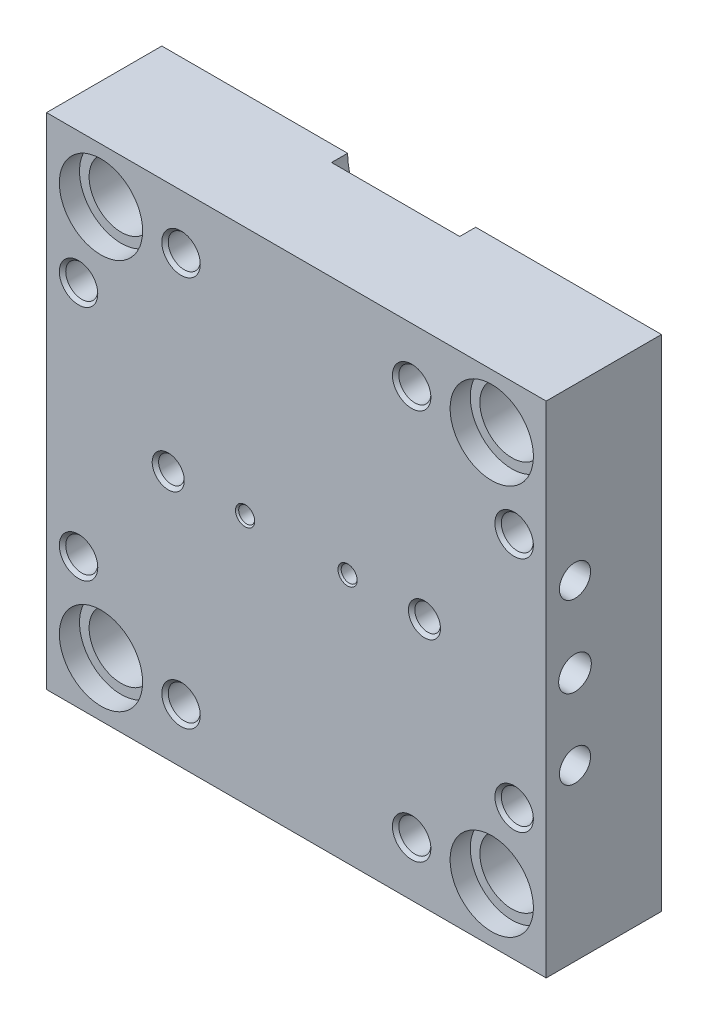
ISO-10303-21;
HEADER;
FILE_DESCRIPTION(('STEP AP214'),'2;1');
FILE_NAME('part.step','',(''),(''),'','','');
FILE_SCHEMA(('AUTOMOTIVE_DESIGN { 1 0 10303 214 1 1 1 1 }'));
ENDSEC;
DATA;
#1=APPLICATION_CONTEXT('core data for automotive mechanical design processes');
#2=APPLICATION_PROTOCOL_DEFINITION('international standard','automotive_design',2000,#1);
#3=PRODUCT_CONTEXT('',#1,'mechanical');
#4=PRODUCT('Part','Part','',(#3));
#5=PRODUCT_RELATED_PRODUCT_CATEGORY('part','',(#4));
#6=PRODUCT_DEFINITION_FORMATION('','',#4);
#7=PRODUCT_DEFINITION_CONTEXT('part definition',#1,'design');
#8=PRODUCT_DEFINITION('design','',#6,#7);
#9=PRODUCT_DEFINITION_SHAPE('','',#8);
#10=(LENGTH_UNIT() NAMED_UNIT(*) SI_UNIT(.MILLI.,.METRE.));
#11=(NAMED_UNIT(*) PLANE_ANGLE_UNIT() SI_UNIT($,.RADIAN.));
#12=(NAMED_UNIT(*) SI_UNIT($,.STERADIAN.) SOLID_ANGLE_UNIT());
#13=UNCERTAINTY_MEASURE_WITH_UNIT(LENGTH_MEASURE(1.E-05),#10,'distance_accuracy_value','');
#14=(GEOMETRIC_REPRESENTATION_CONTEXT(3) GLOBAL_UNCERTAINTY_ASSIGNED_CONTEXT((#13)) GLOBAL_UNIT_ASSIGNED_CONTEXT((#10,
#11,#12)) REPRESENTATION_CONTEXT('',''));
#15=CARTESIAN_POINT('',(0.,0.,0.));
#16=DIRECTION('',(0.,0.,1.));
#17=DIRECTION('',(1.,0.,0.));
#18=AXIS2_PLACEMENT_3D('',#15,#16,#17);
#19=CARTESIAN_POINT('',(-78.,-78.,0.));
#20=DIRECTION('',(0.,0.,1.));
#21=DIRECTION('',(1.,0.,0.));
#22=AXIS2_PLACEMENT_3D('',#19,#20,#21);
#23=PLANE('',#22);
#24=CARTESIAN_POINT('',(61.,-61.,0.));
#25=DIRECTION('',(0.,0.,1.));
#26=DIRECTION('',(-1.,0.,0.));
#27=AXIS2_PLACEMENT_3D('',#24,#25,#26);
#28=CIRCLE('',#27,10.);
#29=CARTESIAN_POINT('',(51.,-61.,0.));
#30=VERTEX_POINT('',#29);
#31=EDGE_CURVE('E298',#30,#30,#28,.T.);
#32=ORIENTED_EDGE('',*,*,#31,.T.);
#33=EDGE_LOOP('',(#32));
#34=FACE_BOUND('',#33,.T.);
#35=CARTESIAN_POINT('',(61.,61.,0.));
#36=DIRECTION('',(0.,0.,-1.));
#37=DIRECTION('',(-1.,0.,0.));
#38=AXIS2_PLACEMENT_3D('',#35,#36,#37);
#39=CIRCLE('',#38,10.);
#40=CARTESIAN_POINT('',(51.,61.,0.));
#41=VERTEX_POINT('',#40);
#42=EDGE_CURVE('E317',#41,#41,#39,.T.);
#43=ORIENTED_EDGE('',*,*,#42,.F.);
#44=EDGE_LOOP('',(#43));
#45=FACE_BOUND('',#44,.T.);
#46=DIRECTION('',(1.,0.,0.));
#47=VECTOR('',#46,1.);
#48=CARTESIAN_POINT('',(-78.,-78.,0.));
#49=LINE('',#48,#47);
#50=CARTESIAN_POINT('',(20.,-78.,0.));
#51=VERTEX_POINT('',#50);
#52=CARTESIAN_POINT('',(78.,-78.,0.));
#53=VERTEX_POINT('',#52);
#54=EDGE_CURVE('E353',#51,#53,#49,.T.);
#55=ORIENTED_EDGE('',*,*,#54,.F.);
#56=CARTESIAN_POINT('',(0.,-78.,0.));
#57=DIRECTION('',(0.,0.,-1.));
#58=DIRECTION('',(-1.,0.,0.));
#59=AXIS2_PLACEMENT_3D('',#56,#57,#58);
#60=CIRCLE('',#59,20.);
#61=CARTESIAN_POINT('',(-20.,-78.,0.));
#62=VERTEX_POINT('',#61);
#63=EDGE_CURVE('E684',#62,#51,#60,.T.);
#64=ORIENTED_EDGE('',*,*,#63,.F.);
#65=CARTESIAN_POINT('',(-78.,-78.,0.));
#66=VERTEX_POINT('',#65);
#67=EDGE_CURVE('E354',#66,#62,#49,.T.);
#68=ORIENTED_EDGE('',*,*,#67,.F.);
#69=DIRECTION('',(0.,-1.,0.));
#70=VECTOR('',#69,1.);
#71=CARTESIAN_POINT('',(-78.,78.,0.));
#72=LINE('',#71,#70);
#73=CARTESIAN_POINT('',(-78.,78.,0.));
#74=VERTEX_POINT('',#73);
#75=EDGE_CURVE('E339',#74,#66,#72,.T.);
#76=ORIENTED_EDGE('',*,*,#75,.F.);
#77=DIRECTION('',(-1.,0.,0.));
#78=VECTOR('',#77,1.);
#79=CARTESIAN_POINT('',(-78.,78.,0.));
#80=LINE('',#79,#78);
#81=CARTESIAN_POINT('',(-20.,78.,0.));
#82=VERTEX_POINT('',#81);
#83=EDGE_CURVE('E359',#82,#74,#80,.T.);
#84=ORIENTED_EDGE('',*,*,#83,.F.);
#85=CARTESIAN_POINT('',(0.,78.,0.));
#86=DIRECTION('',(0.,0.,-1.));
#87=DIRECTION('',(-1.,0.,0.));
#88=AXIS2_PLACEMENT_3D('',#85,#86,#87);
#89=CIRCLE('',#88,20.);
#90=CARTESIAN_POINT('',(20.,78.,0.));
#91=VERTEX_POINT('',#90);
#92=EDGE_CURVE('E703',#91,#82,#89,.T.);
#93=ORIENTED_EDGE('',*,*,#92,.F.);
#94=CARTESIAN_POINT('',(78.,78.,0.));
#95=VERTEX_POINT('',#94);
#96=EDGE_CURVE('E344',#95,#91,#80,.T.);
#97=ORIENTED_EDGE('',*,*,#96,.F.);
#98=DIRECTION('',(0.,1.,0.));
#99=VECTOR('',#98,1.);
#100=CARTESIAN_POINT('',(78.,78.,0.));
#101=LINE('',#100,#99);
#102=EDGE_CURVE('E357',#53,#95,#101,.T.);
#103=ORIENTED_EDGE('',*,*,#102,.F.);
#104=EDGE_LOOP('',(#55,#64,#68,#76,#84,#93,#97,#103));
#105=FACE_BOUND('',#104,.T.);
#106=CARTESIAN_POINT('',(-61.,61.,0.));
#107=DIRECTION('',(0.,0.,1.));
#108=DIRECTION('',(1.,0.,0.));
#109=AXIS2_PLACEMENT_3D('',#106,#107,#108);
#110=CIRCLE('',#109,10.);
#111=CARTESIAN_POINT('',(-51.,61.,0.));
#112=VERTEX_POINT('',#111);
#113=EDGE_CURVE('E336',#112,#112,#110,.T.);
#114=ORIENTED_EDGE('',*,*,#113,.T.);
#115=EDGE_LOOP('',(#114));
#116=FACE_BOUND('',#115,.T.);
#117=CARTESIAN_POINT('',(-61.,-61.,0.));
#118=DIRECTION('',(0.,0.,-1.));
#119=DIRECTION('',(1.,0.,0.));
#120=AXIS2_PLACEMENT_3D('',#117,#118,#119);
#121=CIRCLE('',#120,10.);
#122=CARTESIAN_POINT('',(-51.,-61.,0.));
#123=VERTEX_POINT('',#122);
#124=EDGE_CURVE('E279',#123,#123,#121,.T.);
#125=ORIENTED_EDGE('',*,*,#124,.F.);
#126=EDGE_LOOP('',(#125));
#127=FACE_BOUND('',#126,.T.);
#128=CARTESIAN_POINT('',(68.,37.,0.));
#129=DIRECTION('',(0.,0.,-1.));
#130=DIRECTION('',(-1.,0.,0.));
#131=AXIS2_PLACEMENT_3D('',#128,#129,#130);
#132=CIRCLE('',#131,4.99999999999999);
#133=CARTESIAN_POINT('',(63.,37.,0.));
#134=VERTEX_POINT('',#133);
#135=EDGE_CURVE('E716',#134,#134,#132,.T.);
#136=ORIENTED_EDGE('',*,*,#135,.F.);
#137=EDGE_LOOP('',(#136));
#138=FACE_BOUND('',#137,.T.);
#139=CARTESIAN_POINT('',(-68.,37.,0.));
#140=DIRECTION('',(0.,0.,-1.));
#141=DIRECTION('',(-1.,0.,0.));
#142=AXIS2_PLACEMENT_3D('',#139,#140,#141);
#143=CIRCLE('',#142,4.99999999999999);
#144=CARTESIAN_POINT('',(-73.,37.,0.));
#145=VERTEX_POINT('',#144);
#146=EDGE_CURVE('E722',#145,#145,#143,.T.);
#147=ORIENTED_EDGE('',*,*,#146,.F.);
#148=EDGE_LOOP('',(#147));
#149=FACE_BOUND('',#148,.T.);
#150=CARTESIAN_POINT('',(-68.,-37.,0.));
#151=DIRECTION('',(0.,0.,-1.));
#152=DIRECTION('',(-1.,0.,0.));
#153=AXIS2_PLACEMENT_3D('',#150,#151,#152);
#154=CIRCLE('',#153,4.99999999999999);
#155=CARTESIAN_POINT('',(-73.,-37.,0.));
#156=VERTEX_POINT('',#155);
#157=EDGE_CURVE('E725',#156,#156,#154,.T.);
#158=ORIENTED_EDGE('',*,*,#157,.F.);
#159=EDGE_LOOP('',(#158));
#160=FACE_BOUND('',#159,.T.);
#161=CARTESIAN_POINT('',(68.,-37.,0.));
#162=DIRECTION('',(0.,0.,-1.));
#163=DIRECTION('',(-1.,0.,0.));
#164=AXIS2_PLACEMENT_3D('',#161,#162,#163);
#165=CIRCLE('',#164,4.99999999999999);
#166=CARTESIAN_POINT('',(63.,-37.,0.));
#167=VERTEX_POINT('',#166);
#168=EDGE_CURVE('E728',#167,#167,#165,.T.);
#169=ORIENTED_EDGE('',*,*,#168,.F.);
#170=EDGE_LOOP('',(#169));
#171=FACE_BOUND('',#170,.T.);
#172=DIRECTION('',(-1.,0.,0.));
#173=VECTOR('',#172,1.);
#174=CARTESIAN_POINT('',(32.5669656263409,1.,0.));
#175=LINE('',#174,#173);
#176=CARTESIAN_POINT('',(29.0455488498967,1.,0.));
#177=VERTEX_POINT('',#176);
#178=CARTESIAN_POINT('',(27.2912878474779,1.,0.));
#179=VERTEX_POINT('',#178);
#180=EDGE_CURVE('E218',#177,#179,#175,.T.);
#181=ORIENTED_EDGE('',*,*,#180,.T.);
#182=CARTESIAN_POINT('',(25.,0.,0.));
#183=DIRECTION('',(0.,0.,-1.));
#184=DIRECTION('',(-1.,0.,0.));
#185=AXIS2_PLACEMENT_3D('',#182,#183,#184);
#186=CIRCLE('',#185,2.5);
#187=CARTESIAN_POINT('',(25.,2.5,0.));
#188=VERTEX_POINT('',#187);
#189=EDGE_CURVE('E235',#188,#179,#186,.T.);
#190=ORIENTED_EDGE('',*,*,#189,.F.);
#191=DIRECTION('',(1.,0.,0.));
#192=VECTOR('',#191,1.);
#193=CARTESIAN_POINT('',(25.,2.5,0.));
#194=LINE('',#193,#192);
#195=CARTESIAN_POINT('',(-25.,2.5,0.));
#196=VERTEX_POINT('',#195);
#197=EDGE_CURVE('E251',#196,#188,#194,.T.);
#198=ORIENTED_EDGE('',*,*,#197,.F.);
#199=CARTESIAN_POINT('',(-25.,0.,0.));
#200=DIRECTION('',(0.,0.,-1.));
#201=DIRECTION('',(1.,0.,0.));
#202=AXIS2_PLACEMENT_3D('',#199,#200,#201);
#203=CIRCLE('',#202,2.5);
#204=CARTESIAN_POINT('',(-27.2912878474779,1.,0.));
#205=VERTEX_POINT('',#204);
#206=EDGE_CURVE('E247',#205,#196,#203,.T.);
#207=ORIENTED_EDGE('',*,*,#206,.F.);
#208=DIRECTION('',(1.,0.,0.));
#209=VECTOR('',#208,1.);
#210=CARTESIAN_POINT('',(-32.5669656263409,1.,0.));
#211=LINE('',#210,#209);
#212=CARTESIAN_POINT('',(-29.0455488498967,1.,0.));
#213=VERTEX_POINT('',#212);
#214=EDGE_CURVE('E587',#213,#205,#211,.T.);
#215=ORIENTED_EDGE('',*,*,#214,.F.);
#216=CARTESIAN_POINT('',(-40.,0.,0.));
#217=DIRECTION('',(0.,0.,-1.));
#218=DIRECTION('',(-1.,0.,0.));
#219=AXIS2_PLACEMENT_3D('',#216,#217,#218);
#220=CIRCLE('',#219,11.);
#221=CARTESIAN_POINT('',(-29.0455488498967,-1.,0.));
#222=VERTEX_POINT('',#221);
#223=EDGE_CURVE('E566',#222,#213,#220,.T.);
#224=ORIENTED_EDGE('',*,*,#223,.F.);
#225=DIRECTION('',(-1.,0.,0.));
#226=VECTOR('',#225,1.);
#227=CARTESIAN_POINT('',(-32.5669656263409,-1.,0.));
#228=LINE('',#227,#226);
#229=CARTESIAN_POINT('',(-27.2912878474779,-1.,0.));
#230=VERTEX_POINT('',#229);
#231=EDGE_CURVE('E594',#230,#222,#228,.T.);
#232=ORIENTED_EDGE('',*,*,#231,.F.);
#233=CARTESIAN_POINT('',(-25.,-2.5,0.));
#234=VERTEX_POINT('',#233);
#235=EDGE_CURVE('E248',#234,#230,#203,.T.);
#236=ORIENTED_EDGE('',*,*,#235,.F.);
#237=DIRECTION('',(-1.,0.,0.));
#238=VECTOR('',#237,1.);
#239=CARTESIAN_POINT('',(25.,-2.5,0.));
#240=LINE('',#239,#238);
#241=CARTESIAN_POINT('',(25.,-2.5,0.));
#242=VERTEX_POINT('',#241);
#243=EDGE_CURVE('E234',#242,#234,#240,.T.);
#244=ORIENTED_EDGE('',*,*,#243,.F.);
#245=CARTESIAN_POINT('',(27.2912878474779,-1.,0.));
#246=VERTEX_POINT('',#245);
#247=EDGE_CURVE('E225',#246,#242,#186,.T.);
#248=ORIENTED_EDGE('',*,*,#247,.F.);
#249=DIRECTION('',(1.,0.,0.));
#250=VECTOR('',#249,1.);
#251=CARTESIAN_POINT('',(32.5669656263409,-1.,0.));
#252=LINE('',#251,#250);
#253=CARTESIAN_POINT('',(29.0455488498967,-1.,0.));
#254=VERTEX_POINT('',#253);
#255=EDGE_CURVE('E207',#246,#254,#252,.T.);
#256=ORIENTED_EDGE('',*,*,#255,.T.);
#257=CARTESIAN_POINT('',(40.,0.,0.));
#258=DIRECTION('',(0.,0.,1.));
#259=DIRECTION('',(1.,0.,0.));
#260=AXIS2_PLACEMENT_3D('',#257,#258,#259);
#261=CIRCLE('',#260,11.);
#262=EDGE_CURVE('E579',#254,#177,#261,.T.);
#263=ORIENTED_EDGE('',*,*,#262,.T.);
#264=EDGE_LOOP('',(#181,#190,#198,#207,#215,#224,#232,#236,#244,#248,#256,#263));
#265=FACE_BOUND('',#264,.T.);
#266=ADVANCED_FACE('F38',(#34,#45,#105,#116,#127,#138,#149,#160,#171,#265),#23,.F.);
#267=CARTESIAN_POINT('',(25.,0.,4.));
#268=DIRECTION('',(0.,0.,-1.));
#269=DIRECTION('',(-1.,0.,0.));
#270=AXIS2_PLACEMENT_3D('',#267,#268,#269);
#271=CYLINDRICAL_SURFACE('',#270,2.5);
#272=DIRECTION('',(0.,0.,-1.));
#273=VECTOR('',#272,1.);
#274=CARTESIAN_POINT('',(27.2912878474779,1.,4.));
#275=LINE('',#274,#273);
#276=CARTESIAN_POINT('',(27.2912878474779,1.,0.5));
#277=VERTEX_POINT('',#276);
#278=EDGE_CURVE('E228',#277,#179,#275,.T.);
#279=ORIENTED_EDGE('',*,*,#278,.F.);
#280=CARTESIAN_POINT('',(25.,0.,0.5));
#281=DIRECTION('',(0.,0.,-1.));
#282=DIRECTION('',(-1.,0.,0.));
#283=AXIS2_PLACEMENT_3D('',#280,#281,#282);
#284=CIRCLE('',#283,2.5);
#285=CARTESIAN_POINT('',(27.2912878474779,-1.,0.5));
#286=VERTEX_POINT('',#285);
#287=EDGE_CURVE('E227',#286,#277,#284,.F.);
#288=ORIENTED_EDGE('',*,*,#287,.F.);
#289=DIRECTION('',(0.,0.,-1.));
#290=VECTOR('',#289,1.);
#291=CARTESIAN_POINT('',(27.2912878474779,-1.,4.));
#292=LINE('',#291,#290);
#293=EDGE_CURVE('E211',#246,#286,#292,.F.);
#294=ORIENTED_EDGE('',*,*,#293,.F.);
#295=ORIENTED_EDGE('',*,*,#247,.T.);
#296=DIRECTION('',(0.,0.,-1.));
#297=VECTOR('',#296,1.);
#298=CARTESIAN_POINT('',(25.,-2.5,4.));
#299=LINE('',#298,#297);
#300=CARTESIAN_POINT('',(25.,-2.5,1.5));
#301=VERTEX_POINT('',#300);
#302=EDGE_CURVE('E254',#301,#242,#299,.T.);
#303=ORIENTED_EDGE('',*,*,#302,.F.);
#304=CARTESIAN_POINT('',(25.,0.,1.5));
#305=DIRECTION('',(0.,0.,-1.));
#306=DIRECTION('',(-1.,0.,0.));
#307=AXIS2_PLACEMENT_3D('',#304,#305,#306);
#308=CIRCLE('',#307,2.5);
#309=CARTESIAN_POINT('',(25.,2.5,1.5));
#310=VERTEX_POINT('',#309);
#311=EDGE_CURVE('E388',#301,#310,#308,.F.);
#312=ORIENTED_EDGE('',*,*,#311,.T.);
#313=DIRECTION('',(0.,0.,-1.));
#314=VECTOR('',#313,1.);
#315=CARTESIAN_POINT('',(25.,2.5,4.));
#316=LINE('',#315,#314);
#317=EDGE_CURVE('E255',#310,#188,#316,.T.);
#318=ORIENTED_EDGE('',*,*,#317,.T.);
#319=ORIENTED_EDGE('',*,*,#189,.T.);
#320=EDGE_LOOP('',(#279,#288,#294,#295,#303,#312,#318,#319));
#321=FACE_BOUND('',#320,.T.);
#322=ADVANCED_FACE('F223',(#321),#271,.F.);
#323=CARTESIAN_POINT('',(40.,0.,2.));
#324=DIRECTION('',(0.,0.,-1.));
#325=DIRECTION('',(-1.,0.,0.));
#326=AXIS2_PLACEMENT_3D('',#323,#324,#325);
#327=CYLINDRICAL_SURFACE('',#326,11.);
#328=CARTESIAN_POINT('',(40.,0.,2.));
#329=DIRECTION('',(0.,0.,1.));
#330=DIRECTION('',(1.,0.,0.));
#331=AXIS2_PLACEMENT_3D('',#328,#329,#330);
#332=CIRCLE('',#331,11.);
#333=CARTESIAN_POINT('',(51.,0.,2.));
#334=VERTEX_POINT('',#333);
#335=EDGE_CURVE('E584',#334,#334,#332,.T.);
#336=ORIENTED_EDGE('',*,*,#335,.T.);
#337=EDGE_LOOP('',(#336));
#338=FACE_BOUND('',#337,.T.);
#339=CARTESIAN_POINT('',(40.,0.,0.5));
#340=DIRECTION('',(0.,0.,-1.));
#341=DIRECTION('',(-1.,0.,0.));
#342=AXIS2_PLACEMENT_3D('',#339,#340,#341);
#343=CIRCLE('',#342,11.);
#344=CARTESIAN_POINT('',(29.0455488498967,-1.,0.5));
#345=VERTEX_POINT('',#344);
#346=CARTESIAN_POINT('',(29.0455488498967,1.,0.5));
#347=VERTEX_POINT('',#346);
#348=EDGE_CURVE('E575',#345,#347,#343,.T.);
#349=ORIENTED_EDGE('',*,*,#348,.T.);
#350=DIRECTION('',(0.,0.,-1.));
#351=VECTOR('',#350,1.);
#352=CARTESIAN_POINT('',(29.0455488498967,1.,2.));
#353=LINE('',#352,#351);
#354=EDGE_CURVE('E11',#347,#177,#353,.T.);
#355=ORIENTED_EDGE('',*,*,#354,.T.);
#356=ORIENTED_EDGE('',*,*,#262,.F.);
#357=DIRECTION('',(0.,0.,-1.));
#358=VECTOR('',#357,1.);
#359=CARTESIAN_POINT('',(29.0455488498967,-1.,2.));
#360=LINE('',#359,#358);
#361=EDGE_CURVE('E46',#254,#345,#360,.F.);
#362=ORIENTED_EDGE('',*,*,#361,.T.);
#363=EDGE_LOOP('',(#349,#355,#356,#362));
#364=FACE_BOUND('',#363,.T.);
#365=ADVANCED_FACE('F583',(#338,#364),#327,.F.);
#366=CARTESIAN_POINT('',(40.,0.,36.));
#367=DIRECTION('',(0.,0.,-1.));
#368=DIRECTION('',(-1.,0.,0.));
#369=AXIS2_PLACEMENT_3D('',#366,#367,#368);
#370=CYLINDRICAL_SURFACE('',#369,4.00000000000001);
#371=CARTESIAN_POINT('',(40.,0.,35.));
#372=DIRECTION('',(0.,0.,1.));
#373=DIRECTION('',(1.,0.,0.));
#374=AXIS2_PLACEMENT_3D('',#371,#372,#373);
#375=CIRCLE('',#374,4.00000000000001);
#376=CARTESIAN_POINT('',(44.,0.,35.));
#377=VERTEX_POINT('',#376);
#378=EDGE_CURVE('E545',#377,#377,#375,.T.);
#379=ORIENTED_EDGE('',*,*,#378,.T.);
#380=EDGE_LOOP('',(#379));
#381=FACE_BOUND('',#380,.T.);
#382=CARTESIAN_POINT('',(40.,0.,2.5));
#383=DIRECTION('',(0.,0.,-1.));
#384=DIRECTION('',(-1.,0.,0.));
#385=AXIS2_PLACEMENT_3D('',#382,#383,#384);
#386=CIRCLE('',#385,4.00000000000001);
#387=CARTESIAN_POINT('',(36.,0.,2.5));
#388=VERTEX_POINT('',#387);
#389=EDGE_CURVE('E576',#388,#388,#386,.F.);
#390=ORIENTED_EDGE('',*,*,#389,.F.);
#391=EDGE_LOOP('',(#390));
#392=FACE_BOUND('',#391,.T.);
#393=ADVANCED_FACE('F890',(#381,#392),#370,.F.);
#394=CARTESIAN_POINT('',(-40.,0.,36.));
#395=DIRECTION('',(0.,0.,-1.));
#396=DIRECTION('',(-1.,0.,0.));
#397=AXIS2_PLACEMENT_3D('',#394,#395,#396);
#398=CYLINDRICAL_SURFACE('',#397,4.00000000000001);
#399=CARTESIAN_POINT('',(-40.,0.,35.));
#400=DIRECTION('',(0.,0.,1.));
#401=DIRECTION('',(1.,0.,0.));
#402=AXIS2_PLACEMENT_3D('',#399,#400,#401);
#403=CIRCLE('',#402,4.00000000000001);
#404=CARTESIAN_POINT('',(-36.,0.,35.));
#405=VERTEX_POINT('',#404);
#406=EDGE_CURVE('E542',#405,#405,#403,.T.);
#407=ORIENTED_EDGE('',*,*,#406,.T.);
#408=EDGE_LOOP('',(#407));
#409=FACE_BOUND('',#408,.T.);
#410=CARTESIAN_POINT('',(-40.,0.,2.5));
#411=DIRECTION('',(0.,0.,-1.));
#412=DIRECTION('',(-1.,0.,0.));
#413=AXIS2_PLACEMENT_3D('',#410,#411,#412);
#414=CIRCLE('',#413,4.00000000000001);
#415=CARTESIAN_POINT('',(-44.,0.,2.5));
#416=VERTEX_POINT('',#415);
#417=EDGE_CURVE('E563',#416,#416,#414,.F.);
#418=ORIENTED_EDGE('',*,*,#417,.F.);
#419=EDGE_LOOP('',(#418));
#420=FACE_BOUND('',#419,.T.);
#421=ADVANCED_FACE('F871',(#409,#420),#398,.F.);
#422=CARTESIAN_POINT('',(-16.,0.,36.));
#423=DIRECTION('',(0.,0.,-1.));
#424=DIRECTION('',(-1.,0.,0.));
#425=AXIS2_PLACEMENT_3D('',#422,#423,#424);
#426=CYLINDRICAL_SURFACE('',#425,2.);
#427=CARTESIAN_POINT('',(-16.,0.,6.5));
#428=DIRECTION('',(0.,0.,1.));
#429=DIRECTION('',(1.,0.,0.));
#430=AXIS2_PLACEMENT_3D('',#427,#428,#429);
#431=CIRCLE('',#430,2.);
#432=CARTESIAN_POINT('',(-14.,0.,6.5));
#433=VERTEX_POINT('',#432);
#434=EDGE_CURVE('E412',#433,#433,#431,.F.);
#435=ORIENTED_EDGE('',*,*,#434,.T.);
#436=EDGE_LOOP('',(#435));
#437=FACE_BOUND('',#436,.T.);
#438=CARTESIAN_POINT('',(-16.,0.,16.));
#439=DIRECTION('',(0.,0.,1.));
#440=DIRECTION('',(1.,0.,0.));
#441=AXIS2_PLACEMENT_3D('',#438,#439,#440);
#442=CIRCLE('',#441,2.);
#443=CARTESIAN_POINT('',(-14.,0.,16.));
#444=VERTEX_POINT('',#443);
#445=EDGE_CURVE('E559',#444,#444,#442,.F.);
#446=ORIENTED_EDGE('',*,*,#445,.F.);
#447=EDGE_LOOP('',(#446));
#448=FACE_BOUND('',#447,.T.);
#449=ADVANCED_FACE('F867',(#437,#448),#426,.F.);
#450=CARTESIAN_POINT('',(16.,0.,36.));
#451=DIRECTION('',(0.,0.,-1.));
#452=DIRECTION('',(-1.,0.,0.));
#453=AXIS2_PLACEMENT_3D('',#450,#451,#452);
#454=CYLINDRICAL_SURFACE('',#453,2.);
#455=CARTESIAN_POINT('',(16.,0.,6.5));
#456=DIRECTION('',(0.,0.,1.));
#457=DIRECTION('',(1.,0.,0.));
#458=AXIS2_PLACEMENT_3D('',#455,#456,#457);
#459=CIRCLE('',#458,2.);
#460=CARTESIAN_POINT('',(18.,0.,6.5));
#461=VERTEX_POINT('',#460);
#462=EDGE_CURVE('E424',#461,#461,#459,.F.);
#463=ORIENTED_EDGE('',*,*,#462,.T.);
#464=EDGE_LOOP('',(#463));
#465=FACE_BOUND('',#464,.T.);
#466=CARTESIAN_POINT('',(16.,0.,16.));
#467=DIRECTION('',(0.,0.,1.));
#468=DIRECTION('',(1.,0.,0.));
#469=AXIS2_PLACEMENT_3D('',#466,#467,#468);
#470=CIRCLE('',#469,2.);
#471=CARTESIAN_POINT('',(18.,0.,16.));
#472=VERTEX_POINT('',#471);
#473=EDGE_CURVE('E552',#472,#472,#470,.F.);
#474=ORIENTED_EDGE('',*,*,#473,.F.);
#475=EDGE_LOOP('',(#474));
#476=FACE_BOUND('',#475,.T.);
#477=ADVANCED_FACE('F870',(#465,#476),#454,.F.);
#478=CARTESIAN_POINT('',(-78.,-78.,36.));
#479=DIRECTION('',(0.,0.,1.));
#480=DIRECTION('',(1.,0.,0.));
#481=AXIS2_PLACEMENT_3D('',#478,#479,#480);
#482=PLANE('',#481);
#483=CARTESIAN_POINT('',(68.,-37.,36.));
#484=DIRECTION('',(0.,0.,1.));
#485=DIRECTION('',(1.,0.,0.));
#486=AXIS2_PLACEMENT_3D('',#483,#484,#485);
#487=CIRCLE('',#486,6.00000000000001);
#488=CARTESIAN_POINT('',(74.,-37.,36.));
#489=VERTEX_POINT('',#488);
#490=EDGE_CURVE('E515',#489,#489,#487,.F.);
#491=ORIENTED_EDGE('',*,*,#490,.T.);
#492=EDGE_LOOP('',(#491));
#493=FACE_BOUND('',#492,.T.);
#494=CARTESIAN_POINT('',(-68.,-37.,36.));
#495=DIRECTION('',(0.,0.,1.));
#496=DIRECTION('',(1.,0.,0.));
#497=AXIS2_PLACEMENT_3D('',#494,#495,#496);
#498=CIRCLE('',#497,6.00000000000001);
#499=CARTESIAN_POINT('',(-62.,-37.,36.));
#500=VERTEX_POINT('',#499);
#501=EDGE_CURVE('E512',#500,#500,#498,.F.);
#502=ORIENTED_EDGE('',*,*,#501,.T.);
#503=EDGE_LOOP('',(#502));
#504=FACE_BOUND('',#503,.T.);
#505=CARTESIAN_POINT('',(-68.,37.,36.));
#506=DIRECTION('',(0.,0.,1.));
#507=DIRECTION('',(1.,0.,0.));
#508=AXIS2_PLACEMENT_3D('',#505,#506,#507);
#509=CIRCLE('',#508,6.00000000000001);
#510=CARTESIAN_POINT('',(-62.,37.,36.));
#511=VERTEX_POINT('',#510);
#512=EDGE_CURVE('E509',#511,#511,#509,.F.);
#513=ORIENTED_EDGE('',*,*,#512,.T.);
#514=EDGE_LOOP('',(#513));
#515=FACE_BOUND('',#514,.T.);
#516=CARTESIAN_POINT('',(68.,37.,36.));
#517=DIRECTION('',(0.,0.,1.));
#518=DIRECTION('',(1.,0.,0.));
#519=AXIS2_PLACEMENT_3D('',#516,#517,#518);
#520=CIRCLE('',#519,6.00000000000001);
#521=CARTESIAN_POINT('',(74.,37.,36.));
#522=VERTEX_POINT('',#521);
#523=EDGE_CURVE('E506',#522,#522,#520,.F.);
#524=ORIENTED_EDGE('',*,*,#523,.T.);
#525=EDGE_LOOP('',(#524));
#526=FACE_BOUND('',#525,.T.);
#527=CARTESIAN_POINT('',(-36.,-61.,36.));
#528=DIRECTION('',(0.,0.,1.));
#529=DIRECTION('',(1.,0.,0.));
#530=AXIS2_PLACEMENT_3D('',#527,#528,#529);
#531=CIRCLE('',#530,6.00000000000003);
#532=CARTESIAN_POINT('',(-30.,-61.,36.));
#533=VERTEX_POINT('',#532);
#534=EDGE_CURVE('E503',#533,#533,#531,.F.);
#535=ORIENTED_EDGE('',*,*,#534,.T.);
#536=EDGE_LOOP('',(#535));
#537=FACE_BOUND('',#536,.T.);
#538=CARTESIAN_POINT('',(36.,-61.,36.));
#539=DIRECTION('',(0.,0.,1.));
#540=DIRECTION('',(1.,0.,0.));
#541=AXIS2_PLACEMENT_3D('',#538,#539,#540);
#542=CIRCLE('',#541,6.00000000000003);
#543=CARTESIAN_POINT('',(42.,-61.,36.));
#544=VERTEX_POINT('',#543);
#545=EDGE_CURVE('E500',#544,#544,#542,.F.);
#546=ORIENTED_EDGE('',*,*,#545,.T.);
#547=EDGE_LOOP('',(#546));
#548=FACE_BOUND('',#547,.T.);
#549=CARTESIAN_POINT('',(-36.,61.,36.));
#550=DIRECTION('',(0.,0.,1.));
#551=DIRECTION('',(1.,0.,0.));
#552=AXIS2_PLACEMENT_3D('',#549,#550,#551);
#553=CIRCLE('',#552,6.00000000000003);
#554=CARTESIAN_POINT('',(-30.,61.,36.));
#555=VERTEX_POINT('',#554);
#556=EDGE_CURVE('E497',#555,#555,#553,.F.);
#557=ORIENTED_EDGE('',*,*,#556,.T.);
#558=EDGE_LOOP('',(#557));
#559=FACE_BOUND('',#558,.T.);
#560=CARTESIAN_POINT('',(36.,61.,36.));
#561=DIRECTION('',(0.,0.,1.));
#562=DIRECTION('',(1.,0.,0.));
#563=AXIS2_PLACEMENT_3D('',#560,#561,#562);
#564=CIRCLE('',#563,6.00000000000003);
#565=CARTESIAN_POINT('',(42.,61.,36.));
#566=VERTEX_POINT('',#565);
#567=EDGE_CURVE('E494',#566,#566,#564,.F.);
#568=ORIENTED_EDGE('',*,*,#567,.T.);
#569=EDGE_LOOP('',(#568));
#570=FACE_BOUND('',#569,.T.);
#571=CARTESIAN_POINT('',(-16.,0.,36.));
#572=DIRECTION('',(0.,0.,1.));
#573=DIRECTION('',(1.,0.,0.));
#574=AXIS2_PLACEMENT_3D('',#571,#572,#573);
#575=CIRCLE('',#574,2.99999999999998);
#576=CARTESIAN_POINT('',(-13.,0.,36.));
#577=VERTEX_POINT('',#576);
#578=EDGE_CURVE('E491',#577,#577,#575,.F.);
#579=ORIENTED_EDGE('',*,*,#578,.T.);
#580=EDGE_LOOP('',(#579));
#581=FACE_BOUND('',#580,.T.);
#582=CARTESIAN_POINT('',(16.,0.,36.));
#583=DIRECTION('',(0.,0.,1.));
#584=DIRECTION('',(1.,0.,0.));
#585=AXIS2_PLACEMENT_3D('',#582,#583,#584);
#586=CIRCLE('',#585,2.99999999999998);
#587=CARTESIAN_POINT('',(19.,0.,36.));
#588=VERTEX_POINT('',#587);
#589=EDGE_CURVE('E488',#588,#588,#586,.F.);
#590=ORIENTED_EDGE('',*,*,#589,.T.);
#591=EDGE_LOOP('',(#590));
#592=FACE_BOUND('',#591,.T.);
#593=CARTESIAN_POINT('',(-40.,0.,36.));
#594=DIRECTION('',(0.,0.,1.));
#595=DIRECTION('',(1.,0.,0.));
#596=AXIS2_PLACEMENT_3D('',#593,#594,#595);
#597=CIRCLE('',#596,4.99999999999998);
#598=CARTESIAN_POINT('',(-35.,0.,36.));
#599=VERTEX_POINT('',#598);
#600=EDGE_CURVE('E485',#599,#599,#597,.F.);
#601=ORIENTED_EDGE('',*,*,#600,.T.);
#602=EDGE_LOOP('',(#601));
#603=FACE_BOUND('',#602,.T.);
#604=CARTESIAN_POINT('',(40.,0.,36.));
#605=DIRECTION('',(0.,0.,1.));
#606=DIRECTION('',(1.,0.,0.));
#607=AXIS2_PLACEMENT_3D('',#604,#605,#606);
#608=CIRCLE('',#607,4.99999999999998);
#609=CARTESIAN_POINT('',(45.,0.,36.));
#610=VERTEX_POINT('',#609);
#611=EDGE_CURVE('E482',#610,#610,#608,.F.);
#612=ORIENTED_EDGE('',*,*,#611,.T.);
#613=EDGE_LOOP('',(#612));
#614=FACE_BOUND('',#613,.T.);
#615=DIRECTION('',(0.,-1.,0.));
#616=VECTOR('',#615,1.);
#617=CARTESIAN_POINT('',(-78.,78.,36.));
#618=LINE('',#617,#616);
#619=CARTESIAN_POINT('',(-78.,78.,36.));
#620=VERTEX_POINT('',#619);
#621=CARTESIAN_POINT('',(-78.,-78.,36.));
#622=VERTEX_POINT('',#621);
#623=EDGE_CURVE('E340',#620,#622,#618,.T.);
#624=ORIENTED_EDGE('',*,*,#623,.T.);
#625=DIRECTION('',(1.,0.,0.));
#626=VECTOR('',#625,1.);
#627=CARTESIAN_POINT('',(-78.,-78.,36.));
#628=LINE('',#627,#626);
#629=CARTESIAN_POINT('',(78.,-78.,36.));
#630=VERTEX_POINT('',#629);
#631=EDGE_CURVE('E343',#622,#630,#628,.T.);
#632=ORIENTED_EDGE('',*,*,#631,.T.);
#633=DIRECTION('',(0.,1.,0.));
#634=VECTOR('',#633,1.);
#635=CARTESIAN_POINT('',(78.,78.,36.));
#636=LINE('',#635,#634);
#637=CARTESIAN_POINT('',(78.,78.,36.));
#638=VERTEX_POINT('',#637);
#639=EDGE_CURVE('E346',#630,#638,#636,.T.);
#640=ORIENTED_EDGE('',*,*,#639,.T.);
#641=DIRECTION('',(-1.,0.,0.));
#642=VECTOR('',#641,1.);
#643=CARTESIAN_POINT('',(-78.,78.,36.));
#644=LINE('',#643,#642);
#645=EDGE_CURVE('E348',#638,#620,#644,.T.);
#646=ORIENTED_EDGE('',*,*,#645,.T.);
#647=EDGE_LOOP('',(#624,#632,#640,#646));
#648=FACE_BOUND('',#647,.T.);
#649=CARTESIAN_POINT('',(-61.,61.,36.));
#650=DIRECTION('',(0.,0.,1.));
#651=DIRECTION('',(1.,0.,0.));
#652=AXIS2_PLACEMENT_3D('',#649,#650,#651);
#653=CIRCLE('',#652,13.);
#654=CARTESIAN_POINT('',(-48.,61.,36.));
#655=VERTEX_POINT('',#654);
#656=EDGE_CURVE('E329',#655,#655,#653,.T.);
#657=ORIENTED_EDGE('',*,*,#656,.F.);
#658=EDGE_LOOP('',(#657));
#659=FACE_BOUND('',#658,.T.);
#660=CARTESIAN_POINT('',(61.,61.,36.));
#661=DIRECTION('',(0.,0.,-1.));
#662=DIRECTION('',(-1.,0.,0.));
#663=AXIS2_PLACEMENT_3D('',#660,#661,#662);
#664=CIRCLE('',#663,13.);
#665=CARTESIAN_POINT('',(48.,61.,36.));
#666=VERTEX_POINT('',#665);
#667=EDGE_CURVE('E310',#666,#666,#664,.T.);
#668=ORIENTED_EDGE('',*,*,#667,.T.);
#669=EDGE_LOOP('',(#668));
#670=FACE_BOUND('',#669,.T.);
#671=CARTESIAN_POINT('',(61.,-61.,36.));
#672=DIRECTION('',(0.,0.,1.));
#673=DIRECTION('',(-1.,0.,0.));
#674=AXIS2_PLACEMENT_3D('',#671,#672,#673);
#675=CIRCLE('',#674,13.);
#676=CARTESIAN_POINT('',(48.,-61.,36.));
#677=VERTEX_POINT('',#676);
#678=EDGE_CURVE('E291',#677,#677,#675,.T.);
#679=ORIENTED_EDGE('',*,*,#678,.F.);
#680=EDGE_LOOP('',(#679));
#681=FACE_BOUND('',#680,.T.);
#682=CARTESIAN_POINT('',(-61.,-61.,36.));
#683=DIRECTION('',(0.,0.,-1.));
#684=DIRECTION('',(1.,0.,0.));
#685=AXIS2_PLACEMENT_3D('',#682,#683,#684);
#686=CIRCLE('',#685,13.);
#687=CARTESIAN_POINT('',(-48.,-61.,36.));
#688=VERTEX_POINT('',#687);
#689=EDGE_CURVE('E272',#688,#688,#686,.T.);
#690=ORIENTED_EDGE('',*,*,#689,.T.);
#691=EDGE_LOOP('',(#690));
#692=FACE_BOUND('',#691,.T.);
#693=ADVANCED_FACE('F643',(#493,#504,#515,#526,#537,#548,#559,#570,#581,#592,#603,#614,#648,
#659,#670,#681,#692),#482,.T.);
#694=CARTESIAN_POINT('',(-61.,-61.,36.));
#695=DIRECTION('',(0.,0.,-1.));
#696=DIRECTION('',(-1.,0.,0.));
#697=AXIS2_PLACEMENT_3D('',#694,#695,#696);
#698=CYLINDRICAL_SURFACE('',#697,10.);
#699=ORIENTED_EDGE('',*,*,#124,.T.);
#700=EDGE_LOOP('',(#699));
#701=FACE_BOUND('',#700,.T.);
#702=CARTESIAN_POINT('',(-61.,-61.,29.7));
#703=DIRECTION('',(0.,0.,1.));
#704=DIRECTION('',(1.,0.,0.));
#705=AXIS2_PLACEMENT_3D('',#702,#703,#704);
#706=CIRCLE('',#705,10.);
#707=CARTESIAN_POINT('',(-51.,-61.,29.7));
#708=VERTEX_POINT('',#707);
#709=EDGE_CURVE('E276',#708,#708,#706,.F.);
#710=ORIENTED_EDGE('',*,*,#709,.F.);
#711=EDGE_LOOP('',(#710));
#712=FACE_BOUND('',#711,.T.);
#713=ADVANCED_FACE('F948',(#701,#712),#698,.F.);
#714=CARTESIAN_POINT('',(61.,-61.,36.));
#715=DIRECTION('',(0.,0.,-1.));
#716=DIRECTION('',(-1.,0.,0.));
#717=AXIS2_PLACEMENT_3D('',#714,#715,#716);
#718=CYLINDRICAL_SURFACE('',#717,10.);
#719=ORIENTED_EDGE('',*,*,#31,.F.);
#720=EDGE_LOOP('',(#719));
#721=FACE_BOUND('',#720,.T.);
#722=CARTESIAN_POINT('',(61.,-61.,29.7));
#723=DIRECTION('',(0.,0.,1.));
#724=DIRECTION('',(1.,0.,0.));
#725=AXIS2_PLACEMENT_3D('',#722,#723,#724);
#726=CIRCLE('',#725,10.);
#727=CARTESIAN_POINT('',(71.,-61.,29.7));
#728=VERTEX_POINT('',#727);
#729=EDGE_CURVE('E295',#728,#728,#726,.T.);
#730=ORIENTED_EDGE('',*,*,#729,.T.);
#731=EDGE_LOOP('',(#730));
#732=FACE_BOUND('',#731,.T.);
#733=ADVANCED_FACE('F951',(#721,#732),#718,.F.);
#734=CARTESIAN_POINT('',(61.,61.,36.));
#735=DIRECTION('',(0.,0.,-1.));
#736=DIRECTION('',(-1.,0.,0.));
#737=AXIS2_PLACEMENT_3D('',#734,#735,#736);
#738=CYLINDRICAL_SURFACE('',#737,10.);
#739=ORIENTED_EDGE('',*,*,#42,.T.);
#740=EDGE_LOOP('',(#739));
#741=FACE_BOUND('',#740,.T.);
#742=CARTESIAN_POINT('',(61.,61.,29.7));
#743=DIRECTION('',(0.,0.,1.));
#744=DIRECTION('',(1.,0.,0.));
#745=AXIS2_PLACEMENT_3D('',#742,#743,#744);
#746=CIRCLE('',#745,10.);
#747=CARTESIAN_POINT('',(71.,61.,29.7));
#748=VERTEX_POINT('',#747);
#749=EDGE_CURVE('E314',#748,#748,#746,.F.);
#750=ORIENTED_EDGE('',*,*,#749,.F.);
#751=EDGE_LOOP('',(#750));
#752=FACE_BOUND('',#751,.T.);
#753=ADVANCED_FACE('F664',(#741,#752),#738,.F.);
#754=CARTESIAN_POINT('',(-61.,61.,36.));
#755=DIRECTION('',(0.,0.,-1.));
#756=DIRECTION('',(-1.,0.,0.));
#757=AXIS2_PLACEMENT_3D('',#754,#755,#756);
#758=CYLINDRICAL_SURFACE('',#757,10.);
#759=ORIENTED_EDGE('',*,*,#113,.F.);
#760=EDGE_LOOP('',(#759));
#761=FACE_BOUND('',#760,.T.);
#762=CARTESIAN_POINT('',(-61.,61.,29.7));
#763=DIRECTION('',(0.,0.,1.));
#764=DIRECTION('',(1.,0.,0.));
#765=AXIS2_PLACEMENT_3D('',#762,#763,#764);
#766=CIRCLE('',#765,10.);
#767=CARTESIAN_POINT('',(-51.,61.,29.7));
#768=VERTEX_POINT('',#767);
#769=EDGE_CURVE('E333',#768,#768,#766,.T.);
#770=ORIENTED_EDGE('',*,*,#769,.T.);
#771=EDGE_LOOP('',(#770));
#772=FACE_BOUND('',#771,.T.);
#773=ADVANCED_FACE('F659',(#761,#772),#758,.F.);
#774=CARTESIAN_POINT('',(-78.,78.,36.));
#775=DIRECTION('',(1.,0.,0.));
#776=DIRECTION('',(0.,1.,0.));
#777=AXIS2_PLACEMENT_3D('',#774,#775,#776);
#778=PLANE('',#777);
#779=CARTESIAN_POINT('',(-78.,25.,27.));
#780=DIRECTION('',(-1.,0.,0.));
#781=DIRECTION('',(0.,0.,1.));
#782=AXIS2_PLACEMENT_3D('',#779,#780,#781);
#783=CIRCLE('',#782,4.864);
#784=CARTESIAN_POINT('',(-78.,25.,31.864));
#785=VERTEX_POINT('',#784);
#786=EDGE_CURVE('E669',#785,#785,#783,.T.);
#787=ORIENTED_EDGE('',*,*,#786,.F.);
#788=EDGE_LOOP('',(#787));
#789=FACE_BOUND('',#788,.T.);
#790=CARTESIAN_POINT('',(-78.,-25.,27.));
#791=DIRECTION('',(-1.,0.,0.));
#792=DIRECTION('',(0.,0.,1.));
#793=AXIS2_PLACEMENT_3D('',#790,#791,#792);
#794=CIRCLE('',#793,4.864);
#795=CARTESIAN_POINT('',(-78.,-25.,31.864));
#796=VERTEX_POINT('',#795);
#797=EDGE_CURVE('E673',#796,#796,#794,.T.);
#798=ORIENTED_EDGE('',*,*,#797,.F.);
#799=EDGE_LOOP('',(#798));
#800=FACE_BOUND('',#799,.T.);
#801=ORIENTED_EDGE('',*,*,#75,.T.);
#802=DIRECTION('',(0.,0.,-1.));
#803=VECTOR('',#802,1.);
#804=CARTESIAN_POINT('',(-78.,-78.,36.));
#805=LINE('',#804,#803);
#806=EDGE_CURVE('E370',#622,#66,#805,.T.);
#807=ORIENTED_EDGE('',*,*,#806,.F.);
#808=ORIENTED_EDGE('',*,*,#623,.F.);
#809=DIRECTION('',(0.,0.,-1.));
#810=VECTOR('',#809,1.);
#811=CARTESIAN_POINT('',(-78.,78.,36.));
#812=LINE('',#811,#810);
#813=EDGE_CURVE('E350',#620,#74,#812,.T.);
#814=ORIENTED_EDGE('',*,*,#813,.T.);
#815=EDGE_LOOP('',(#801,#807,#808,#814));
#816=FACE_BOUND('',#815,.T.);
#817=ADVANCED_FACE('F656',(#789,#800,#816),#778,.F.);
#818=CARTESIAN_POINT('',(-78.,-78.,36.));
#819=DIRECTION('',(0.,1.,0.));
#820=DIRECTION('',(0.,0.,1.));
#821=AXIS2_PLACEMENT_3D('',#818,#819,#820);
#822=PLANE('',#821);
#823=DIRECTION('',(-1.,0.,0.));
#824=VECTOR('',#823,1.);
#825=CARTESIAN_POINT('',(20.,-78.,5.));
#826=LINE('',#825,#824);
#827=CARTESIAN_POINT('',(20.,-78.,5.));
#828=VERTEX_POINT('',#827);
#829=CARTESIAN_POINT('',(-20.,-78.,5.));
#830=VERTEX_POINT('',#829);
#831=EDGE_CURVE('E712',#828,#830,#826,.T.);
#832=ORIENTED_EDGE('',*,*,#831,.F.);
#833=DIRECTION('',(0.,0.,-1.));
#834=VECTOR('',#833,1.);
#835=CARTESIAN_POINT('',(20.,-78.,5.));
#836=LINE('',#835,#834);
#837=EDGE_CURVE('E708',#828,#51,#836,.T.);
#838=ORIENTED_EDGE('',*,*,#837,.T.);
#839=ORIENTED_EDGE('',*,*,#54,.T.);
#840=DIRECTION('',(0.,0.,-1.));
#841=VECTOR('',#840,1.);
#842=CARTESIAN_POINT('',(78.,-78.,36.));
#843=LINE('',#842,#841);
#844=EDGE_CURVE('E367',#630,#53,#843,.T.);
#845=ORIENTED_EDGE('',*,*,#844,.F.);
#846=ORIENTED_EDGE('',*,*,#631,.F.);
#847=ORIENTED_EDGE('',*,*,#806,.T.);
#848=ORIENTED_EDGE('',*,*,#67,.T.);
#849=DIRECTION('',(0.,0.,-1.));
#850=VECTOR('',#849,1.);
#851=CARTESIAN_POINT('',(-20.,-78.,5.));
#852=LINE('',#851,#850);
#853=EDGE_CURVE('E707',#830,#62,#852,.T.);
#854=ORIENTED_EDGE('',*,*,#853,.F.);
#855=EDGE_LOOP('',(#832,#838,#839,#845,#846,#847,#848,#854));
#856=FACE_BOUND('',#855,.T.);
#857=ADVANCED_FACE('F653',(#856),#822,.F.);
#858=CARTESIAN_POINT('',(78.,78.,36.));
#859=DIRECTION('',(-1.,0.,0.));
#860=DIRECTION('',(0.,0.,1.));
#861=AXIS2_PLACEMENT_3D('',#858,#859,#860);
#862=PLANE('',#861);
#863=CARTESIAN_POINT('',(78.,25.,27.));
#864=DIRECTION('',(1.,0.,0.));
#865=DIRECTION('',(0.,0.,-1.));
#866=AXIS2_PLACEMENT_3D('',#863,#864,#865);
#867=CIRCLE('',#866,4.864);
#868=CARTESIAN_POINT('',(78.,25.,22.136));
#869=VERTEX_POINT('',#868);
#870=EDGE_CURVE('E778',#869,#869,#867,.T.);
#871=ORIENTED_EDGE('',*,*,#870,.F.);
#872=EDGE_LOOP('',(#871));
#873=FACE_BOUND('',#872,.T.);
#874=CARTESIAN_POINT('',(78.,-25.,27.));
#875=DIRECTION('',(1.,0.,0.));
#876=DIRECTION('',(0.,0.,-1.));
#877=AXIS2_PLACEMENT_3D('',#874,#875,#876);
#878=CIRCLE('',#877,4.864);
#879=CARTESIAN_POINT('',(78.,-25.,22.136));
#880=VERTEX_POINT('',#879);
#881=EDGE_CURVE('E766',#880,#880,#878,.T.);
#882=ORIENTED_EDGE('',*,*,#881,.F.);
#883=EDGE_LOOP('',(#882));
#884=FACE_BOUND('',#883,.T.);
#885=CARTESIAN_POINT('',(78.,0.,27.));
#886=DIRECTION('',(1.,0.,0.));
#887=DIRECTION('',(0.,0.,-1.));
#888=AXIS2_PLACEMENT_3D('',#885,#886,#887);
#889=CIRCLE('',#888,5.09999999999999);
#890=CARTESIAN_POINT('',(78.,0.,21.9));
#891=VERTEX_POINT('',#890);
#892=EDGE_CURVE('E731',#891,#891,#889,.T.);
#893=ORIENTED_EDGE('',*,*,#892,.F.);
#894=EDGE_LOOP('',(#893));
#895=FACE_BOUND('',#894,.T.);
#896=ORIENTED_EDGE('',*,*,#102,.T.);
#897=DIRECTION('',(0.,0.,-1.));
#898=VECTOR('',#897,1.);
#899=CARTESIAN_POINT('',(78.,78.,36.));
#900=LINE('',#899,#898);
#901=EDGE_CURVE('E364',#638,#95,#900,.T.);
#902=ORIENTED_EDGE('',*,*,#901,.F.);
#903=ORIENTED_EDGE('',*,*,#639,.F.);
#904=ORIENTED_EDGE('',*,*,#844,.T.);
#905=EDGE_LOOP('',(#896,#902,#903,#904));
#906=FACE_BOUND('',#905,.T.);
#907=ADVANCED_FACE('F649',(#873,#884,#895,#906),#862,.F.);
#908=CARTESIAN_POINT('',(-78.,78.,36.));
#909=DIRECTION('',(0.,-1.,0.));
#910=DIRECTION('',(0.,0.,-1.));
#911=AXIS2_PLACEMENT_3D('',#908,#909,#910);
#912=PLANE('',#911);
#913=DIRECTION('',(1.,0.,0.));
#914=VECTOR('',#913,1.);
#915=CARTESIAN_POINT('',(20.,78.,5.));
#916=LINE('',#915,#914);
#917=CARTESIAN_POINT('',(-20.,78.,5.));
#918=VERTEX_POINT('',#917);
#919=CARTESIAN_POINT('',(20.,78.,5.));
#920=VERTEX_POINT('',#919);
#921=EDGE_CURVE('E698',#918,#920,#916,.T.);
#922=ORIENTED_EDGE('',*,*,#921,.F.);
#923=DIRECTION('',(0.,0.,-1.));
#924=VECTOR('',#923,1.);
#925=CARTESIAN_POINT('',(-20.,78.,5.));
#926=LINE('',#925,#924);
#927=EDGE_CURVE('E244',#918,#82,#926,.T.);
#928=ORIENTED_EDGE('',*,*,#927,.T.);
#929=ORIENTED_EDGE('',*,*,#83,.T.);
#930=ORIENTED_EDGE('',*,*,#813,.F.);
#931=ORIENTED_EDGE('',*,*,#645,.F.);
#932=ORIENTED_EDGE('',*,*,#901,.T.);
#933=ORIENTED_EDGE('',*,*,#96,.T.);
#934=DIRECTION('',(0.,0.,-1.));
#935=VECTOR('',#934,1.);
#936=CARTESIAN_POINT('',(20.,78.,5.));
#937=LINE('',#936,#935);
#938=EDGE_CURVE('E395',#920,#91,#937,.T.);
#939=ORIENTED_EDGE('',*,*,#938,.F.);
#940=EDGE_LOOP('',(#922,#928,#929,#930,#931,#932,#933,#939));
#941=FACE_BOUND('',#940,.T.);
#942=ADVANCED_FACE('F645',(#941),#912,.F.);
#943=CARTESIAN_POINT('',(-61.,61.,29.7));
#944=DIRECTION('',(0.,0.,1.));
#945=DIRECTION('',(1.,0.,0.));
#946=AXIS2_PLACEMENT_3D('',#943,#944,#945);
#947=CYLINDRICAL_SURFACE('',#946,13.);
#948=CARTESIAN_POINT('',(-61.,61.,29.7));
#949=DIRECTION('',(0.,0.,1.));
#950=DIRECTION('',(1.,0.,0.));
#951=AXIS2_PLACEMENT_3D('',#948,#949,#950);
#952=CIRCLE('',#951,13.);
#953=CARTESIAN_POINT('',(-48.,61.,29.7));
#954=VERTEX_POINT('',#953);
#955=EDGE_CURVE('E330',#954,#954,#952,.T.);
#956=ORIENTED_EDGE('',*,*,#955,.F.);
#957=EDGE_LOOP('',(#956));
#958=FACE_BOUND('',#957,.T.);
#959=ORIENTED_EDGE('',*,*,#656,.T.);
#960=EDGE_LOOP('',(#959));
#961=FACE_BOUND('',#960,.T.);
#962=ADVANCED_FACE('F648',(#958,#961),#947,.F.);
#963=CARTESIAN_POINT('',(-61.,61.,29.7));
#964=DIRECTION('',(0.,0.,1.));
#965=DIRECTION('',(1.,0.,0.));
#966=AXIS2_PLACEMENT_3D('',#963,#964,#965);
#967=PLANE('',#966);
#968=ORIENTED_EDGE('',*,*,#769,.F.);
#969=EDGE_LOOP('',(#968));
#970=FACE_BOUND('',#969,.T.);
#971=ORIENTED_EDGE('',*,*,#955,.T.);
#972=EDGE_LOOP('',(#971));
#973=FACE_BOUND('',#972,.T.);
#974=ADVANCED_FACE('F1021',(#970,#973),#967,.T.);
#975=CARTESIAN_POINT('',(-36.,61.,36.));
#976=DIRECTION('',(0.,0.,1.));
#977=DIRECTION('',(1.,0.,0.));
#978=AXIS2_PLACEMENT_3D('',#975,#976,#977);
#979=CYLINDRICAL_SURFACE('',#978,5.);
#980=CARTESIAN_POINT('',(-36.,61.,35.));
#981=DIRECTION('',(0.,0.,1.));
#982=DIRECTION('',(1.,0.,0.));
#983=AXIS2_PLACEMENT_3D('',#980,#981,#982);
#984=CIRCLE('',#983,5.);
#985=CARTESIAN_POINT('',(-31.,61.,35.));
#986=VERTEX_POINT('',#985);
#987=EDGE_CURVE('E536',#986,#986,#984,.T.);
#988=ORIENTED_EDGE('',*,*,#987,.T.);
#989=EDGE_LOOP('',(#988));
#990=FACE_BOUND('',#989,.T.);
#991=CARTESIAN_POINT('',(-36.,61.,21.));
#992=DIRECTION('',(0.,0.,1.));
#993=DIRECTION('',(1.,0.,0.));
#994=AXIS2_PLACEMENT_3D('',#991,#992,#993);
#995=CIRCLE('',#994,5.);
#996=CARTESIAN_POINT('',(-31.,61.,21.));
#997=VERTEX_POINT('',#996);
#998=EDGE_CURVE('E326',#997,#997,#995,.T.);
#999=ORIENTED_EDGE('',*,*,#998,.F.);
#1000=EDGE_LOOP('',(#999));
#1001=FACE_BOUND('',#1000,.T.);
#1002=ADVANCED_FACE('F1017',(#990,#1001),#979,.F.);
#1003=CARTESIAN_POINT('',(-31.75,61.,21.));
#1004=DIRECTION('',(0.,0.,-1.));
#1005=DIRECTION('',(-1.,0.,0.));
#1006=AXIS2_PLACEMENT_3D('',#1003,#1004,#1005);
#1007=PLANE('',#1006);
#1008=CARTESIAN_POINT('',(-36.,61.,21.));
#1009=DIRECTION('',(0.,0.,1.));
#1010=DIRECTION('',(1.,0.,0.));
#1011=AXIS2_PLACEMENT_3D('',#1008,#1009,#1010);
#1012=CIRCLE('',#1011,4.25);
#1013=CARTESIAN_POINT('',(-31.75,61.,21.));
#1014=VERTEX_POINT('',#1013);
#1015=EDGE_CURVE('E323',#1014,#1014,#1012,.T.);
#1016=ORIENTED_EDGE('',*,*,#1015,.F.);
#1017=EDGE_LOOP('',(#1016));
#1018=FACE_BOUND('',#1017,.T.);
#1019=ORIENTED_EDGE('',*,*,#998,.T.);
#1020=EDGE_LOOP('',(#1019));
#1021=FACE_BOUND('',#1020,.T.);
#1022=ADVANCED_FACE('F1013',(#1018,#1021),#1007,.F.);
#1023=CARTESIAN_POINT('',(-36.,61.,36.));
#1024=DIRECTION('',(0.,0.,1.));
#1025=DIRECTION('',(1.,0.,0.));
#1026=AXIS2_PLACEMENT_3D('',#1023,#1024,#1025);
#1027=CYLINDRICAL_SURFACE('',#1026,4.25);
#1028=CARTESIAN_POINT('',(-36.,61.,16.));
#1029=DIRECTION('',(0.,0.,1.));
#1030=DIRECTION('',(1.,0.,0.));
#1031=AXIS2_PLACEMENT_3D('',#1028,#1029,#1030);
#1032=CIRCLE('',#1031,4.25);
#1033=CARTESIAN_POINT('',(-31.75,61.,16.));
#1034=VERTEX_POINT('',#1033);
#1035=EDGE_CURVE('E320',#1034,#1034,#1032,.T.);
#1036=ORIENTED_EDGE('',*,*,#1035,.F.);
#1037=EDGE_LOOP('',(#1036));
#1038=FACE_BOUND('',#1037,.T.);
#1039=ORIENTED_EDGE('',*,*,#1015,.T.);
#1040=EDGE_LOOP('',(#1039));
#1041=FACE_BOUND('',#1040,.T.);
#1042=ADVANCED_FACE('F1009',(#1038,#1041),#1027,.F.);
#1043=CARTESIAN_POINT('',(-36.,61.,16.));
#1044=DIRECTION('',(0.,0.,1.));
#1045=DIRECTION('',(1.,0.,0.));
#1046=AXIS2_PLACEMENT_3D('',#1043,#1044,#1045);
#1047=CONICAL_SURFACE('',#1046,4.25,1.02974425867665);
#1048=CARTESIAN_POINT('',(-36.,61.,13.4463423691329));
#1049=VERTEX_POINT('',#1048);
#1050=VERTEX_LOOP('',#1049);
#1051=FACE_BOUND('',#1050,.T.);
#1052=ORIENTED_EDGE('',*,*,#1035,.T.);
#1053=EDGE_LOOP('',(#1052));
#1054=FACE_BOUND('',#1053,.T.);
#1055=ADVANCED_FACE('F999',(#1051,#1054),#1047,.F.);
#1056=CARTESIAN_POINT('',(61.,61.,29.7));
#1057=DIRECTION('',(0.,0.,1.));
#1058=DIRECTION('',(-1.,0.,0.));
#1059=AXIS2_PLACEMENT_3D('',#1056,#1057,#1058);
#1060=PLANE('',#1059);
#1061=CARTESIAN_POINT('',(61.,61.,29.7));
#1062=DIRECTION('',(0.,0.,-1.));
#1063=DIRECTION('',(-1.,0.,0.));
#1064=AXIS2_PLACEMENT_3D('',#1061,#1062,#1063);
#1065=CIRCLE('',#1064,13.);
#1066=CARTESIAN_POINT('',(48.,61.,29.7));
#1067=VERTEX_POINT('',#1066);
#1068=EDGE_CURVE('E311',#1067,#1067,#1065,.T.);
#1069=ORIENTED_EDGE('',*,*,#1068,.F.);
#1070=EDGE_LOOP('',(#1069));
#1071=FACE_BOUND('',#1070,.T.);
#1072=ORIENTED_EDGE('',*,*,#749,.T.);
#1073=EDGE_LOOP('',(#1072));
#1074=FACE_BOUND('',#1073,.T.);
#1075=ADVANCED_FACE('F996',(#1071,#1074),#1060,.T.);
#1076=CARTESIAN_POINT('',(61.,61.,29.7));
#1077=DIRECTION('',(0.,0.,1.));
#1078=DIRECTION('',(1.,0.,0.));
#1079=AXIS2_PLACEMENT_3D('',#1076,#1077,#1078);
#1080=CYLINDRICAL_SURFACE('',#1079,13.);
#1081=ORIENTED_EDGE('',*,*,#1068,.T.);
#1082=EDGE_LOOP('',(#1081));
#1083=FACE_BOUND('',#1082,.T.);
#1084=ORIENTED_EDGE('',*,*,#667,.F.);
#1085=EDGE_LOOP('',(#1084));
#1086=FACE_BOUND('',#1085,.T.);
#1087=ADVANCED_FACE('F994',(#1083,#1086),#1080,.F.);
#1088=CARTESIAN_POINT('',(36.,61.,36.));
#1089=DIRECTION('',(0.,0.,1.));
#1090=DIRECTION('',(1.,0.,0.));
#1091=AXIS2_PLACEMENT_3D('',#1088,#1089,#1090);
#1092=CYLINDRICAL_SURFACE('',#1091,5.);
#1093=CARTESIAN_POINT('',(36.,61.,35.));
#1094=DIRECTION('',(0.,0.,1.));
#1095=DIRECTION('',(1.,0.,0.));
#1096=AXIS2_PLACEMENT_3D('',#1093,#1094,#1095);
#1097=CIRCLE('',#1096,5.);
#1098=CARTESIAN_POINT('',(41.,61.,35.));
#1099=VERTEX_POINT('',#1098);
#1100=EDGE_CURVE('E539',#1099,#1099,#1097,.T.);
#1101=ORIENTED_EDGE('',*,*,#1100,.T.);
#1102=EDGE_LOOP('',(#1101));
#1103=FACE_BOUND('',#1102,.T.);
#1104=CARTESIAN_POINT('',(36.,61.,21.));
#1105=DIRECTION('',(0.,0.,1.));
#1106=DIRECTION('',(1.,0.,0.));
#1107=AXIS2_PLACEMENT_3D('',#1104,#1105,#1106);
#1108=CIRCLE('',#1107,5.);
#1109=CARTESIAN_POINT('',(41.,61.,21.));
#1110=VERTEX_POINT('',#1109);
#1111=EDGE_CURVE('E307',#1110,#1110,#1108,.T.);
#1112=ORIENTED_EDGE('',*,*,#1111,.F.);
#1113=EDGE_LOOP('',(#1112));
#1114=FACE_BOUND('',#1113,.T.);
#1115=ADVANCED_FACE('F990',(#1103,#1114),#1092,.F.);
#1116=CARTESIAN_POINT('',(40.25,61.,21.));
#1117=DIRECTION('',(0.,0.,-1.));
#1118=DIRECTION('',(-1.,0.,0.));
#1119=AXIS2_PLACEMENT_3D('',#1116,#1117,#1118);
#1120=PLANE('',#1119);
#1121=CARTESIAN_POINT('',(36.,61.,21.));
#1122=DIRECTION('',(0.,0.,1.));
#1123=DIRECTION('',(1.,0.,0.));
#1124=AXIS2_PLACEMENT_3D('',#1121,#1122,#1123);
#1125=CIRCLE('',#1124,4.25);
#1126=CARTESIAN_POINT('',(40.25,61.,21.));
#1127=VERTEX_POINT('',#1126);
#1128=EDGE_CURVE('E304',#1127,#1127,#1125,.T.);
#1129=ORIENTED_EDGE('',*,*,#1128,.F.);
#1130=EDGE_LOOP('',(#1129));
#1131=FACE_BOUND('',#1130,.T.);
#1132=ORIENTED_EDGE('',*,*,#1111,.T.);
#1133=EDGE_LOOP('',(#1132));
#1134=FACE_BOUND('',#1133,.T.);
#1135=ADVANCED_FACE('F986',(#1131,#1134),#1120,.F.);
#1136=CARTESIAN_POINT('',(36.,61.,36.));
#1137=DIRECTION('',(0.,0.,1.));
#1138=DIRECTION('',(1.,0.,0.));
#1139=AXIS2_PLACEMENT_3D('',#1136,#1137,#1138);
#1140=CYLINDRICAL_SURFACE('',#1139,4.25);
#1141=CARTESIAN_POINT('',(36.,61.,16.));
#1142=DIRECTION('',(0.,0.,1.));
#1143=DIRECTION('',(1.,0.,0.));
#1144=AXIS2_PLACEMENT_3D('',#1141,#1142,#1143);
#1145=CIRCLE('',#1144,4.25);
#1146=CARTESIAN_POINT('',(40.25,61.,16.));
#1147=VERTEX_POINT('',#1146);
#1148=EDGE_CURVE('E301',#1147,#1147,#1145,.T.);
#1149=ORIENTED_EDGE('',*,*,#1148,.F.);
#1150=EDGE_LOOP('',(#1149));
#1151=FACE_BOUND('',#1150,.T.);
#1152=ORIENTED_EDGE('',*,*,#1128,.T.);
#1153=EDGE_LOOP('',(#1152));
#1154=FACE_BOUND('',#1153,.T.);
#1155=ADVANCED_FACE('F982',(#1151,#1154),#1140,.F.);
#1156=CARTESIAN_POINT('',(36.,61.,16.));
#1157=DIRECTION('',(0.,0.,1.));
#1158=DIRECTION('',(1.,0.,0.));
#1159=AXIS2_PLACEMENT_3D('',#1156,#1157,#1158);
#1160=CONICAL_SURFACE('',#1159,4.25,1.02974425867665);
#1161=CARTESIAN_POINT('',(36.,61.,13.4463423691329));
#1162=VERTEX_POINT('',#1161);
#1163=VERTEX_LOOP('',#1162);
#1164=FACE_BOUND('',#1163,.T.);
#1165=ORIENTED_EDGE('',*,*,#1148,.T.);
#1166=EDGE_LOOP('',(#1165));
#1167=FACE_BOUND('',#1166,.T.);
#1168=ADVANCED_FACE('F975',(#1164,#1167),#1160,.F.);
#1169=CARTESIAN_POINT('',(61.,-61.,29.7));
#1170=DIRECTION('',(0.,0.,1.));
#1171=DIRECTION('',(1.,0.,0.));
#1172=AXIS2_PLACEMENT_3D('',#1169,#1170,#1171);
#1173=CYLINDRICAL_SURFACE('',#1172,13.);
#1174=CARTESIAN_POINT('',(61.,-61.,29.7));
#1175=DIRECTION('',(0.,0.,1.));
#1176=DIRECTION('',(-1.,0.,0.));
#1177=AXIS2_PLACEMENT_3D('',#1174,#1175,#1176);
#1178=CIRCLE('',#1177,13.);
#1179=CARTESIAN_POINT('',(48.,-61.,29.7));
#1180=VERTEX_POINT('',#1179);
#1181=EDGE_CURVE('E292',#1180,#1180,#1178,.T.);
#1182=ORIENTED_EDGE('',*,*,#1181,.F.);
#1183=EDGE_LOOP('',(#1182));
#1184=FACE_BOUND('',#1183,.T.);
#1185=ORIENTED_EDGE('',*,*,#678,.T.);
#1186=EDGE_LOOP('',(#1185));
#1187=FACE_BOUND('',#1186,.T.);
#1188=ADVANCED_FACE('F971',(#1184,#1187),#1173,.F.);
#1189=CARTESIAN_POINT('',(61.,-61.,29.7));
#1190=DIRECTION('',(0.,0.,1.));
#1191=DIRECTION('',(-1.,0.,0.));
#1192=AXIS2_PLACEMENT_3D('',#1189,#1190,#1191);
#1193=PLANE('',#1192);
#1194=ORIENTED_EDGE('',*,*,#729,.F.);
#1195=EDGE_LOOP('',(#1194));
#1196=FACE_BOUND('',#1195,.T.);
#1197=ORIENTED_EDGE('',*,*,#1181,.T.);
#1198=EDGE_LOOP('',(#1197));
#1199=FACE_BOUND('',#1198,.T.);
#1200=ADVANCED_FACE('F967',(#1196,#1199),#1193,.T.);
#1201=CARTESIAN_POINT('',(36.,-61.,36.));
#1202=DIRECTION('',(0.,0.,1.));
#1203=DIRECTION('',(1.,0.,0.));
#1204=AXIS2_PLACEMENT_3D('',#1201,#1202,#1203);
#1205=CYLINDRICAL_SURFACE('',#1204,5.);
#1206=CARTESIAN_POINT('',(36.,-61.,35.));
#1207=DIRECTION('',(0.,0.,1.));
#1208=DIRECTION('',(1.,0.,0.));
#1209=AXIS2_PLACEMENT_3D('',#1206,#1207,#1208);
#1210=CIRCLE('',#1209,5.);
#1211=CARTESIAN_POINT('',(41.,-61.,35.));
#1212=VERTEX_POINT('',#1211);
#1213=EDGE_CURVE('E533',#1212,#1212,#1210,.T.);
#1214=ORIENTED_EDGE('',*,*,#1213,.T.);
#1215=EDGE_LOOP('',(#1214));
#1216=FACE_BOUND('',#1215,.T.);
#1217=CARTESIAN_POINT('',(36.,-61.,21.));
#1218=DIRECTION('',(0.,0.,1.));
#1219=DIRECTION('',(1.,0.,0.));
#1220=AXIS2_PLACEMENT_3D('',#1217,#1218,#1219);
#1221=CIRCLE('',#1220,5.);
#1222=CARTESIAN_POINT('',(41.,-61.,21.));
#1223=VERTEX_POINT('',#1222);
#1224=EDGE_CURVE('E288',#1223,#1223,#1221,.T.);
#1225=ORIENTED_EDGE('',*,*,#1224,.F.);
#1226=EDGE_LOOP('',(#1225));
#1227=FACE_BOUND('',#1226,.T.);
#1228=ADVANCED_FACE('F963',(#1216,#1227),#1205,.F.);
#1229=CARTESIAN_POINT('',(40.25,-61.,21.));
#1230=DIRECTION('',(0.,0.,-1.));
#1231=DIRECTION('',(-1.,0.,0.));
#1232=AXIS2_PLACEMENT_3D('',#1229,#1230,#1231);
#1233=PLANE('',#1232);
#1234=CARTESIAN_POINT('',(36.,-61.,21.));
#1235=DIRECTION('',(0.,0.,1.));
#1236=DIRECTION('',(1.,0.,0.));
#1237=AXIS2_PLACEMENT_3D('',#1234,#1235,#1236);
#1238=CIRCLE('',#1237,4.25);
#1239=CARTESIAN_POINT('',(40.25,-61.,21.));
#1240=VERTEX_POINT('',#1239);
#1241=EDGE_CURVE('E285',#1240,#1240,#1238,.T.);
#1242=ORIENTED_EDGE('',*,*,#1241,.F.);
#1243=EDGE_LOOP('',(#1242));
#1244=FACE_BOUND('',#1243,.T.);
#1245=ORIENTED_EDGE('',*,*,#1224,.T.);
#1246=EDGE_LOOP('',(#1245));
#1247=FACE_BOUND('',#1246,.T.);
#1248=ADVANCED_FACE('F959',(#1244,#1247),#1233,.F.);
#1249=CARTESIAN_POINT('',(36.,-61.,36.));
#1250=DIRECTION('',(0.,0.,1.));
#1251=DIRECTION('',(1.,0.,0.));
#1252=AXIS2_PLACEMENT_3D('',#1249,#1250,#1251);
#1253=CYLINDRICAL_SURFACE('',#1252,4.25);
#1254=CARTESIAN_POINT('',(36.,-61.,16.));
#1255=DIRECTION('',(0.,0.,1.));
#1256=DIRECTION('',(1.,0.,0.));
#1257=AXIS2_PLACEMENT_3D('',#1254,#1255,#1256);
#1258=CIRCLE('',#1257,4.25);
#1259=CARTESIAN_POINT('',(40.25,-61.,16.));
#1260=VERTEX_POINT('',#1259);
#1261=EDGE_CURVE('E282',#1260,#1260,#1258,.T.);
#1262=ORIENTED_EDGE('',*,*,#1261,.F.);
#1263=EDGE_LOOP('',(#1262));
#1264=FACE_BOUND('',#1263,.T.);
#1265=ORIENTED_EDGE('',*,*,#1241,.T.);
#1266=EDGE_LOOP('',(#1265));
#1267=FACE_BOUND('',#1266,.T.);
#1268=ADVANCED_FACE('F955',(#1264,#1267),#1253,.F.);
#1269=CARTESIAN_POINT('',(36.,-61.,16.));
#1270=DIRECTION('',(0.,0.,1.));
#1271=DIRECTION('',(1.,0.,0.));
#1272=AXIS2_PLACEMENT_3D('',#1269,#1270,#1271);
#1273=CONICAL_SURFACE('',#1272,4.25,1.02974425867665);
#1274=CARTESIAN_POINT('',(36.,-61.,13.4463423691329));
#1275=VERTEX_POINT('',#1274);
#1276=VERTEX_LOOP('',#1275);
#1277=FACE_BOUND('',#1276,.T.);
#1278=ORIENTED_EDGE('',*,*,#1261,.T.);
#1279=EDGE_LOOP('',(#1278));
#1280=FACE_BOUND('',#1279,.T.);
#1281=ADVANCED_FACE('F943',(#1277,#1280),#1273,.F.);
#1282=CARTESIAN_POINT('',(-61.,-61.,29.7));
#1283=DIRECTION('',(0.,0.,1.));
#1284=DIRECTION('',(1.,0.,0.));
#1285=AXIS2_PLACEMENT_3D('',#1282,#1283,#1284);
#1286=PLANE('',#1285);
#1287=CARTESIAN_POINT('',(-61.,-61.,29.7));
#1288=DIRECTION('',(0.,0.,-1.));
#1289=DIRECTION('',(1.,0.,0.));
#1290=AXIS2_PLACEMENT_3D('',#1287,#1288,#1289);
#1291=CIRCLE('',#1290,13.);
#1292=CARTESIAN_POINT('',(-48.,-61.,29.7));
#1293=VERTEX_POINT('',#1292);
#1294=EDGE_CURVE('E273',#1293,#1293,#1291,.T.);
#1295=ORIENTED_EDGE('',*,*,#1294,.F.);
#1296=EDGE_LOOP('',(#1295));
#1297=FACE_BOUND('',#1296,.T.);
#1298=ORIENTED_EDGE('',*,*,#709,.T.);
#1299=EDGE_LOOP('',(#1298));
#1300=FACE_BOUND('',#1299,.T.);
#1301=ADVANCED_FACE('F940',(#1297,#1300),#1286,.T.);
#1302=CARTESIAN_POINT('',(-61.,-61.,29.7));
#1303=DIRECTION('',(0.,0.,1.));
#1304=DIRECTION('',(1.,0.,0.));
#1305=AXIS2_PLACEMENT_3D('',#1302,#1303,#1304);
#1306=CYLINDRICAL_SURFACE('',#1305,13.);
#1307=ORIENTED_EDGE('',*,*,#1294,.T.);
#1308=EDGE_LOOP('',(#1307));
#1309=FACE_BOUND('',#1308,.T.);
#1310=ORIENTED_EDGE('',*,*,#689,.F.);
#1311=EDGE_LOOP('',(#1310));
#1312=FACE_BOUND('',#1311,.T.);
#1313=ADVANCED_FACE('F938',(#1309,#1312),#1306,.F.);
#1314=CARTESIAN_POINT('',(-36.,-61.,36.));
#1315=DIRECTION('',(0.,0.,1.));
#1316=DIRECTION('',(1.,0.,0.));
#1317=AXIS2_PLACEMENT_3D('',#1314,#1315,#1316);
#1318=CYLINDRICAL_SURFACE('',#1317,5.);
#1319=CARTESIAN_POINT('',(-36.,-61.,35.));
#1320=DIRECTION('',(0.,0.,1.));
#1321=DIRECTION('',(1.,0.,0.));
#1322=AXIS2_PLACEMENT_3D('',#1319,#1320,#1321);
#1323=CIRCLE('',#1322,5.);
#1324=CARTESIAN_POINT('',(-31.,-61.,35.));
#1325=VERTEX_POINT('',#1324);
#1326=EDGE_CURVE('E530',#1325,#1325,#1323,.T.);
#1327=ORIENTED_EDGE('',*,*,#1326,.T.);
#1328=EDGE_LOOP('',(#1327));
#1329=FACE_BOUND('',#1328,.T.);
#1330=CARTESIAN_POINT('',(-36.,-61.,21.));
#1331=DIRECTION('',(0.,0.,1.));
#1332=DIRECTION('',(1.,0.,0.));
#1333=AXIS2_PLACEMENT_3D('',#1330,#1331,#1332);
#1334=CIRCLE('',#1333,5.);
#1335=CARTESIAN_POINT('',(-31.,-61.,21.));
#1336=VERTEX_POINT('',#1335);
#1337=EDGE_CURVE('E269',#1336,#1336,#1334,.T.);
#1338=ORIENTED_EDGE('',*,*,#1337,.F.);
#1339=EDGE_LOOP('',(#1338));
#1340=FACE_BOUND('',#1339,.T.);
#1341=ADVANCED_FACE('F934',(#1329,#1340),#1318,.F.);
#1342=CARTESIAN_POINT('',(-31.75,-61.,21.));
#1343=DIRECTION('',(0.,0.,-1.));
#1344=DIRECTION('',(-1.,0.,0.));
#1345=AXIS2_PLACEMENT_3D('',#1342,#1343,#1344);
#1346=PLANE('',#1345);
#1347=CARTESIAN_POINT('',(-36.,-61.,21.));
#1348=DIRECTION('',(0.,0.,1.));
#1349=DIRECTION('',(1.,0.,0.));
#1350=AXIS2_PLACEMENT_3D('',#1347,#1348,#1349);
#1351=CIRCLE('',#1350,4.25);
#1352=CARTESIAN_POINT('',(-31.75,-61.,21.));
#1353=VERTEX_POINT('',#1352);
#1354=EDGE_CURVE('E266',#1353,#1353,#1351,.T.);
#1355=ORIENTED_EDGE('',*,*,#1354,.F.);
#1356=EDGE_LOOP('',(#1355));
#1357=FACE_BOUND('',#1356,.T.);
#1358=ORIENTED_EDGE('',*,*,#1337,.T.);
#1359=EDGE_LOOP('',(#1358));
#1360=FACE_BOUND('',#1359,.T.);
#1361=ADVANCED_FACE('F930',(#1357,#1360),#1346,.F.);
#1362=CARTESIAN_POINT('',(-36.,-61.,36.));
#1363=DIRECTION('',(0.,0.,1.));
#1364=DIRECTION('',(1.,0.,0.));
#1365=AXIS2_PLACEMENT_3D('',#1362,#1363,#1364);
#1366=CYLINDRICAL_SURFACE('',#1365,4.25);
#1367=CARTESIAN_POINT('',(-36.,-61.,16.));
#1368=DIRECTION('',(0.,0.,1.));
#1369=DIRECTION('',(1.,0.,0.));
#1370=AXIS2_PLACEMENT_3D('',#1367,#1368,#1369);
#1371=CIRCLE('',#1370,4.25);
#1372=CARTESIAN_POINT('',(-31.75,-61.,16.));
#1373=VERTEX_POINT('',#1372);
#1374=EDGE_CURVE('E257',#1373,#1373,#1371,.T.);
#1375=ORIENTED_EDGE('',*,*,#1374,.F.);
#1376=EDGE_LOOP('',(#1375));
#1377=FACE_BOUND('',#1376,.T.);
#1378=ORIENTED_EDGE('',*,*,#1354,.T.);
#1379=EDGE_LOOP('',(#1378));
#1380=FACE_BOUND('',#1379,.T.);
#1381=ADVANCED_FACE('F926',(#1377,#1380),#1366,.F.);
#1382=CARTESIAN_POINT('',(-36.,-61.,16.));
#1383=DIRECTION('',(0.,0.,1.));
#1384=DIRECTION('',(1.,0.,0.));
#1385=AXIS2_PLACEMENT_3D('',#1382,#1383,#1384);
#1386=CONICAL_SURFACE('',#1385,4.25,1.02974425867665);
#1387=CARTESIAN_POINT('',(-36.,-61.,13.4463423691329));
#1388=VERTEX_POINT('',#1387);
#1389=VERTEX_LOOP('',#1388);
#1390=FACE_BOUND('',#1389,.T.);
#1391=ORIENTED_EDGE('',*,*,#1374,.T.);
#1392=EDGE_LOOP('',(#1391));
#1393=FACE_BOUND('',#1392,.T.);
#1394=ADVANCED_FACE('F915',(#1390,#1393),#1386,.F.);
#1395=CARTESIAN_POINT('',(25.,2.5,4.));
#1396=DIRECTION('',(0.,1.,0.));
#1397=DIRECTION('',(0.,0.,1.));
#1398=AXIS2_PLACEMENT_3D('',#1395,#1396,#1397);
#1399=PLANE('',#1398);
#1400=ORIENTED_EDGE('',*,*,#317,.F.);
#1401=DIRECTION('',(1.,0.,0.));
#1402=VECTOR('',#1401,1.);
#1403=CARTESIAN_POINT('',(25.,2.5,1.5));
#1404=LINE('',#1403,#1402);
#1405=CARTESIAN_POINT('',(-25.,2.5,1.5));
#1406=VERTEX_POINT('',#1405);
#1407=EDGE_CURVE('E373',#310,#1406,#1404,.F.);
#1408=ORIENTED_EDGE('',*,*,#1407,.T.);
#1409=DIRECTION('',(0.,0.,-1.));
#1410=VECTOR('',#1409,1.);
#1411=CARTESIAN_POINT('',(-25.,2.5,4.));
#1412=LINE('',#1411,#1410);
#1413=EDGE_CURVE('E258',#1406,#196,#1412,.T.);
#1414=ORIENTED_EDGE('',*,*,#1413,.T.);
#1415=ORIENTED_EDGE('',*,*,#197,.T.);
#1416=EDGE_LOOP('',(#1400,#1408,#1414,#1415));
#1417=FACE_BOUND('',#1416,.T.);
#1418=ADVANCED_FACE('F911',(#1417),#1399,.F.);
#1419=CARTESIAN_POINT('',(-25.,0.,4.));
#1420=DIRECTION('',(0.,0.,-1.));
#1421=DIRECTION('',(-1.,0.,0.));
#1422=AXIS2_PLACEMENT_3D('',#1419,#1420,#1421);
#1423=CYLINDRICAL_SURFACE('',#1422,2.5);
#1424=ORIENTED_EDGE('',*,*,#235,.T.);
#1425=DIRECTION('',(0.,0.,-1.));
#1426=VECTOR('',#1425,1.);
#1427=CARTESIAN_POINT('',(-27.2912878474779,-1.,4.));
#1428=LINE('',#1427,#1426);
#1429=CARTESIAN_POINT('',(-27.2912878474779,-1.,0.5));
#1430=VERTEX_POINT('',#1429);
#1431=EDGE_CURVE('E603',#230,#1430,#1428,.F.);
#1432=ORIENTED_EDGE('',*,*,#1431,.T.);
#1433=CARTESIAN_POINT('',(-25.,0.,0.5));
#1434=DIRECTION('',(0.,0.,-1.));
#1435=DIRECTION('',(-1.,0.,0.));
#1436=AXIS2_PLACEMENT_3D('',#1433,#1434,#1435);
#1437=CIRCLE('',#1436,2.5);
#1438=CARTESIAN_POINT('',(-27.2912878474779,1.,0.5));
#1439=VERTEX_POINT('',#1438);
#1440=EDGE_CURVE('E596',#1439,#1430,#1437,.F.);
#1441=ORIENTED_EDGE('',*,*,#1440,.F.);
#1442=DIRECTION('',(0.,0.,-1.));
#1443=VECTOR('',#1442,1.);
#1444=CARTESIAN_POINT('',(-27.2912878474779,1.,4.));
#1445=LINE('',#1444,#1443);
#1446=EDGE_CURVE('E600',#1439,#205,#1445,.T.);
#1447=ORIENTED_EDGE('',*,*,#1446,.T.);
#1448=ORIENTED_EDGE('',*,*,#206,.T.);
#1449=ORIENTED_EDGE('',*,*,#1413,.F.);
#1450=CARTESIAN_POINT('',(-25.,0.,1.5));
#1451=DIRECTION('',(0.,0.,-1.));
#1452=DIRECTION('',(-1.,0.,0.));
#1453=AXIS2_PLACEMENT_3D('',#1450,#1451,#1452);
#1454=CIRCLE('',#1453,2.5);
#1455=CARTESIAN_POINT('',(-25.,-2.5,1.5));
#1456=VERTEX_POINT('',#1455);
#1457=EDGE_CURVE('E384',#1406,#1456,#1454,.F.);
#1458=ORIENTED_EDGE('',*,*,#1457,.T.);
#1459=DIRECTION('',(0.,0.,-1.));
#1460=VECTOR('',#1459,1.);
#1461=CARTESIAN_POINT('',(-25.,-2.5,4.));
#1462=LINE('',#1461,#1460);
#1463=EDGE_CURVE('E261',#1456,#234,#1462,.T.);
#1464=ORIENTED_EDGE('',*,*,#1463,.T.);
#1465=EDGE_LOOP('',(#1424,#1432,#1441,#1447,#1448,#1449,#1458,#1464));
#1466=FACE_BOUND('',#1465,.T.);
#1467=ADVANCED_FACE('F914',(#1466),#1423,.F.);
#1468=CARTESIAN_POINT('',(25.,-2.5,4.));
#1469=DIRECTION('',(0.,-1.,0.));
#1470=DIRECTION('',(0.,0.,-1.));
#1471=AXIS2_PLACEMENT_3D('',#1468,#1469,#1470);
#1472=PLANE('',#1471);
#1473=ORIENTED_EDGE('',*,*,#1463,.F.);
#1474=DIRECTION('',(-1.,0.,0.));
#1475=VECTOR('',#1474,1.);
#1476=CARTESIAN_POINT('',(25.,-2.5,1.5));
#1477=LINE('',#1476,#1475);
#1478=EDGE_CURVE('E386',#1456,#301,#1477,.F.);
#1479=ORIENTED_EDGE('',*,*,#1478,.T.);
#1480=ORIENTED_EDGE('',*,*,#302,.T.);
#1481=ORIENTED_EDGE('',*,*,#243,.T.);
#1482=EDGE_LOOP('',(#1473,#1479,#1480,#1481));
#1483=FACE_BOUND('',#1482,.T.);
#1484=ADVANCED_FACE('F919',(#1483),#1472,.F.);
#1485=CARTESIAN_POINT('',(-25.,0.,1.5));
#1486=DIRECTION('',(0.,0.,1.));
#1487=DIRECTION('',(1.,0.,0.));
#1488=AXIS2_PLACEMENT_3D('',#1485,#1486,#1487);
#1489=SPHERICAL_SURFACE('',#1488,2.5);
#1490=CARTESIAN_POINT('',(-25.,0.,1.5));
#1491=DIRECTION('',(-1.,0.,0.));
#1492=DIRECTION('',(0.,0.,1.));
#1493=AXIS2_PLACEMENT_3D('',#1490,#1491,#1492);
#1494=CIRCLE('',#1493,2.5);
#1495=CARTESIAN_POINT('',(-25.,0.,4.));
#1496=VERTEX_POINT('',#1495);
#1497=EDGE_CURVE('E236',#1456,#1496,#1494,.T.);
#1498=ORIENTED_EDGE('',*,*,#1497,.F.);
#1499=ORIENTED_EDGE('',*,*,#1457,.F.);
#1500=CARTESIAN_POINT('',(-25.,0.,1.5));
#1501=DIRECTION('',(-1.,0.,0.));
#1502=DIRECTION('',(0.,0.,1.));
#1503=AXIS2_PLACEMENT_3D('',#1500,#1501,#1502);
#1504=CIRCLE('',#1503,2.5);
#1505=EDGE_CURVE('E399',#1496,#1406,#1504,.T.);
#1506=ORIENTED_EDGE('',*,*,#1505,.F.);
#1507=EDGE_LOOP('',(#1498,#1499,#1506));
#1508=FACE_BOUND('',#1507,.T.);
#1509=ADVANCED_FACE('F457',(#1508),#1489,.F.);
#1510=CARTESIAN_POINT('',(25.,0.,1.5));
#1511=DIRECTION('',(-1.,0.,0.));
#1512=DIRECTION('',(0.,0.,1.));
#1513=AXIS2_PLACEMENT_3D('',#1510,#1511,#1512);
#1514=CYLINDRICAL_SURFACE('',#1513,2.5);
#1515=DIRECTION('',(-1.,0.,0.));
#1516=VECTOR('',#1515,1.);
#1517=CARTESIAN_POINT('',(25.,0.,4.));
#1518=LINE('',#1517,#1516);
#1519=CARTESIAN_POINT('',(13.5403688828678,0.,4.));
#1520=VERTEX_POINT('',#1519);
#1521=CARTESIAN_POINT('',(-13.5403688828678,0.,4.));
#1522=VERTEX_POINT('',#1521);
#1523=EDGE_CURVE('E400',#1520,#1522,#1518,.T.);
#1524=ORIENTED_EDGE('',*,*,#1523,.F.);
#1525=CARTESIAN_POINT('',(13.5403688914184,0.000199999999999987,3.999999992));
#1526=CARTESIAN_POINT('',(13.5403511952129,-0.0535944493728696,4.0000175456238));
#1527=CARTESIAN_POINT('',(13.5422150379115,-0.107379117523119,3.99827274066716));
#1528=CARTESIAN_POINT('',(13.549604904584,-0.214434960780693,3.99136008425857));
#1529=CARTESIAN_POINT('',(13.5551281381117,-0.267706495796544,3.98619484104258));
#1530=CARTESIAN_POINT('',(13.5696764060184,-0.372893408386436,3.97259854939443));
#1531=CARTESIAN_POINT('',(13.5786724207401,-0.424816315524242,3.96419456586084));
#1532=CARTESIAN_POINT('',(13.5999858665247,-0.527364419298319,3.94430335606));
#1533=CARTESIAN_POINT('',(13.6123037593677,-0.577989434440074,3.93281570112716));
#1534=CARTESIAN_POINT('',(13.6538533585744,-0.727127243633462,3.89411458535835));
#1535=CARTESIAN_POINT('',(13.6877369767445,-0.823291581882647,3.86261040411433));
#1536=CARTESIAN_POINT('',(13.7659840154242,-1.00749505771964,3.79015441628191));
#1537=CARTESIAN_POINT('',(13.8103682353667,-1.09551758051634,3.74918386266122));
#1538=CARTESIAN_POINT('',(13.927626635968,-1.29673746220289,3.64155702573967));
#1539=CARTESIAN_POINT('',(14.0047302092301,-1.40551663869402,3.57124723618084));
#1540=CARTESIAN_POINT('',(14.1718564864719,-1.6050840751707,3.42078027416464));
#1541=CARTESIAN_POINT('',(14.2619158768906,-1.69581944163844,3.34059523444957));
#1542=CARTESIAN_POINT('',(14.4192899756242,-1.83146247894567,3.20340014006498));
#1543=CARTESIAN_POINT('',(14.483735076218,-1.88138211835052,3.14793645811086));
#1544=CARTESIAN_POINT('',(14.6166880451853,-1.97402151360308,3.03575052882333));
#1545=CARTESIAN_POINT('',(14.6851985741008,-2.01673648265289,2.97902747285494));
#1546=CARTESIAN_POINT('',(14.8260569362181,-2.09505403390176,2.86582380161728));
#1547=CARTESIAN_POINT('',(14.8983962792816,-2.13067158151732,2.80934292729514));
#1548=CARTESIAN_POINT('',(15.0474356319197,-2.19500977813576,2.69834142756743));
#1549=CARTESIAN_POINT('',(15.1241309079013,-2.22373774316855,2.64381877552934));
#1550=CARTESIAN_POINT('',(15.2615991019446,-2.26741301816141,2.55386248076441));
#1551=CARTESIAN_POINT('',(15.321077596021,-2.28398667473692,2.51725047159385));
#1552=CARTESIAN_POINT('',(15.4437495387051,-2.31323482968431,2.44885085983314));
#1553=CARTESIAN_POINT('',(15.5069418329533,-2.32591053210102,2.41706176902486));
#1554=CARTESIAN_POINT('',(15.6260006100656,-2.34502574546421,2.36686067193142));
#1555=CARTESIAN_POINT('',(15.6811513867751,-2.35217564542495,2.34707242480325));
#1556=CARTESIAN_POINT('',(15.7940661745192,-2.36309884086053,2.3161132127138));
#1557=CARTESIAN_POINT('',(15.8518195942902,-2.36688471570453,2.30491016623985));
#1558=CARTESIAN_POINT('',(15.969284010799,-2.37073244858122,2.29352152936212));
#1559=CARTESIAN_POINT('',(16.0290098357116,-2.37075125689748,2.29346330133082));
#1560=CARTESIAN_POINT('',(16.1472975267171,-2.36694990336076,2.3047193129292));
#1561=CARTESIAN_POINT('',(16.2058563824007,-2.36312086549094,2.31605984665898));
#1562=CARTESIAN_POINT('',(16.337998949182,-2.35030370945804,2.35236617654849));
#1563=CARTESIAN_POINT('',(16.4105443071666,-2.34007539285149,2.38048691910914));
#1564=CARTESIAN_POINT('',(16.5507741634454,-2.31460699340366,2.44541885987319));
#1565=CARTESIAN_POINT('',(16.6184355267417,-2.29934475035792,2.48226827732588));
#1566=CARTESIAN_POINT('',(16.7554161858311,-2.2627482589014,2.56402646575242));
#1567=CARTESIAN_POINT('',(16.8243666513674,-2.24100094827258,2.60935764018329));
#1568=CARTESIAN_POINT('',(16.9585500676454,-2.19231189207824,2.70272741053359));
#1569=CARTESIAN_POINT('',(17.023779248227,-2.16536499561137,2.75076865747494));
#1570=CARTESIAN_POINT('',(17.1511193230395,-2.10624564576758,2.84795074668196));
#1571=CARTESIAN_POINT('',(17.2132259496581,-2.07406628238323,2.89709296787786));
#1572=CARTESIAN_POINT('',(17.3344484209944,-2.00441244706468,2.99531282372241));
#1573=CARTESIAN_POINT('',(17.3935641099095,-1.96693769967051,3.04439045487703));
#1574=CARTESIAN_POINT('',(17.5144217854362,-1.88259938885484,3.14639334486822));
#1575=CARTESIAN_POINT('',(17.5758561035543,-1.83517624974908,3.19922606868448));
#1576=CARTESIAN_POINT('',(17.6947623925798,-1.73357272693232,3.30277775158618));
#1577=CARTESIAN_POINT('',(17.7522329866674,-1.67939001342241,3.35349597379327));
#1578=CARTESIAN_POINT('',(17.9175690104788,-1.50663038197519,3.50070313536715));
#1579=CARTESIAN_POINT('',(18.018972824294,-1.37742498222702,3.59277410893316));
#1580=CARTESIAN_POINT('',(18.1616106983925,-1.14742907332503,3.72338484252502));
#1581=CARTESIAN_POINT('',(18.2108434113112,-1.05537589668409,3.7687552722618));
#1582=CARTESIAN_POINT('',(18.2976855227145,-0.861824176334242,3.84907368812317));
#1583=CARTESIAN_POINT('',(18.3353277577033,-0.760353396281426,3.88405110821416));
#1584=CARTESIAN_POINT('',(18.3811057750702,-0.603450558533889,3.92667279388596));
#1585=CARTESIAN_POINT('',(18.3945188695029,-0.550802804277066,3.93917789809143));
#1586=CARTESIAN_POINT('',(18.4177482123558,-0.444037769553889,3.96085192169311));
#1587=CARTESIAN_POINT('',(18.4275651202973,-0.389920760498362,3.97002145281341));
#1588=CARTESIAN_POINT('',(18.4434668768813,-0.280109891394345,3.98488108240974));
#1589=CARTESIAN_POINT('',(18.4495137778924,-0.224405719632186,3.99053580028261));
#1590=CARTESIAN_POINT('',(18.4576079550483,-0.112405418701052,3.99810713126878));
#1591=CARTESIAN_POINT('',(18.459651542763,-0.0561087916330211,4.0000202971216));
#1592=CARTESIAN_POINT('',(18.4596311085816,0.000199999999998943,3.999999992));
#1593=B_SPLINE_CURVE_WITH_KNOTS('',3,(#1525,#1526,#1527,#1528,#1529,#1530,#1531,#1532,#1533,
#1534,#1535,#1536,#1537,#1538,#1539,#1540,#1541,#1542,#1543,#1544,#1545,#1546,#1547,#1548,#1549,
#1550,#1551,#1552,#1553,#1554,#1555,#1556,#1557,#1558,#1559,#1560,#1561,#1562,#1563,#1564,#1565,
#1566,#1567,#1568,#1569,#1570,#1571,#1572,#1573,#1574,#1575,#1576,#1577,#1578,#1579,#1580,#1581,
#1582,#1583,#1584,#1585,#1586,#1587,#1588,#1589,#1590,#1591,#1592),.UNSPECIFIED.,.F.,.F.,(4,2,2,
2,2,2,2,2,2,2,2,2,2,2,2,2,2,2,2,2,2,2,2,2,2,2,2,2,2,2,2,2,2,4),(0.,0.161306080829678,
0.322489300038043,0.482353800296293,0.64224053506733,0.960840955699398,1.28007781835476,
1.72981568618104,2.18085308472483,2.47631459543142,2.77197164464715,3.06699852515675,
3.36171071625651,3.57682316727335,3.79186910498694,3.96838975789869,4.1442475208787,
4.32211485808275,4.50039343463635,4.73450763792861,4.96966652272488,5.2253061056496,
5.48120024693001,5.73743510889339,5.99368330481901,6.2749664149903,6.55634674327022,
7.11640706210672,7.45675667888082,7.79613299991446,7.96318934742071,8.13021504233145,
8.29889591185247,8.46773212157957),.UNSPECIFIED.);
#1594=CARTESIAN_POINT('',(18.4596311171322,0.,4.));
#1595=VERTEX_POINT('',#1594);
#1596=EDGE_CURVE('E461',#1520,#1595,#1593,.T.);
#1597=ORIENTED_EDGE('',*,*,#1596,.T.);
#1598=CARTESIAN_POINT('',(25.,0.,4.));
#1599=VERTEX_POINT('',#1598);
#1600=EDGE_CURVE('E396',#1599,#1595,#1518,.T.);
#1601=ORIENTED_EDGE('',*,*,#1600,.F.);
#1602=CARTESIAN_POINT('',(25.,0.,1.5));
#1603=DIRECTION('',(-1.,0.,0.));
#1604=DIRECTION('',(0.,0.,1.));
#1605=AXIS2_PLACEMENT_3D('',#1602,#1603,#1604);
#1606=CIRCLE('',#1605,2.5);
#1607=EDGE_CURVE('E240',#301,#1599,#1606,.T.);
#1608=ORIENTED_EDGE('',*,*,#1607,.F.);
#1609=ORIENTED_EDGE('',*,*,#1478,.F.);
#1610=ORIENTED_EDGE('',*,*,#1497,.T.);
#1611=CARTESIAN_POINT('',(-18.4596311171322,0.,4.));
#1612=VERTEX_POINT('',#1611);
#1613=EDGE_CURVE('E394',#1612,#1496,#1518,.T.);
#1614=ORIENTED_EDGE('',*,*,#1613,.F.);
#1615=CARTESIAN_POINT('',(-18.4596311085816,0.000199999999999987,3.999999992));
#1616=CARTESIAN_POINT('',(-18.4596488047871,-0.0535944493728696,4.0000175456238));
#1617=CARTESIAN_POINT('',(-18.4577849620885,-0.107379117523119,3.99827274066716));
#1618=CARTESIAN_POINT('',(-18.450395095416,-0.214434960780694,3.99136008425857));
#1619=CARTESIAN_POINT('',(-18.4448718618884,-0.267706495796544,3.98619484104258));
#1620=CARTESIAN_POINT('',(-18.4303235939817,-0.372893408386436,3.97259854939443));
#1621=CARTESIAN_POINT('',(-18.4213275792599,-0.424816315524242,3.96419456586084));
#1622=CARTESIAN_POINT('',(-18.4000141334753,-0.527364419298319,3.94430335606));
#1623=CARTESIAN_POINT('',(-18.3876962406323,-0.577989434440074,3.93281570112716));
#1624=CARTESIAN_POINT('',(-18.3461466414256,-0.727127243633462,3.89411458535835));
#1625=CARTESIAN_POINT('',(-18.3122630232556,-0.823291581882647,3.86261040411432));
#1626=CARTESIAN_POINT('',(-18.2340159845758,-1.00749505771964,3.79015441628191));
#1627=CARTESIAN_POINT('',(-18.1896317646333,-1.09551758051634,3.74918386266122));
#1628=CARTESIAN_POINT('',(-18.072373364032,-1.29673746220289,3.64155702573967));
#1629=CARTESIAN_POINT('',(-17.9952697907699,-1.40551663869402,3.57124723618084));
#1630=CARTESIAN_POINT('',(-17.8281435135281,-1.6050840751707,3.42078027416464));
#1631=CARTESIAN_POINT('',(-17.7380841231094,-1.69581944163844,3.34059523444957));
#1632=CARTESIAN_POINT('',(-17.5807100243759,-1.83146247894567,3.20340014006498));
#1633=CARTESIAN_POINT('',(-17.516264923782,-1.88138211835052,3.14793645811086));
#1634=CARTESIAN_POINT('',(-17.3833119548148,-1.97402151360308,3.03575052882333));
#1635=CARTESIAN_POINT('',(-17.3148014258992,-2.01673648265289,2.97902747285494));
#1636=CARTESIAN_POINT('',(-17.173943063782,-2.09505403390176,2.86582380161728));
#1637=CARTESIAN_POINT('',(-17.1016037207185,-2.13067158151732,2.80934292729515));
#1638=CARTESIAN_POINT('',(-16.9525643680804,-2.19500977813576,2.69834142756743));
#1639=CARTESIAN_POINT('',(-16.8758690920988,-2.22373774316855,2.64381877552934));
#1640=CARTESIAN_POINT('',(-16.7384008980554,-2.26741301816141,2.55386248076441));
#1641=CARTESIAN_POINT('',(-16.6789224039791,-2.28398667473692,2.51725047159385));
#1642=CARTESIAN_POINT('',(-16.5562504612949,-2.31323482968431,2.44885085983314));
#1643=CARTESIAN_POINT('',(-16.4930581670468,-2.32591053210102,2.41706176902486));
#1644=CARTESIAN_POINT('',(-16.3739993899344,-2.34502574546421,2.36686067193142));
#1645=CARTESIAN_POINT('',(-16.3188486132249,-2.35217564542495,2.34707242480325));
#1646=CARTESIAN_POINT('',(-16.2059338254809,-2.36309884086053,2.3161132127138));
#1647=CARTESIAN_POINT('',(-16.1481804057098,-2.36688471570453,2.30491016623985));
#1648=CARTESIAN_POINT('',(-16.030715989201,-2.37073244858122,2.29352152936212));
#1649=CARTESIAN_POINT('',(-15.9709901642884,-2.37075125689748,2.29346330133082));
#1650=CARTESIAN_POINT('',(-15.8527024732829,-2.36694990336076,2.3047193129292));
#1651=CARTESIAN_POINT('',(-15.7941436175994,-2.36312086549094,2.31605984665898));
#1652=CARTESIAN_POINT('',(-15.662001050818,-2.35030370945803,2.3523661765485));
#1653=CARTESIAN_POINT('',(-15.5894556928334,-2.34007539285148,2.38048691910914));
#1654=CARTESIAN_POINT('',(-15.4492258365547,-2.31460699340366,2.4454188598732));
#1655=CARTESIAN_POINT('',(-15.3815644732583,-2.29934475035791,2.48226827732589));
#1656=CARTESIAN_POINT('',(-15.2445838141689,-2.26274825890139,2.56402646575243));
#1657=CARTESIAN_POINT('',(-15.1756333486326,-2.24100094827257,2.60935764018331));
#1658=CARTESIAN_POINT('',(-15.0414499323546,-2.19231189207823,2.70272741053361));
#1659=CARTESIAN_POINT('',(-14.976220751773,-2.16536499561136,2.75076865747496));
#1660=CARTESIAN_POINT('',(-14.8488806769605,-2.10624564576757,2.84795074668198));
#1661=CARTESIAN_POINT('',(-14.7867740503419,-2.07406628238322,2.89709296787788));
#1662=CARTESIAN_POINT('',(-14.6655515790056,-2.00441244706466,2.99531282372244));
#1663=CARTESIAN_POINT('',(-14.6064358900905,-1.96693769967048,3.04439045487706));
#1664=CARTESIAN_POINT('',(-14.4855782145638,-1.88259938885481,3.14639334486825));
#1665=CARTESIAN_POINT('',(-14.4241438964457,-1.83517624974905,3.19922606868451));
#1666=CARTESIAN_POINT('',(-14.3052376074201,-1.73357272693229,3.30277775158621));
#1667=CARTESIAN_POINT('',(-14.2477670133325,-1.67939001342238,3.3534959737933));
#1668=CARTESIAN_POINT('',(-14.0824309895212,-1.50663038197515,3.50070313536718));
#1669=CARTESIAN_POINT('',(-13.981027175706,-1.37742498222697,3.59277410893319));
#1670=CARTESIAN_POINT('',(-13.8383893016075,-1.14742907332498,3.72338484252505));
#1671=CARTESIAN_POINT('',(-13.7891565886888,-1.05537589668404,3.76875527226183));
#1672=CARTESIAN_POINT('',(-13.7023144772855,-0.861824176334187,3.84907368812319));
#1673=CARTESIAN_POINT('',(-13.6646722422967,-0.760353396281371,3.88405110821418));
#1674=CARTESIAN_POINT('',(-13.6188942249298,-0.603450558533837,3.92667279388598));
#1675=CARTESIAN_POINT('',(-13.6054811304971,-0.550802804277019,3.93917789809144));
#1676=CARTESIAN_POINT('',(-13.5822517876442,-0.444037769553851,3.96085192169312));
#1677=CARTESIAN_POINT('',(-13.5724348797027,-0.389920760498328,3.97002145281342));
#1678=CARTESIAN_POINT('',(-13.5565331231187,-0.28010989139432,3.98488108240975));
#1679=CARTESIAN_POINT('',(-13.5504862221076,-0.224405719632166,3.99053580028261));
#1680=CARTESIAN_POINT('',(-13.5423920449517,-0.112405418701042,3.99810713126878));
#1681=CARTESIAN_POINT('',(-13.540348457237,-0.056108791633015,4.0000202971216));
#1682=CARTESIAN_POINT('',(-13.5403688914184,0.000200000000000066,3.999999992));
#1683=B_SPLINE_CURVE_WITH_KNOTS('',3,(#1615,#1616,#1617,#1618,#1619,#1620,#1621,#1622,#1623,
#1624,#1625,#1626,#1627,#1628,#1629,#1630,#1631,#1632,#1633,#1634,#1635,#1636,#1637,#1638,#1639,
#1640,#1641,#1642,#1643,#1644,#1645,#1646,#1647,#1648,#1649,#1650,#1651,#1652,#1653,#1654,#1655,
#1656,#1657,#1658,#1659,#1660,#1661,#1662,#1663,#1664,#1665,#1666,#1667,#1668,#1669,#1670,#1671,
#1672,#1673,#1674,#1675,#1676,#1677,#1678,#1679,#1680,#1681,#1682),.UNSPECIFIED.,.F.,.F.,(4,2,2,
2,2,2,2,2,2,2,2,2,2,2,2,2,2,2,2,2,2,2,2,2,2,2,2,2,2,2,2,2,2,4),(0.,0.161306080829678,
0.322489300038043,0.482353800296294,0.642240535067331,0.960840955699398,1.28007781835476,
1.72981568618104,2.18085308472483,2.47631459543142,2.77197164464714,3.06699852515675,
3.36171071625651,3.57682316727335,3.79186910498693,3.96838975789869,4.1442475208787,
4.32211485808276,4.50039343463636,4.73450763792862,4.9696665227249,5.22530610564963,
5.48120024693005,5.73743510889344,5.99368330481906,6.27496641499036,6.55634674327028,
7.11640706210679,7.45675667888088,7.79613299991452,7.96318934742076,8.13021504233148,
8.29889591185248,8.46773212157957),.UNSPECIFIED.);
#1684=EDGE_CURVE('E411',#1612,#1522,#1683,.T.);
#1685=ORIENTED_EDGE('',*,*,#1684,.T.);
#1686=EDGE_LOOP('',(#1524,#1597,#1601,#1608,#1609,#1610,#1614,#1685));
#1687=FACE_BOUND('',#1686,.T.);
#1688=ADVANCED_FACE('F452',(#1687),#1514,.F.);
#1689=CARTESIAN_POINT('',(25.,0.,1.5));
#1690=DIRECTION('',(0.,0.,1.));
#1691=DIRECTION('',(1.,0.,0.));
#1692=AXIS2_PLACEMENT_3D('',#1689,#1690,#1691);
#1693=SPHERICAL_SURFACE('',#1692,2.5);
#1694=ORIENTED_EDGE('',*,*,#311,.F.);
#1695=ORIENTED_EDGE('',*,*,#1607,.T.);
#1696=CARTESIAN_POINT('',(25.,0.,1.5));
#1697=DIRECTION('',(1.,0.,0.));
#1698=DIRECTION('',(0.,0.,-1.));
#1699=AXIS2_PLACEMENT_3D('',#1696,#1697,#1698);
#1700=CIRCLE('',#1699,2.5);
#1701=EDGE_CURVE('E391',#310,#1599,#1700,.T.);
#1702=ORIENTED_EDGE('',*,*,#1701,.F.);
#1703=EDGE_LOOP('',(#1694,#1695,#1702));
#1704=FACE_BOUND('',#1703,.T.);
#1705=ADVANCED_FACE('F456',(#1704),#1693,.F.);
#1706=CARTESIAN_POINT('',(25.,0.,1.5));
#1707=DIRECTION('',(1.,0.,0.));
#1708=DIRECTION('',(0.,0.,-1.));
#1709=AXIS2_PLACEMENT_3D('',#1706,#1707,#1708);
#1710=CYLINDRICAL_SURFACE('',#1709,2.5);
#1711=ORIENTED_EDGE('',*,*,#1600,.T.);
#1712=CARTESIAN_POINT('',(18.4596311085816,-0.000199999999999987,3.999999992));
#1713=CARTESIAN_POINT('',(18.4596488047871,0.0535944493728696,4.0000175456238));
#1714=CARTESIAN_POINT('',(18.4577849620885,0.107379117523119,3.99827274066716));
#1715=CARTESIAN_POINT('',(18.450395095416,0.214434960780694,3.99136008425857));
#1716=CARTESIAN_POINT('',(18.4448718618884,0.267706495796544,3.98619484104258));
#1717=CARTESIAN_POINT('',(18.4303235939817,0.372893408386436,3.97259854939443));
#1718=CARTESIAN_POINT('',(18.4213275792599,0.424816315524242,3.96419456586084));
#1719=CARTESIAN_POINT('',(18.4000141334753,0.527364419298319,3.94430335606));
#1720=CARTESIAN_POINT('',(18.3876962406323,0.577989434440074,3.93281570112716));
#1721=CARTESIAN_POINT('',(18.3461466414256,0.727127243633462,3.89411458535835));
#1722=CARTESIAN_POINT('',(18.3122630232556,0.823291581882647,3.86261040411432));
#1723=CARTESIAN_POINT('',(18.2340159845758,1.00749505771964,3.79015441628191));
#1724=CARTESIAN_POINT('',(18.1896317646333,1.09551758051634,3.74918386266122));
#1725=CARTESIAN_POINT('',(18.072373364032,1.29673746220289,3.64155702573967));
#1726=CARTESIAN_POINT('',(17.9952697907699,1.40551663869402,3.57124723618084));
#1727=CARTESIAN_POINT('',(17.8281435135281,1.6050840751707,3.42078027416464));
#1728=CARTESIAN_POINT('',(17.7380841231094,1.69581944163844,3.34059523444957));
#1729=CARTESIAN_POINT('',(17.5807100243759,1.83146247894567,3.20340014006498));
#1730=CARTESIAN_POINT('',(17.516264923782,1.88138211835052,3.14793645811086));
#1731=CARTESIAN_POINT('',(17.3833119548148,1.97402151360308,3.03575052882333));
#1732=CARTESIAN_POINT('',(17.3148014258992,2.01673648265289,2.97902747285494));
#1733=CARTESIAN_POINT('',(17.173943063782,2.09505403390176,2.86582380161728));
#1734=CARTESIAN_POINT('',(17.1016037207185,2.13067158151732,2.80934292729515));
#1735=CARTESIAN_POINT('',(16.9525643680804,2.19500977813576,2.69834142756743));
#1736=CARTESIAN_POINT('',(16.8758690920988,2.22373774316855,2.64381877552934));
#1737=CARTESIAN_POINT('',(16.7384008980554,2.26741301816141,2.55386248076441));
#1738=CARTESIAN_POINT('',(16.6789224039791,2.28398667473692,2.51725047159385));
#1739=CARTESIAN_POINT('',(16.5562504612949,2.31323482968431,2.44885085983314));
#1740=CARTESIAN_POINT('',(16.4930581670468,2.32591053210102,2.41706176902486));
#1741=CARTESIAN_POINT('',(16.3739993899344,2.34502574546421,2.36686067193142));
#1742=CARTESIAN_POINT('',(16.3188486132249,2.35217564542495,2.34707242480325));
#1743=CARTESIAN_POINT('',(16.2059338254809,2.36309884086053,2.3161132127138));
#1744=CARTESIAN_POINT('',(16.1481804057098,2.36688471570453,2.30491016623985));
#1745=CARTESIAN_POINT('',(16.030715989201,2.37073244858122,2.29352152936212));
#1746=CARTESIAN_POINT('',(15.9709901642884,2.37075125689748,2.29346330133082));
#1747=CARTESIAN_POINT('',(15.8527024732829,2.36694990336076,2.3047193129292));
#1748=CARTESIAN_POINT('',(15.7941436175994,2.36312086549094,2.31605984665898));
#1749=CARTESIAN_POINT('',(15.662001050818,2.35030370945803,2.3523661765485));
#1750=CARTESIAN_POINT('',(15.5894556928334,2.34007539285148,2.38048691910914));
#1751=CARTESIAN_POINT('',(15.4492258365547,2.31460699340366,2.4454188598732));
#1752=CARTESIAN_POINT('',(15.3815644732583,2.29934475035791,2.48226827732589));
#1753=CARTESIAN_POINT('',(15.2445838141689,2.26274825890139,2.56402646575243));
#1754=CARTESIAN_POINT('',(15.1756333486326,2.24100094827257,2.60935764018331));
#1755=CARTESIAN_POINT('',(15.0414499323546,2.19231189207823,2.70272741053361));
#1756=CARTESIAN_POINT('',(14.976220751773,2.16536499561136,2.75076865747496));
#1757=CARTESIAN_POINT('',(14.8488806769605,2.10624564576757,2.84795074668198));
#1758=CARTESIAN_POINT('',(14.7867740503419,2.07406628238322,2.89709296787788));
#1759=CARTESIAN_POINT('',(14.6655515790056,2.00441244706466,2.99531282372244));
#1760=CARTESIAN_POINT('',(14.6064358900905,1.96693769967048,3.04439045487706));
#1761=CARTESIAN_POINT('',(14.4855782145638,1.88259938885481,3.14639334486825));
#1762=CARTESIAN_POINT('',(14.4241438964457,1.83517624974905,3.19922606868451));
#1763=CARTESIAN_POINT('',(14.3052376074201,1.73357272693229,3.30277775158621));
#1764=CARTESIAN_POINT('',(14.2477670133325,1.67939001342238,3.3534959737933));
#1765=CARTESIAN_POINT('',(14.0824309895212,1.50663038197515,3.50070313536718));
#1766=CARTESIAN_POINT('',(13.981027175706,1.37742498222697,3.59277410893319));
#1767=CARTESIAN_POINT('',(13.8383893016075,1.14742907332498,3.72338484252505));
#1768=CARTESIAN_POINT('',(13.7891565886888,1.05537589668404,3.76875527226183));
#1769=CARTESIAN_POINT('',(13.7023144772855,0.861824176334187,3.84907368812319));
#1770=CARTESIAN_POINT('',(13.6646722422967,0.760353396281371,3.88405110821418));
#1771=CARTESIAN_POINT('',(13.6188942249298,0.603450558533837,3.92667279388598));
#1772=CARTESIAN_POINT('',(13.6054811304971,0.550802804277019,3.93917789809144));
#1773=CARTESIAN_POINT('',(13.5822517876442,0.444037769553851,3.96085192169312));
#1774=CARTESIAN_POINT('',(13.5724348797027,0.389920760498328,3.97002145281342));
#1775=CARTESIAN_POINT('',(13.5565331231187,0.28010989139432,3.98488108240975));
#1776=CARTESIAN_POINT('',(13.5504862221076,0.224405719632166,3.99053580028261));
#1777=CARTESIAN_POINT('',(13.5423920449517,0.112405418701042,3.99810713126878));
#1778=CARTESIAN_POINT('',(13.540348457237,0.056108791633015,4.0000202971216));
#1779=CARTESIAN_POINT('',(13.5403688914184,-0.000200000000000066,3.999999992));
#1780=B_SPLINE_CURVE_WITH_KNOTS('',3,(#1712,#1713,#1714,#1715,#1716,#1717,#1718,#1719,#1720,
#1721,#1722,#1723,#1724,#1725,#1726,#1727,#1728,#1729,#1730,#1731,#1732,#1733,#1734,#1735,#1736,
#1737,#1738,#1739,#1740,#1741,#1742,#1743,#1744,#1745,#1746,#1747,#1748,#1749,#1750,#1751,#1752,
#1753,#1754,#1755,#1756,#1757,#1758,#1759,#1760,#1761,#1762,#1763,#1764,#1765,#1766,#1767,#1768,
#1769,#1770,#1771,#1772,#1773,#1774,#1775,#1776,#1777,#1778,#1779),.UNSPECIFIED.,.F.,.F.,(4,2,2,
2,2,2,2,2,2,2,2,2,2,2,2,2,2,2,2,2,2,2,2,2,2,2,2,2,2,2,2,2,2,4),(0.,0.161306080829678,
0.322489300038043,0.482353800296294,0.642240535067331,0.960840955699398,1.28007781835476,
1.72981568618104,2.18085308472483,2.47631459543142,2.77197164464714,3.06699852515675,
3.36171071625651,3.57682316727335,3.79186910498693,3.96838975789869,4.1442475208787,
4.32211485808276,4.50039343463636,4.73450763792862,4.9696665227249,5.22530610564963,
5.48120024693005,5.73743510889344,5.99368330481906,6.27496641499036,6.55634674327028,
7.11640706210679,7.45675667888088,7.79613299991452,7.96318934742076,8.13021504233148,
8.29889591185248,8.46773212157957),.UNSPECIFIED.);
#1781=EDGE_CURVE('E423',#1595,#1520,#1780,.T.);
#1782=ORIENTED_EDGE('',*,*,#1781,.T.);
#1783=ORIENTED_EDGE('',*,*,#1523,.T.);
#1784=CARTESIAN_POINT('',(-13.5403688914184,-0.000199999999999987,3.999999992));
#1785=CARTESIAN_POINT('',(-13.5403511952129,0.0535944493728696,4.0000175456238));
#1786=CARTESIAN_POINT('',(-13.5422150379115,0.107379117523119,3.99827274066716));
#1787=CARTESIAN_POINT('',(-13.549604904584,0.214434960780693,3.99136008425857));
#1788=CARTESIAN_POINT('',(-13.5551281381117,0.267706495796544,3.98619484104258));
#1789=CARTESIAN_POINT('',(-13.5696764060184,0.372893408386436,3.97259854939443));
#1790=CARTESIAN_POINT('',(-13.5786724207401,0.424816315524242,3.96419456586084));
#1791=CARTESIAN_POINT('',(-13.5999858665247,0.527364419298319,3.94430335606));
#1792=CARTESIAN_POINT('',(-13.6123037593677,0.577989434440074,3.93281570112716));
#1793=CARTESIAN_POINT('',(-13.6538533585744,0.727127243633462,3.89411458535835));
#1794=CARTESIAN_POINT('',(-13.6877369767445,0.823291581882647,3.86261040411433));
#1795=CARTESIAN_POINT('',(-13.7659840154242,1.00749505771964,3.79015441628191));
#1796=CARTESIAN_POINT('',(-13.8103682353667,1.09551758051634,3.74918386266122));
#1797=CARTESIAN_POINT('',(-13.927626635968,1.29673746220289,3.64155702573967));
#1798=CARTESIAN_POINT('',(-14.0047302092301,1.40551663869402,3.57124723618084));
#1799=CARTESIAN_POINT('',(-14.1718564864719,1.6050840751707,3.42078027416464));
#1800=CARTESIAN_POINT('',(-14.2619158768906,1.69581944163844,3.34059523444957));
#1801=CARTESIAN_POINT('',(-14.4192899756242,1.83146247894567,3.20340014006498));
#1802=CARTESIAN_POINT('',(-14.483735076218,1.88138211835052,3.14793645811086));
#1803=CARTESIAN_POINT('',(-14.6166880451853,1.97402151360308,3.03575052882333));
#1804=CARTESIAN_POINT('',(-14.6851985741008,2.01673648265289,2.97902747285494));
#1805=CARTESIAN_POINT('',(-14.8260569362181,2.09505403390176,2.86582380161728));
#1806=CARTESIAN_POINT('',(-14.8983962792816,2.13067158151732,2.80934292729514));
#1807=CARTESIAN_POINT('',(-15.0474356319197,2.19500977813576,2.69834142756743));
#1808=CARTESIAN_POINT('',(-15.1241309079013,2.22373774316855,2.64381877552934));
#1809=CARTESIAN_POINT('',(-15.2615991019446,2.26741301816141,2.55386248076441));
#1810=CARTESIAN_POINT('',(-15.321077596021,2.28398667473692,2.51725047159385));
#1811=CARTESIAN_POINT('',(-15.4437495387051,2.31323482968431,2.44885085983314));
#1812=CARTESIAN_POINT('',(-15.5069418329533,2.32591053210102,2.41706176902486));
#1813=CARTESIAN_POINT('',(-15.6260006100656,2.34502574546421,2.36686067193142));
#1814=CARTESIAN_POINT('',(-15.6811513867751,2.35217564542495,2.34707242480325));
#1815=CARTESIAN_POINT('',(-15.7940661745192,2.36309884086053,2.3161132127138));
#1816=CARTESIAN_POINT('',(-15.8518195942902,2.36688471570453,2.30491016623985));
#1817=CARTESIAN_POINT('',(-15.969284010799,2.37073244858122,2.29352152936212));
#1818=CARTESIAN_POINT('',(-16.0290098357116,2.37075125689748,2.29346330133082));
#1819=CARTESIAN_POINT('',(-16.1472975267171,2.36694990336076,2.3047193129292));
#1820=CARTESIAN_POINT('',(-16.2058563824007,2.36312086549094,2.31605984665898));
#1821=CARTESIAN_POINT('',(-16.337998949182,2.35030370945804,2.35236617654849));
#1822=CARTESIAN_POINT('',(-16.4105443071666,2.34007539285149,2.38048691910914));
#1823=CARTESIAN_POINT('',(-16.5507741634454,2.31460699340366,2.44541885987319));
#1824=CARTESIAN_POINT('',(-16.6184355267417,2.29934475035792,2.48226827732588));
#1825=CARTESIAN_POINT('',(-16.7554161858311,2.2627482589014,2.56402646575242));
#1826=CARTESIAN_POINT('',(-16.8243666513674,2.24100094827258,2.60935764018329));
#1827=CARTESIAN_POINT('',(-16.9585500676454,2.19231189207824,2.70272741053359));
#1828=CARTESIAN_POINT('',(-17.023779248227,2.16536499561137,2.75076865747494));
#1829=CARTESIAN_POINT('',(-17.1511193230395,2.10624564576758,2.84795074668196));
#1830=CARTESIAN_POINT('',(-17.2132259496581,2.07406628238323,2.89709296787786));
#1831=CARTESIAN_POINT('',(-17.3344484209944,2.00441244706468,2.99531282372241));
#1832=CARTESIAN_POINT('',(-17.3935641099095,1.96693769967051,3.04439045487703));
#1833=CARTESIAN_POINT('',(-17.5144217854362,1.88259938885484,3.14639334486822));
#1834=CARTESIAN_POINT('',(-17.5758561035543,1.83517624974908,3.19922606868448));
#1835=CARTESIAN_POINT('',(-17.6947623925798,1.73357272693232,3.30277775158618));
#1836=CARTESIAN_POINT('',(-17.7522329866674,1.67939001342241,3.35349597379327));
#1837=CARTESIAN_POINT('',(-17.9175690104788,1.50663038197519,3.50070313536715));
#1838=CARTESIAN_POINT('',(-18.018972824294,1.37742498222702,3.59277410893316));
#1839=CARTESIAN_POINT('',(-18.1616106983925,1.14742907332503,3.72338484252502));
#1840=CARTESIAN_POINT('',(-18.2108434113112,1.05537589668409,3.7687552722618));
#1841=CARTESIAN_POINT('',(-18.2976855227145,0.861824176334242,3.84907368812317));
#1842=CARTESIAN_POINT('',(-18.3353277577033,0.760353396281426,3.88405110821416));
#1843=CARTESIAN_POINT('',(-18.3811057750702,0.603450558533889,3.92667279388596));
#1844=CARTESIAN_POINT('',(-18.3945188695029,0.550802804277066,3.93917789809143));
#1845=CARTESIAN_POINT('',(-18.4177482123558,0.444037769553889,3.96085192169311));
#1846=CARTESIAN_POINT('',(-18.4275651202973,0.389920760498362,3.97002145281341));
#1847=CARTESIAN_POINT('',(-18.4434668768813,0.280109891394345,3.98488108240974));
#1848=CARTESIAN_POINT('',(-18.4495137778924,0.224405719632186,3.99053580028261));
#1849=CARTESIAN_POINT('',(-18.4576079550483,0.112405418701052,3.99810713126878));
#1850=CARTESIAN_POINT('',(-18.459651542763,0.0561087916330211,4.0000202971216));
#1851=CARTESIAN_POINT('',(-18.4596311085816,-0.000199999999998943,3.999999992));
#1852=B_SPLINE_CURVE_WITH_KNOTS('',3,(#1784,#1785,#1786,#1787,#1788,#1789,#1790,#1791,#1792,
#1793,#1794,#1795,#1796,#1797,#1798,#1799,#1800,#1801,#1802,#1803,#1804,#1805,#1806,#1807,#1808,
#1809,#1810,#1811,#1812,#1813,#1814,#1815,#1816,#1817,#1818,#1819,#1820,#1821,#1822,#1823,#1824,
#1825,#1826,#1827,#1828,#1829,#1830,#1831,#1832,#1833,#1834,#1835,#1836,#1837,#1838,#1839,#1840,
#1841,#1842,#1843,#1844,#1845,#1846,#1847,#1848,#1849,#1850,#1851),.UNSPECIFIED.,.F.,.F.,(4,2,2,
2,2,2,2,2,2,2,2,2,2,2,2,2,2,2,2,2,2,2,2,2,2,2,2,2,2,2,2,2,2,4),(0.,0.161306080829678,
0.322489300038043,0.482353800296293,0.64224053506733,0.960840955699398,1.28007781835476,
1.72981568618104,2.18085308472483,2.47631459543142,2.77197164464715,3.06699852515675,
3.36171071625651,3.57682316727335,3.79186910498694,3.96838975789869,4.1442475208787,
4.32211485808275,4.50039343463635,4.73450763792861,4.96966652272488,5.2253061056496,
5.48120024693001,5.73743510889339,5.99368330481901,6.2749664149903,6.55634674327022,
7.11640706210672,7.45675667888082,7.79613299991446,7.96318934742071,8.13021504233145,
8.29889591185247,8.46773212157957),.UNSPECIFIED.);
#1853=EDGE_CURVE('E390',#1522,#1612,#1852,.T.);
#1854=ORIENTED_EDGE('',*,*,#1853,.T.);
#1855=ORIENTED_EDGE('',*,*,#1613,.T.);
#1856=ORIENTED_EDGE('',*,*,#1505,.T.);
#1857=ORIENTED_EDGE('',*,*,#1407,.F.);
#1858=ORIENTED_EDGE('',*,*,#1701,.T.);
#1859=EDGE_LOOP('',(#1711,#1782,#1783,#1854,#1855,#1856,#1857,#1858));
#1860=FACE_BOUND('',#1859,.T.);
#1861=ADVANCED_FACE('F426',(#1860),#1710,.F.);
#1862=CARTESIAN_POINT('',(0.,78.,5.));
#1863=DIRECTION('',(0.,0.,-1.));
#1864=DIRECTION('',(-1.,0.,0.));
#1865=AXIS2_PLACEMENT_3D('',#1862,#1863,#1864);
#1866=CYLINDRICAL_SURFACE('',#1865,20.);
#1867=ORIENTED_EDGE('',*,*,#92,.T.);
#1868=ORIENTED_EDGE('',*,*,#927,.F.);
#1869=CARTESIAN_POINT('',(0.,78.,5.));
#1870=DIRECTION('',(0.,0.,-1.));
#1871=DIRECTION('',(-1.,0.,0.));
#1872=AXIS2_PLACEMENT_3D('',#1869,#1870,#1871);
#1873=CIRCLE('',#1872,20.);
#1874=EDGE_CURVE('E700',#920,#918,#1873,.T.);
#1875=ORIENTED_EDGE('',*,*,#1874,.F.);
#1876=ORIENTED_EDGE('',*,*,#938,.T.);
#1877=EDGE_LOOP('',(#1867,#1868,#1875,#1876));
#1878=FACE_BOUND('',#1877,.T.);
#1879=ADVANCED_FACE('F908',(#1878),#1866,.F.);
#1880=CARTESIAN_POINT('',(0.,78.,5.));
#1881=DIRECTION('',(0.,0.,-1.));
#1882=DIRECTION('',(-1.,0.,0.));
#1883=AXIS2_PLACEMENT_3D('',#1880,#1881,#1882);
#1884=PLANE('',#1883);
#1885=ORIENTED_EDGE('',*,*,#1874,.T.);
#1886=ORIENTED_EDGE('',*,*,#921,.T.);
#1887=EDGE_LOOP('',(#1885,#1886));
#1888=FACE_BOUND('',#1887,.T.);
#1889=ADVANCED_FACE('F905',(#1888),#1884,.T.);
#1890=CARTESIAN_POINT('',(0.,-78.,5.));
#1891=DIRECTION('',(0.,0.,-1.));
#1892=DIRECTION('',(-1.,0.,0.));
#1893=AXIS2_PLACEMENT_3D('',#1890,#1891,#1892);
#1894=CYLINDRICAL_SURFACE('',#1893,20.);
#1895=ORIENTED_EDGE('',*,*,#63,.T.);
#1896=ORIENTED_EDGE('',*,*,#837,.F.);
#1897=CARTESIAN_POINT('',(0.,-78.,5.));
#1898=DIRECTION('',(0.,0.,-1.));
#1899=DIRECTION('',(-1.,0.,0.));
#1900=AXIS2_PLACEMENT_3D('',#1897,#1898,#1899);
#1901=CIRCLE('',#1900,20.);
#1902=EDGE_CURVE('E715',#830,#828,#1901,.T.);
#1903=ORIENTED_EDGE('',*,*,#1902,.F.);
#1904=ORIENTED_EDGE('',*,*,#853,.T.);
#1905=EDGE_LOOP('',(#1895,#1896,#1903,#1904));
#1906=FACE_BOUND('',#1905,.T.);
#1907=ADVANCED_FACE('F901',(#1906),#1894,.F.);
#1908=CARTESIAN_POINT('',(0.,-78.,5.));
#1909=DIRECTION('',(0.,0.,-1.));
#1910=DIRECTION('',(-1.,0.,0.));
#1911=AXIS2_PLACEMENT_3D('',#1908,#1909,#1910);
#1912=PLANE('',#1911);
#1913=ORIENTED_EDGE('',*,*,#1902,.T.);
#1914=ORIENTED_EDGE('',*,*,#831,.T.);
#1915=EDGE_LOOP('',(#1913,#1914));
#1916=FACE_BOUND('',#1915,.T.);
#1917=ADVANCED_FACE('F894',(#1916),#1912,.T.);
#1918=CARTESIAN_POINT('',(68.,37.,36.));
#1919=DIRECTION('',(0.,0.,-1.));
#1920=DIRECTION('',(-1.,0.,0.));
#1921=AXIS2_PLACEMENT_3D('',#1918,#1919,#1920);
#1922=CYLINDRICAL_SURFACE('',#1921,4.99999999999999);
#1923=CARTESIAN_POINT('',(68.,37.,35.));
#1924=DIRECTION('',(0.,0.,1.));
#1925=DIRECTION('',(1.,0.,0.));
#1926=AXIS2_PLACEMENT_3D('',#1923,#1924,#1925);
#1927=CIRCLE('',#1926,4.99999999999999);
#1928=CARTESIAN_POINT('',(73.,37.,35.));
#1929=VERTEX_POINT('',#1928);
#1930=EDGE_CURVE('E527',#1929,#1929,#1927,.T.);
#1931=ORIENTED_EDGE('',*,*,#1930,.T.);
#1932=EDGE_LOOP('',(#1931));
#1933=FACE_BOUND('',#1932,.T.);
#1934=ORIENTED_EDGE('',*,*,#135,.T.);
#1935=EDGE_LOOP('',(#1934));
#1936=FACE_BOUND('',#1935,.T.);
#1937=ADVANCED_FACE('F886',(#1933,#1936),#1922,.F.);
#1938=CARTESIAN_POINT('',(-68.,37.,36.));
#1939=DIRECTION('',(0.,0.,-1.));
#1940=DIRECTION('',(-1.,0.,0.));
#1941=AXIS2_PLACEMENT_3D('',#1938,#1939,#1940);
#1942=CYLINDRICAL_SURFACE('',#1941,4.99999999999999);
#1943=CARTESIAN_POINT('',(-68.,37.,35.));
#1944=DIRECTION('',(0.,0.,1.));
#1945=DIRECTION('',(1.,0.,0.));
#1946=AXIS2_PLACEMENT_3D('',#1943,#1944,#1945);
#1947=CIRCLE('',#1946,4.99999999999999);
#1948=CARTESIAN_POINT('',(-63.,37.,35.));
#1949=VERTEX_POINT('',#1948);
#1950=EDGE_CURVE('E524',#1949,#1949,#1947,.T.);
#1951=ORIENTED_EDGE('',*,*,#1950,.T.);
#1952=EDGE_LOOP('',(#1951));
#1953=FACE_BOUND('',#1952,.T.);
#1954=ORIENTED_EDGE('',*,*,#146,.T.);
#1955=EDGE_LOOP('',(#1954));
#1956=FACE_BOUND('',#1955,.T.);
#1957=ADVANCED_FACE('F882',(#1953,#1956),#1942,.F.);
#1958=CARTESIAN_POINT('',(-68.,-37.,36.));
#1959=DIRECTION('',(0.,0.,-1.));
#1960=DIRECTION('',(-1.,0.,0.));
#1961=AXIS2_PLACEMENT_3D('',#1958,#1959,#1960);
#1962=CYLINDRICAL_SURFACE('',#1961,4.99999999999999);
#1963=CARTESIAN_POINT('',(-68.,-37.,35.));
#1964=DIRECTION('',(0.,0.,1.));
#1965=DIRECTION('',(1.,0.,0.));
#1966=AXIS2_PLACEMENT_3D('',#1963,#1964,#1965);
#1967=CIRCLE('',#1966,4.99999999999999);
#1968=CARTESIAN_POINT('',(-63.,-37.,35.));
#1969=VERTEX_POINT('',#1968);
#1970=EDGE_CURVE('E521',#1969,#1969,#1967,.T.);
#1971=ORIENTED_EDGE('',*,*,#1970,.T.);
#1972=EDGE_LOOP('',(#1971));
#1973=FACE_BOUND('',#1972,.T.);
#1974=ORIENTED_EDGE('',*,*,#157,.T.);
#1975=EDGE_LOOP('',(#1974));
#1976=FACE_BOUND('',#1975,.T.);
#1977=ADVANCED_FACE('F878',(#1973,#1976),#1962,.F.);
#1978=CARTESIAN_POINT('',(68.,-37.,36.));
#1979=DIRECTION('',(0.,0.,-1.));
#1980=DIRECTION('',(-1.,0.,0.));
#1981=AXIS2_PLACEMENT_3D('',#1978,#1979,#1980);
#1982=CYLINDRICAL_SURFACE('',#1981,4.99999999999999);
#1983=CARTESIAN_POINT('',(68.,-37.,35.));
#1984=DIRECTION('',(0.,0.,1.));
#1985=DIRECTION('',(1.,0.,0.));
#1986=AXIS2_PLACEMENT_3D('',#1983,#1984,#1985);
#1987=CIRCLE('',#1986,4.99999999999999);
#1988=CARTESIAN_POINT('',(73.,-37.,35.));
#1989=VERTEX_POINT('',#1988);
#1990=EDGE_CURVE('E518',#1989,#1989,#1987,.T.);
#1991=ORIENTED_EDGE('',*,*,#1990,.T.);
#1992=EDGE_LOOP('',(#1991));
#1993=FACE_BOUND('',#1992,.T.);
#1994=ORIENTED_EDGE('',*,*,#168,.T.);
#1995=EDGE_LOOP('',(#1994));
#1996=FACE_BOUND('',#1995,.T.);
#1997=ADVANCED_FACE('F865',(#1993,#1996),#1982,.F.);
#1998=CARTESIAN_POINT('',(78.,0.,27.));
#1999=DIRECTION('',(1.,0.,0.));
#2000=DIRECTION('',(0.,0.,-1.));
#2001=AXIS2_PLACEMENT_3D('',#1998,#1999,#2000);
#2002=CYLINDRICAL_SURFACE('',#2001,5.09999999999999);
#2003=CARTESIAN_POINT('',(53.,0.,27.));
#2004=DIRECTION('',(1.,0.,0.));
#2005=DIRECTION('',(0.,0.,-1.));
#2006=AXIS2_PLACEMENT_3D('',#2003,#2004,#2005);
#2007=CIRCLE('',#2006,5.09999999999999);
#2008=CARTESIAN_POINT('',(53.,0.,21.9));
#2009=VERTEX_POINT('',#2008);
#2010=EDGE_CURVE('E734',#2009,#2009,#2007,.T.);
#2011=ORIENTED_EDGE('',*,*,#2010,.F.);
#2012=EDGE_LOOP('',(#2011));
#2013=FACE_BOUND('',#2012,.T.);
#2014=ORIENTED_EDGE('',*,*,#892,.T.);
#2015=EDGE_LOOP('',(#2014));
#2016=FACE_BOUND('',#2015,.T.);
#2017=ADVANCED_FACE('F861',(#2013,#2016),#2002,.F.);
#2018=CARTESIAN_POINT('',(53.,0.,27.));
#2019=DIRECTION('',(1.,0.,0.));
#2020=DIRECTION('',(0.,0.,-1.));
#2021=AXIS2_PLACEMENT_3D('',#2018,#2019,#2020);
#2022=CONICAL_SURFACE('',#2021,5.09999999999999,1.02974425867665);
#2023=CARTESIAN_POINT('',(49.9356108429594,0.,27.));
#2024=VERTEX_POINT('',#2023);
#2025=VERTEX_LOOP('',#2024);
#2026=FACE_BOUND('',#2025,.T.);
#2027=ORIENTED_EDGE('',*,*,#2010,.T.);
#2028=EDGE_LOOP('',(#2027));
#2029=FACE_BOUND('',#2028,.T.);
#2030=ADVANCED_FACE('F857',(#2026,#2029),#2022,.F.);
#2031=CARTESIAN_POINT('',(-66.06,-25.,27.));
#2032=DIRECTION('',(-1.,0.,0.));
#2033=DIRECTION('',(0.,0.,1.));
#2034=AXIS2_PLACEMENT_3D('',#2031,#2032,#2033);
#2035=CONICAL_SURFACE('',#2034,3.95000000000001,1.02974425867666);
#2036=CARTESIAN_POINT('',(-65.7896127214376,-25.,27.));
#2037=DIRECTION('',(-1.,0.,0.));
#2038=DIRECTION('',(0.,0.,1.));
#2039=AXIS2_PLACEMENT_3D('',#2036,#2037,#2038);
#2040=CIRCLE('',#2039,3.5);
#2041=CARTESIAN_POINT('',(-65.7896127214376,-25.,30.5));
#2042=VERTEX_POINT('',#2041);
#2043=EDGE_CURVE('E407',#2042,#2042,#2040,.F.);
#2044=ORIENTED_EDGE('',*,*,#2043,.T.);
#2045=EDGE_LOOP('',(#2044));
#2046=FACE_BOUND('',#2045,.T.);
#2047=CARTESIAN_POINT('',(-66.06,-25.,27.));
#2048=DIRECTION('',(-1.,0.,0.));
#2049=DIRECTION('',(0.,0.,1.));
#2050=AXIS2_PLACEMENT_3D('',#2047,#2048,#2049);
#2051=CIRCLE('',#2050,3.95000000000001);
#2052=CARTESIAN_POINT('',(-66.06,-25.,30.95));
#2053=VERTEX_POINT('',#2052);
#2054=EDGE_CURVE('E737',#2053,#2053,#2051,.T.);
#2055=ORIENTED_EDGE('',*,*,#2054,.T.);
#2056=EDGE_LOOP('',(#2055));
#2057=FACE_BOUND('',#2056,.T.);
#2058=ADVANCED_FACE('F853',(#2046,#2057),#2035,.F.);
#2059=CARTESIAN_POINT('',(-78.,-25.,27.));
#2060=DIRECTION('',(-1.,0.,0.));
#2061=DIRECTION('',(0.,0.,1.));
#2062=AXIS2_PLACEMENT_3D('',#2059,#2060,#2061);
#2063=CYLINDRICAL_SURFACE('',#2062,3.95000000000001);
#2064=ORIENTED_EDGE('',*,*,#2054,.F.);
#2065=EDGE_LOOP('',(#2064));
#2066=FACE_BOUND('',#2065,.T.);
#2067=CARTESIAN_POINT('',(-70.6,-25.,27.));
#2068=DIRECTION('',(-1.,0.,0.));
#2069=DIRECTION('',(0.,0.,1.));
#2070=AXIS2_PLACEMENT_3D('',#2067,#2068,#2069);
#2071=CIRCLE('',#2070,3.95000000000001);
#2072=CARTESIAN_POINT('',(-70.6,-25.,30.95));
#2073=VERTEX_POINT('',#2072);
#2074=EDGE_CURVE('E740',#2073,#2073,#2071,.T.);
#2075=ORIENTED_EDGE('',*,*,#2074,.T.);
#2076=EDGE_LOOP('',(#2075));
#2077=FACE_BOUND('',#2076,.T.);
#2078=ADVANCED_FACE('F849',(#2066,#2077),#2063,.F.);
#2079=CARTESIAN_POINT('',(-70.6,-21.05,27.));
#2080=DIRECTION('',(1.,0.,0.));
#2081=DIRECTION('',(0.,0.,-1.));
#2082=AXIS2_PLACEMENT_3D('',#2079,#2080,#2081);
#2083=PLANE('',#2082);
#2084=ORIENTED_EDGE('',*,*,#2074,.F.);
#2085=EDGE_LOOP('',(#2084));
#2086=FACE_BOUND('',#2085,.T.);
#2087=CARTESIAN_POINT('',(-70.6,-25.,27.));
#2088=DIRECTION('',(-1.,0.,0.));
#2089=DIRECTION('',(0.,0.,1.));
#2090=AXIS2_PLACEMENT_3D('',#2087,#2088,#2089);
#2091=CIRCLE('',#2090,4.63299700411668);
#2092=CARTESIAN_POINT('',(-70.6,-25.,31.6329970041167));
#2093=VERTEX_POINT('',#2092);
#2094=EDGE_CURVE('E743',#2093,#2093,#2091,.T.);
#2095=ORIENTED_EDGE('',*,*,#2094,.T.);
#2096=EDGE_LOOP('',(#2095));
#2097=FACE_BOUND('',#2096,.T.);
#2098=ADVANCED_FACE('F845',(#2086,#2097),#2083,.F.);
#2099=CARTESIAN_POINT('',(-78.,-25.,27.));
#2100=DIRECTION('',(-1.,0.,0.));
#2101=DIRECTION('',(0.,0.,1.));
#2102=AXIS2_PLACEMENT_3D('',#2099,#2100,#2101);
#2103=CONICAL_SURFACE('',#2102,4.864,0.0312064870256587);
#2104=ORIENTED_EDGE('',*,*,#2094,.F.);
#2105=EDGE_LOOP('',(#2104));
#2106=FACE_BOUND('',#2105,.T.);
#2107=ORIENTED_EDGE('',*,*,#797,.T.);
#2108=EDGE_LOOP('',(#2107));
#2109=FACE_BOUND('',#2108,.T.);
#2110=ADVANCED_FACE('F842',(#2106,#2109),#2103,.F.);
#2111=CARTESIAN_POINT('',(-66.06,25.,27.));
#2112=DIRECTION('',(-1.,0.,0.));
#2113=DIRECTION('',(0.,0.,1.));
#2114=AXIS2_PLACEMENT_3D('',#2111,#2112,#2113);
#2115=CONICAL_SURFACE('',#2114,3.95000000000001,1.02974425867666);
#2116=CARTESIAN_POINT('',(-65.7896127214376,25.,27.));
#2117=DIRECTION('',(-1.,0.,0.));
#2118=DIRECTION('',(0.,0.,1.));
#2119=AXIS2_PLACEMENT_3D('',#2116,#2117,#2118);
#2120=CIRCLE('',#2119,3.5);
#2121=CARTESIAN_POINT('',(-65.7896127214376,25.,30.5));
#2122=VERTEX_POINT('',#2121);
#2123=EDGE_CURVE('E406',#2122,#2122,#2120,.F.);
#2124=ORIENTED_EDGE('',*,*,#2123,.T.);
#2125=EDGE_LOOP('',(#2124));
#2126=FACE_BOUND('',#2125,.T.);
#2127=CARTESIAN_POINT('',(-66.06,25.,27.));
#2128=DIRECTION('',(-1.,0.,0.));
#2129=DIRECTION('',(0.,0.,1.));
#2130=AXIS2_PLACEMENT_3D('',#2127,#2128,#2129);
#2131=CIRCLE('',#2130,3.95000000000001);
#2132=CARTESIAN_POINT('',(-66.06,25.,30.95));
#2133=VERTEX_POINT('',#2132);
#2134=EDGE_CURVE('E747',#2133,#2133,#2131,.T.);
#2135=ORIENTED_EDGE('',*,*,#2134,.T.);
#2136=EDGE_LOOP('',(#2135));
#2137=FACE_BOUND('',#2136,.T.);
#2138=ADVANCED_FACE('F783',(#2126,#2137),#2115,.F.);
#2139=CARTESIAN_POINT('',(-78.,25.,27.));
#2140=DIRECTION('',(-1.,0.,0.));
#2141=DIRECTION('',(0.,0.,1.));
#2142=AXIS2_PLACEMENT_3D('',#2139,#2140,#2141);
#2143=CYLINDRICAL_SURFACE('',#2142,3.95000000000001);
#2144=ORIENTED_EDGE('',*,*,#2134,.F.);
#2145=EDGE_LOOP('',(#2144));
#2146=FACE_BOUND('',#2145,.T.);
#2147=CARTESIAN_POINT('',(-70.6,25.,27.));
#2148=DIRECTION('',(-1.,0.,0.));
#2149=DIRECTION('',(0.,0.,1.));
#2150=AXIS2_PLACEMENT_3D('',#2147,#2148,#2149);
#2151=CIRCLE('',#2150,3.95000000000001);
#2152=CARTESIAN_POINT('',(-70.6,25.,30.95));
#2153=VERTEX_POINT('',#2152);
#2154=EDGE_CURVE('E750',#2153,#2153,#2151,.T.);
#2155=ORIENTED_EDGE('',*,*,#2154,.T.);
#2156=EDGE_LOOP('',(#2155));
#2157=FACE_BOUND('',#2156,.T.);
#2158=ADVANCED_FACE('F835',(#2146,#2157),#2143,.F.);
#2159=CARTESIAN_POINT('',(-70.6,28.95,27.));
#2160=DIRECTION('',(1.,0.,0.));
#2161=DIRECTION('',(0.,0.,-1.));
#2162=AXIS2_PLACEMENT_3D('',#2159,#2160,#2161);
#2163=PLANE('',#2162);
#2164=ORIENTED_EDGE('',*,*,#2154,.F.);
#2165=EDGE_LOOP('',(#2164));
#2166=FACE_BOUND('',#2165,.T.);
#2167=CARTESIAN_POINT('',(-70.6,25.,27.));
#2168=DIRECTION('',(-1.,0.,0.));
#2169=DIRECTION('',(0.,0.,1.));
#2170=AXIS2_PLACEMENT_3D('',#2167,#2168,#2169);
#2171=CIRCLE('',#2170,4.63299700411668);
#2172=CARTESIAN_POINT('',(-70.6,25.,31.6329970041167));
#2173=VERTEX_POINT('',#2172);
#2174=EDGE_CURVE('E753',#2173,#2173,#2171,.T.);
#2175=ORIENTED_EDGE('',*,*,#2174,.T.);
#2176=EDGE_LOOP('',(#2175));
#2177=FACE_BOUND('',#2176,.T.);
#2178=ADVANCED_FACE('F831',(#2166,#2177),#2163,.F.);
#2179=CARTESIAN_POINT('',(-78.,25.,27.));
#2180=DIRECTION('',(-1.,0.,0.));
#2181=DIRECTION('',(0.,0.,1.));
#2182=AXIS2_PLACEMENT_3D('',#2179,#2180,#2181);
#2183=CONICAL_SURFACE('',#2182,4.864,0.0312064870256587);
#2184=ORIENTED_EDGE('',*,*,#2174,.F.);
#2185=EDGE_LOOP('',(#2184));
#2186=FACE_BOUND('',#2185,.T.);
#2187=ORIENTED_EDGE('',*,*,#786,.T.);
#2188=EDGE_LOOP('',(#2187));
#2189=FACE_BOUND('',#2188,.T.);
#2190=ADVANCED_FACE('F827',(#2186,#2189),#2183,.F.);
#2191=CARTESIAN_POINT('',(66.06,-25.,27.));
#2192=DIRECTION('',(1.,0.,0.));
#2193=DIRECTION('',(0.,0.,-1.));
#2194=AXIS2_PLACEMENT_3D('',#2191,#2192,#2193);
#2195=CONICAL_SURFACE('',#2194,3.95000000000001,1.02974425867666);
#2196=CARTESIAN_POINT('',(65.7896127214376,-25.,27.));
#2197=DIRECTION('',(1.,0.,0.));
#2198=DIRECTION('',(0.,0.,-1.));
#2199=AXIS2_PLACEMENT_3D('',#2196,#2197,#2198);
#2200=CIRCLE('',#2199,3.5);
#2201=CARTESIAN_POINT('',(65.7896127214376,-25.,23.5));
#2202=VERTEX_POINT('',#2201);
#2203=EDGE_CURVE('E408',#2202,#2202,#2200,.F.);
#2204=ORIENTED_EDGE('',*,*,#2203,.T.);
#2205=EDGE_LOOP('',(#2204));
#2206=FACE_BOUND('',#2205,.T.);
#2207=CARTESIAN_POINT('',(66.06,-25.,27.));
#2208=DIRECTION('',(1.,0.,0.));
#2209=DIRECTION('',(0.,0.,-1.));
#2210=AXIS2_PLACEMENT_3D('',#2207,#2208,#2209);
#2211=CIRCLE('',#2210,3.95000000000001);
#2212=CARTESIAN_POINT('',(66.06,-25.,23.05));
#2213=VERTEX_POINT('',#2212);
#2214=EDGE_CURVE('E757',#2213,#2213,#2211,.T.);
#2215=ORIENTED_EDGE('',*,*,#2214,.T.);
#2216=EDGE_LOOP('',(#2215));
#2217=FACE_BOUND('',#2216,.T.);
#2218=ADVANCED_FACE('F823',(#2206,#2217),#2195,.F.);
#2219=CARTESIAN_POINT('',(78.,-25.,27.));
#2220=DIRECTION('',(1.,0.,0.));
#2221=DIRECTION('',(0.,0.,-1.));
#2222=AXIS2_PLACEMENT_3D('',#2219,#2220,#2221);
#2223=CYLINDRICAL_SURFACE('',#2222,3.95000000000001);
#2224=ORIENTED_EDGE('',*,*,#2214,.F.);
#2225=EDGE_LOOP('',(#2224));
#2226=FACE_BOUND('',#2225,.T.);
#2227=CARTESIAN_POINT('',(70.6,-25.,27.));
#2228=DIRECTION('',(1.,0.,0.));
#2229=DIRECTION('',(0.,0.,-1.));
#2230=AXIS2_PLACEMENT_3D('',#2227,#2228,#2229);
#2231=CIRCLE('',#2230,3.95000000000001);
#2232=CARTESIAN_POINT('',(70.6,-25.,23.05));
#2233=VERTEX_POINT('',#2232);
#2234=EDGE_CURVE('E760',#2233,#2233,#2231,.T.);
#2235=ORIENTED_EDGE('',*,*,#2234,.T.);
#2236=EDGE_LOOP('',(#2235));
#2237=FACE_BOUND('',#2236,.T.);
#2238=ADVANCED_FACE('F819',(#2226,#2237),#2223,.F.);
#2239=CARTESIAN_POINT('',(70.6,-21.05,27.));
#2240=DIRECTION('',(-1.,0.,0.));
#2241=DIRECTION('',(0.,0.,1.));
#2242=AXIS2_PLACEMENT_3D('',#2239,#2240,#2241);
#2243=PLANE('',#2242);
#2244=ORIENTED_EDGE('',*,*,#2234,.F.);
#2245=EDGE_LOOP('',(#2244));
#2246=FACE_BOUND('',#2245,.T.);
#2247=CARTESIAN_POINT('',(70.6,-25.,27.));
#2248=DIRECTION('',(1.,0.,0.));
#2249=DIRECTION('',(0.,0.,-1.));
#2250=AXIS2_PLACEMENT_3D('',#2247,#2248,#2249);
#2251=CIRCLE('',#2250,4.63299700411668);
#2252=CARTESIAN_POINT('',(70.6,-25.,22.3670029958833));
#2253=VERTEX_POINT('',#2252);
#2254=EDGE_CURVE('E763',#2253,#2253,#2251,.T.);
#2255=ORIENTED_EDGE('',*,*,#2254,.T.);
#2256=EDGE_LOOP('',(#2255));
#2257=FACE_BOUND('',#2256,.T.);
#2258=ADVANCED_FACE('F815',(#2246,#2257),#2243,.F.);
#2259=CARTESIAN_POINT('',(78.,-25.,27.));
#2260=DIRECTION('',(1.,0.,0.));
#2261=DIRECTION('',(0.,0.,-1.));
#2262=AXIS2_PLACEMENT_3D('',#2259,#2260,#2261);
#2263=CONICAL_SURFACE('',#2262,4.864,0.0312064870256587);
#2264=ORIENTED_EDGE('',*,*,#2254,.F.);
#2265=EDGE_LOOP('',(#2264));
#2266=FACE_BOUND('',#2265,.T.);
#2267=ORIENTED_EDGE('',*,*,#881,.T.);
#2268=EDGE_LOOP('',(#2267));
#2269=FACE_BOUND('',#2268,.T.);
#2270=ADVANCED_FACE('F811',(#2266,#2269),#2263,.F.);
#2271=CARTESIAN_POINT('',(66.06,25.,27.));
#2272=DIRECTION('',(1.,0.,0.));
#2273=DIRECTION('',(0.,0.,-1.));
#2274=AXIS2_PLACEMENT_3D('',#2271,#2272,#2273);
#2275=CONICAL_SURFACE('',#2274,3.95000000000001,1.02974425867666);
#2276=CARTESIAN_POINT('',(65.7896127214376,25.,27.));
#2277=DIRECTION('',(1.,0.,0.));
#2278=DIRECTION('',(0.,0.,-1.));
#2279=AXIS2_PLACEMENT_3D('',#2276,#2277,#2278);
#2280=CIRCLE('',#2279,3.5);
#2281=CARTESIAN_POINT('',(65.7896127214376,25.,23.5));
#2282=VERTEX_POINT('',#2281);
#2283=EDGE_CURVE('E403',#2282,#2282,#2280,.F.);
#2284=ORIENTED_EDGE('',*,*,#2283,.T.);
#2285=EDGE_LOOP('',(#2284));
#2286=FACE_BOUND('',#2285,.T.);
#2287=CARTESIAN_POINT('',(66.06,25.,27.));
#2288=DIRECTION('',(1.,0.,0.));
#2289=DIRECTION('',(0.,0.,-1.));
#2290=AXIS2_PLACEMENT_3D('',#2287,#2288,#2289);
#2291=CIRCLE('',#2290,3.95000000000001);
#2292=CARTESIAN_POINT('',(66.06,25.,23.05));
#2293=VERTEX_POINT('',#2292);
#2294=EDGE_CURVE('E769',#2293,#2293,#2291,.T.);
#2295=ORIENTED_EDGE('',*,*,#2294,.T.);
#2296=EDGE_LOOP('',(#2295));
#2297=FACE_BOUND('',#2296,.T.);
#2298=ADVANCED_FACE('F807',(#2286,#2297),#2275,.F.);
#2299=CARTESIAN_POINT('',(78.,25.,27.));
#2300=DIRECTION('',(1.,0.,0.));
#2301=DIRECTION('',(0.,0.,-1.));
#2302=AXIS2_PLACEMENT_3D('',#2299,#2300,#2301);
#2303=CYLINDRICAL_SURFACE('',#2302,3.95000000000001);
#2304=ORIENTED_EDGE('',*,*,#2294,.F.);
#2305=EDGE_LOOP('',(#2304));
#2306=FACE_BOUND('',#2305,.T.);
#2307=CARTESIAN_POINT('',(70.6,25.,27.));
#2308=DIRECTION('',(1.,0.,0.));
#2309=DIRECTION('',(0.,0.,-1.));
#2310=AXIS2_PLACEMENT_3D('',#2307,#2308,#2309);
#2311=CIRCLE('',#2310,3.95000000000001);
#2312=CARTESIAN_POINT('',(70.6,25.,23.05));
#2313=VERTEX_POINT('',#2312);
#2314=EDGE_CURVE('E772',#2313,#2313,#2311,.T.);
#2315=ORIENTED_EDGE('',*,*,#2314,.T.);
#2316=EDGE_LOOP('',(#2315));
#2317=FACE_BOUND('',#2316,.T.);
#2318=ADVANCED_FACE('F803',(#2306,#2317),#2303,.F.);
#2319=CARTESIAN_POINT('',(70.6,28.95,27.));
#2320=DIRECTION('',(-1.,0.,0.));
#2321=DIRECTION('',(0.,0.,1.));
#2322=AXIS2_PLACEMENT_3D('',#2319,#2320,#2321);
#2323=PLANE('',#2322);
#2324=ORIENTED_EDGE('',*,*,#2314,.F.);
#2325=EDGE_LOOP('',(#2324));
#2326=FACE_BOUND('',#2325,.T.);
#2327=CARTESIAN_POINT('',(70.6,25.,27.));
#2328=DIRECTION('',(1.,0.,0.));
#2329=DIRECTION('',(0.,0.,-1.));
#2330=AXIS2_PLACEMENT_3D('',#2327,#2328,#2329);
#2331=CIRCLE('',#2330,4.63299700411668);
#2332=CARTESIAN_POINT('',(70.6,25.,22.3670029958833));
#2333=VERTEX_POINT('',#2332);
#2334=EDGE_CURVE('E775',#2333,#2333,#2331,.T.);
#2335=ORIENTED_EDGE('',*,*,#2334,.T.);
#2336=EDGE_LOOP('',(#2335));
#2337=FACE_BOUND('',#2336,.T.);
#2338=ADVANCED_FACE('F796',(#2326,#2337),#2323,.F.);
#2339=CARTESIAN_POINT('',(78.,25.,27.));
#2340=DIRECTION('',(1.,0.,0.));
#2341=DIRECTION('',(0.,0.,-1.));
#2342=AXIS2_PLACEMENT_3D('',#2339,#2340,#2341);
#2343=CONICAL_SURFACE('',#2342,4.864,0.0312064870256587);
#2344=ORIENTED_EDGE('',*,*,#2334,.F.);
#2345=EDGE_LOOP('',(#2344));
#2346=FACE_BOUND('',#2345,.T.);
#2347=ORIENTED_EDGE('',*,*,#870,.T.);
#2348=EDGE_LOOP('',(#2347));
#2349=FACE_BOUND('',#2348,.T.);
#2350=ADVANCED_FACE('F788',(#2346,#2349),#2343,.F.);
#2351=CARTESIAN_POINT('',(78.,25.,27.));
#2352=DIRECTION('',(-1.,0.,0.));
#2353=DIRECTION('',(0.,-1.,0.));
#2354=AXIS2_PLACEMENT_3D('',#2351,#2352,#2353);
#2355=CYLINDRICAL_SURFACE('',#2354,3.5);
#2356=ORIENTED_EDGE('',*,*,#2283,.F.);
#2357=EDGE_LOOP('',(#2356));
#2358=FACE_BOUND('',#2357,.T.);
#2359=ORIENTED_EDGE('',*,*,#2123,.F.);
#2360=EDGE_LOOP('',(#2359));
#2361=FACE_BOUND('',#2360,.T.);
#2362=ADVANCED_FACE('F786',(#2358,#2361),#2355,.F.);
#2363=CARTESIAN_POINT('',(78.,-25.,27.));
#2364=DIRECTION('',(-1.,0.,0.));
#2365=DIRECTION('',(0.,-1.,0.));
#2366=AXIS2_PLACEMENT_3D('',#2363,#2364,#2365);
#2367=CYLINDRICAL_SURFACE('',#2366,3.5);
#2368=ORIENTED_EDGE('',*,*,#2203,.F.);
#2369=EDGE_LOOP('',(#2368));
#2370=FACE_BOUND('',#2369,.T.);
#2371=ORIENTED_EDGE('',*,*,#2043,.F.);
#2372=EDGE_LOOP('',(#2371));
#2373=FACE_BOUND('',#2372,.T.);
#2374=ADVANCED_FACE('F436',(#2370,#2373),#2367,.F.);
#2375=CARTESIAN_POINT('',(-16.,0.,0.));
#2376=DIRECTION('',(0.,0.,1.));
#2377=DIRECTION('',(1.,0.,0.));
#2378=AXIS2_PLACEMENT_3D('',#2375,#2376,#2377);
#2379=CONICAL_SURFACE('',#2378,2.25,0.0523598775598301);
#2380=CARTESIAN_POINT('',(-16.,0.,6.5));
#2381=DIRECTION('',(0.,0.,-1.));
#2382=DIRECTION('',(-1.,0.,0.));
#2383=AXIS2_PLACEMENT_3D('',#2380,#2381,#2382);
#2384=CIRCLE('',#2383,2.59065056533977);
#2385=CARTESIAN_POINT('',(-18.5906505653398,0.,6.5));
#2386=VERTEX_POINT('',#2385);
#2387=EDGE_CURVE('E415',#2386,#2386,#2384,.T.);
#2388=ORIENTED_EDGE('',*,*,#2387,.F.);
#2389=EDGE_LOOP('',(#2388));
#2390=FACE_BOUND('',#2389,.T.);
#2391=ORIENTED_EDGE('',*,*,#1853,.F.);
#2392=ORIENTED_EDGE('',*,*,#1684,.F.);
#2393=EDGE_LOOP('',(#2391,#2392));
#2394=FACE_BOUND('',#2393,.T.);
#2395=ADVANCED_FACE('F430',(#2390,#2394),#2379,.F.);
#2396=CARTESIAN_POINT('',(-18.5906505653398,0.,6.5));
#2397=DIRECTION('',(0.,0.,1.));
#2398=DIRECTION('',(1.,0.,0.));
#2399=AXIS2_PLACEMENT_3D('',#2396,#2397,#2398);
#2400=PLANE('',#2399);
#2401=ORIENTED_EDGE('',*,*,#2387,.T.);
#2402=EDGE_LOOP('',(#2401));
#2403=FACE_BOUND('',#2402,.T.);
#2404=ORIENTED_EDGE('',*,*,#434,.F.);
#2405=EDGE_LOOP('',(#2404));
#2406=FACE_BOUND('',#2405,.T.);
#2407=ADVANCED_FACE('F435',(#2403,#2406),#2400,.F.);
#2408=CARTESIAN_POINT('',(16.,0.,0.));
#2409=DIRECTION('',(0.,0.,1.));
#2410=DIRECTION('',(-1.,0.,0.));
#2411=AXIS2_PLACEMENT_3D('',#2408,#2409,#2410);
#2412=CONICAL_SURFACE('',#2411,2.25,0.0523598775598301);
#2413=CARTESIAN_POINT('',(16.,0.,6.5));
#2414=DIRECTION('',(0.,0.,1.));
#2415=DIRECTION('',(1.,0.,0.));
#2416=AXIS2_PLACEMENT_3D('',#2413,#2414,#2415);
#2417=CIRCLE('',#2416,2.59065056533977);
#2418=CARTESIAN_POINT('',(18.5906505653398,0.,6.5));
#2419=VERTEX_POINT('',#2418);
#2420=EDGE_CURVE('E467',#2419,#2419,#2417,.T.);
#2421=ORIENTED_EDGE('',*,*,#2420,.T.);
#2422=EDGE_LOOP('',(#2421));
#2423=FACE_BOUND('',#2422,.T.);
#2424=ORIENTED_EDGE('',*,*,#1781,.F.);
#2425=ORIENTED_EDGE('',*,*,#1596,.F.);
#2426=EDGE_LOOP('',(#2424,#2425));
#2427=FACE_BOUND('',#2426,.T.);
#2428=ADVANCED_FACE('F469',(#2423,#2427),#2412,.F.);
#2429=CARTESIAN_POINT('',(18.5906505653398,0.,6.5));
#2430=DIRECTION('',(0.,0.,1.));
#2431=DIRECTION('',(-1.,0.,0.));
#2432=AXIS2_PLACEMENT_3D('',#2429,#2430,#2431);
#2433=PLANE('',#2432);
#2434=ORIENTED_EDGE('',*,*,#2420,.F.);
#2435=EDGE_LOOP('',(#2434));
#2436=FACE_BOUND('',#2435,.T.);
#2437=ORIENTED_EDGE('',*,*,#462,.F.);
#2438=EDGE_LOOP('',(#2437));
#2439=FACE_BOUND('',#2438,.T.);
#2440=ADVANCED_FACE('F438',(#2436,#2439),#2433,.F.);
#2441=CARTESIAN_POINT('',(68.,-37.,36.));
#2442=DIRECTION('',(0.,0.,1.));
#2443=DIRECTION('',(1.,0.,0.));
#2444=AXIS2_PLACEMENT_3D('',#2441,#2442,#2443);
#2445=CONICAL_SURFACE('',#2444,6.00000000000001,0.785398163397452);
#2446=ORIENTED_EDGE('',*,*,#1990,.F.);
#2447=EDGE_LOOP('',(#2446));
#2448=FACE_BOUND('',#2447,.T.);
#2449=ORIENTED_EDGE('',*,*,#490,.F.);
#2450=EDGE_LOOP('',(#2449));
#2451=FACE_BOUND('',#2450,.T.);
#2452=ADVANCED_FACE('F1178',(#2448,#2451),#2445,.F.);
#2453=CARTESIAN_POINT('',(-68.,-37.,36.));
#2454=DIRECTION('',(0.,0.,1.));
#2455=DIRECTION('',(1.,0.,0.));
#2456=AXIS2_PLACEMENT_3D('',#2453,#2454,#2455);
#2457=CONICAL_SURFACE('',#2456,6.00000000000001,0.785398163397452);
#2458=ORIENTED_EDGE('',*,*,#1970,.F.);
#2459=EDGE_LOOP('',(#2458));
#2460=FACE_BOUND('',#2459,.T.);
#2461=ORIENTED_EDGE('',*,*,#501,.F.);
#2462=EDGE_LOOP('',(#2461));
#2463=FACE_BOUND('',#2462,.T.);
#2464=ADVANCED_FACE('F1175',(#2460,#2463),#2457,.F.);
#2465=CARTESIAN_POINT('',(-68.,37.,36.));
#2466=DIRECTION('',(0.,0.,1.));
#2467=DIRECTION('',(1.,0.,0.));
#2468=AXIS2_PLACEMENT_3D('',#2465,#2466,#2467);
#2469=CONICAL_SURFACE('',#2468,6.00000000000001,0.785398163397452);
#2470=ORIENTED_EDGE('',*,*,#1950,.F.);
#2471=EDGE_LOOP('',(#2470));
#2472=FACE_BOUND('',#2471,.T.);
#2473=ORIENTED_EDGE('',*,*,#512,.F.);
#2474=EDGE_LOOP('',(#2473));
#2475=FACE_BOUND('',#2474,.T.);
#2476=ADVANCED_FACE('F1171',(#2472,#2475),#2469,.F.);
#2477=CARTESIAN_POINT('',(68.,37.,36.));
#2478=DIRECTION('',(0.,0.,1.));
#2479=DIRECTION('',(1.,0.,0.));
#2480=AXIS2_PLACEMENT_3D('',#2477,#2478,#2479);
#2481=CONICAL_SURFACE('',#2480,6.00000000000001,0.785398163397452);
#2482=ORIENTED_EDGE('',*,*,#1930,.F.);
#2483=EDGE_LOOP('',(#2482));
#2484=FACE_BOUND('',#2483,.T.);
#2485=ORIENTED_EDGE('',*,*,#523,.F.);
#2486=EDGE_LOOP('',(#2485));
#2487=FACE_BOUND('',#2486,.T.);
#2488=ADVANCED_FACE('F1167',(#2484,#2487),#2481,.F.);
#2489=CARTESIAN_POINT('',(-36.,-61.,35.));
#2490=DIRECTION('',(0.,0.,1.));
#2491=DIRECTION('',(1.,0.,0.));
#2492=AXIS2_PLACEMENT_3D('',#2489,#2490,#2491);
#2493=CONICAL_SURFACE('',#2492,5.,0.785398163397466);
#2494=ORIENTED_EDGE('',*,*,#534,.F.);
#2495=EDGE_LOOP('',(#2494));
#2496=FACE_BOUND('',#2495,.T.);
#2497=ORIENTED_EDGE('',*,*,#1326,.F.);
#2498=EDGE_LOOP('',(#2497));
#2499=FACE_BOUND('',#2498,.T.);
#2500=ADVANCED_FACE('F1163',(#2496,#2499),#2493,.F.);
#2501=CARTESIAN_POINT('',(36.,-61.,35.));
#2502=DIRECTION('',(0.,0.,1.));
#2503=DIRECTION('',(1.,0.,0.));
#2504=AXIS2_PLACEMENT_3D('',#2501,#2502,#2503);
#2505=CONICAL_SURFACE('',#2504,5.,0.785398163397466);
#2506=ORIENTED_EDGE('',*,*,#545,.F.);
#2507=EDGE_LOOP('',(#2506));
#2508=FACE_BOUND('',#2507,.T.);
#2509=ORIENTED_EDGE('',*,*,#1213,.F.);
#2510=EDGE_LOOP('',(#2509));
#2511=FACE_BOUND('',#2510,.T.);
#2512=ADVANCED_FACE('F1159',(#2508,#2511),#2505,.F.);
#2513=CARTESIAN_POINT('',(-36.,61.,35.));
#2514=DIRECTION('',(0.,0.,1.));
#2515=DIRECTION('',(1.,0.,0.));
#2516=AXIS2_PLACEMENT_3D('',#2513,#2514,#2515);
#2517=CONICAL_SURFACE('',#2516,5.,0.785398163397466);
#2518=ORIENTED_EDGE('',*,*,#556,.F.);
#2519=EDGE_LOOP('',(#2518));
#2520=FACE_BOUND('',#2519,.T.);
#2521=ORIENTED_EDGE('',*,*,#987,.F.);
#2522=EDGE_LOOP('',(#2521));
#2523=FACE_BOUND('',#2522,.T.);
#2524=ADVANCED_FACE('F1153',(#2520,#2523),#2517,.F.);
#2525=CARTESIAN_POINT('',(36.,61.,35.));
#2526=DIRECTION('',(0.,0.,1.));
#2527=DIRECTION('',(1.,0.,0.));
#2528=AXIS2_PLACEMENT_3D('',#2525,#2526,#2527);
#2529=CONICAL_SURFACE('',#2528,5.,0.785398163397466);
#2530=ORIENTED_EDGE('',*,*,#567,.F.);
#2531=EDGE_LOOP('',(#2530));
#2532=FACE_BOUND('',#2531,.T.);
#2533=ORIENTED_EDGE('',*,*,#1100,.F.);
#2534=EDGE_LOOP('',(#2533));
#2535=FACE_BOUND('',#2534,.T.);
#2536=ADVANCED_FACE('F1145',(#2532,#2535),#2529,.F.);
#2537=CARTESIAN_POINT('',(-16.,0.,36.));
#2538=DIRECTION('',(0.,0.,1.));
#2539=DIRECTION('',(1.,0.,0.));
#2540=AXIS2_PLACEMENT_3D('',#2537,#2538,#2539);
#2541=CONICAL_SURFACE('',#2540,2.99999999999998,0.785398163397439);
#2542=CARTESIAN_POINT('',(-16.,0.,35.5));
#2543=DIRECTION('',(0.,0.,1.));
#2544=DIRECTION('',(1.,0.,0.));
#2545=AXIS2_PLACEMENT_3D('',#2542,#2543,#2544);
#2546=CIRCLE('',#2545,2.5);
#2547=CARTESIAN_POINT('',(-13.5,0.,35.5));
#2548=VERTEX_POINT('',#2547);
#2549=EDGE_CURVE('E556',#2548,#2548,#2546,.T.);
#2550=ORIENTED_EDGE('',*,*,#2549,.F.);
#2551=EDGE_LOOP('',(#2550));
#2552=FACE_BOUND('',#2551,.T.);
#2553=ORIENTED_EDGE('',*,*,#578,.F.);
#2554=EDGE_LOOP('',(#2553));
#2555=FACE_BOUND('',#2554,.T.);
#2556=ADVANCED_FACE('F1142',(#2552,#2555),#2541,.F.);
#2557=CARTESIAN_POINT('',(16.,0.,36.));
#2558=DIRECTION('',(0.,0.,1.));
#2559=DIRECTION('',(1.,0.,0.));
#2560=AXIS2_PLACEMENT_3D('',#2557,#2558,#2559);
#2561=CONICAL_SURFACE('',#2560,2.99999999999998,0.785398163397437);
#2562=CARTESIAN_POINT('',(16.,0.,35.5));
#2563=DIRECTION('',(0.,0.,1.));
#2564=DIRECTION('',(1.,0.,0.));
#2565=AXIS2_PLACEMENT_3D('',#2562,#2563,#2564);
#2566=CIRCLE('',#2565,2.5);
#2567=CARTESIAN_POINT('',(18.5,0.,35.5));
#2568=VERTEX_POINT('',#2567);
#2569=EDGE_CURVE('E549',#2568,#2568,#2566,.T.);
#2570=ORIENTED_EDGE('',*,*,#2569,.F.);
#2571=EDGE_LOOP('',(#2570));
#2572=FACE_BOUND('',#2571,.T.);
#2573=ORIENTED_EDGE('',*,*,#589,.F.);
#2574=EDGE_LOOP('',(#2573));
#2575=FACE_BOUND('',#2574,.T.);
#2576=ADVANCED_FACE('F1076',(#2572,#2575),#2561,.F.);
#2577=CARTESIAN_POINT('',(-40.,0.,36.));
#2578=DIRECTION('',(0.,0.,1.));
#2579=DIRECTION('',(1.,0.,0.));
#2580=AXIS2_PLACEMENT_3D('',#2577,#2578,#2579);
#2581=CONICAL_SURFACE('',#2580,4.99999999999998,0.78539816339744);
#2582=ORIENTED_EDGE('',*,*,#406,.F.);
#2583=EDGE_LOOP('',(#2582));
#2584=FACE_BOUND('',#2583,.T.);
#2585=ORIENTED_EDGE('',*,*,#600,.F.);
#2586=EDGE_LOOP('',(#2585));
#2587=FACE_BOUND('',#2586,.T.);
#2588=ADVANCED_FACE('F1071',(#2584,#2587),#2581,.F.);
#2589=CARTESIAN_POINT('',(40.,0.,36.));
#2590=DIRECTION('',(0.,0.,1.));
#2591=DIRECTION('',(1.,0.,0.));
#2592=AXIS2_PLACEMENT_3D('',#2589,#2590,#2591);
#2593=CONICAL_SURFACE('',#2592,4.99999999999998,0.78539816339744);
#2594=ORIENTED_EDGE('',*,*,#378,.F.);
#2595=EDGE_LOOP('',(#2594));
#2596=FACE_BOUND('',#2595,.T.);
#2597=ORIENTED_EDGE('',*,*,#611,.F.);
#2598=EDGE_LOOP('',(#2597));
#2599=FACE_BOUND('',#2598,.T.);
#2600=ADVANCED_FACE('F40',(#2596,#2599),#2593,.F.);
#2601=CARTESIAN_POINT('',(16.,0.,16.));
#2602=DIRECTION('',(0.,0.,1.));
#2603=DIRECTION('',(1.,0.,0.));
#2604=AXIS2_PLACEMENT_3D('',#2601,#2602,#2603);
#2605=PLANE('',#2604);
#2606=CARTESIAN_POINT('',(16.,0.,16.));
#2607=DIRECTION('',(0.,0.,1.));
#2608=DIRECTION('',(1.,0.,0.));
#2609=AXIS2_PLACEMENT_3D('',#2606,#2607,#2608);
#2610=CIRCLE('',#2609,2.5);
#2611=CARTESIAN_POINT('',(18.5,0.,16.));
#2612=VERTEX_POINT('',#2611);
#2613=EDGE_CURVE('E553',#2612,#2612,#2610,.T.);
#2614=ORIENTED_EDGE('',*,*,#2613,.T.);
#2615=EDGE_LOOP('',(#2614));
#2616=FACE_BOUND('',#2615,.T.);
#2617=ORIENTED_EDGE('',*,*,#473,.T.);
#2618=EDGE_LOOP('',(#2617));
#2619=FACE_BOUND('',#2618,.T.);
#2620=ADVANCED_FACE('F620',(#2616,#2619),#2605,.T.);
#2621=CARTESIAN_POINT('',(16.,0.,16.));
#2622=DIRECTION('',(0.,0.,1.));
#2623=DIRECTION('',(1.,0.,0.));
#2624=AXIS2_PLACEMENT_3D('',#2621,#2622,#2623);
#2625=CYLINDRICAL_SURFACE('',#2624,2.5);
#2626=ORIENTED_EDGE('',*,*,#2569,.T.);
#2627=EDGE_LOOP('',(#2626));
#2628=FACE_BOUND('',#2627,.T.);
#2629=ORIENTED_EDGE('',*,*,#2613,.F.);
#2630=EDGE_LOOP('',(#2629));
#2631=FACE_BOUND('',#2630,.T.);
#2632=ADVANCED_FACE('F474',(#2628,#2631),#2625,.F.);
#2633=CARTESIAN_POINT('',(-16.,0.,16.));
#2634=DIRECTION('',(0.,0.,1.));
#2635=DIRECTION('',(1.,0.,0.));
#2636=AXIS2_PLACEMENT_3D('',#2633,#2634,#2635);
#2637=PLANE('',#2636);
#2638=CARTESIAN_POINT('',(-16.,0.,16.));
#2639=DIRECTION('',(0.,0.,1.));
#2640=DIRECTION('',(1.,0.,0.));
#2641=AXIS2_PLACEMENT_3D('',#2638,#2639,#2640);
#2642=CIRCLE('',#2641,2.5);
#2643=CARTESIAN_POINT('',(-13.5,0.,16.));
#2644=VERTEX_POINT('',#2643);
#2645=EDGE_CURVE('E560',#2644,#2644,#2642,.T.);
#2646=ORIENTED_EDGE('',*,*,#2645,.T.);
#2647=EDGE_LOOP('',(#2646));
#2648=FACE_BOUND('',#2647,.T.);
#2649=ORIENTED_EDGE('',*,*,#445,.T.);
#2650=EDGE_LOOP('',(#2649));
#2651=FACE_BOUND('',#2650,.T.);
#2652=ADVANCED_FACE('F624',(#2648,#2651),#2637,.T.);
#2653=CARTESIAN_POINT('',(-16.,0.,16.));
#2654=DIRECTION('',(0.,0.,1.));
#2655=DIRECTION('',(1.,0.,0.));
#2656=AXIS2_PLACEMENT_3D('',#2653,#2654,#2655);
#2657=CYLINDRICAL_SURFACE('',#2656,2.5);
#2658=ORIENTED_EDGE('',*,*,#2549,.T.);
#2659=EDGE_LOOP('',(#2658));
#2660=FACE_BOUND('',#2659,.T.);
#2661=ORIENTED_EDGE('',*,*,#2645,.F.);
#2662=EDGE_LOOP('',(#2661));
#2663=FACE_BOUND('',#2662,.T.);
#2664=ADVANCED_FACE('F630',(#2660,#2663),#2657,.F.);
#2665=CARTESIAN_POINT('',(-40.,0.,2.));
#2666=DIRECTION('',(0.,0.,-1.));
#2667=DIRECTION('',(-1.,0.,0.));
#2668=AXIS2_PLACEMENT_3D('',#2665,#2666,#2667);
#2669=PLANE('',#2668);
#2670=CARTESIAN_POINT('',(-40.,0.,2.));
#2671=DIRECTION('',(0.,0.,-1.));
#2672=DIRECTION('',(-1.,0.,0.));
#2673=AXIS2_PLACEMENT_3D('',#2670,#2671,#2672);
#2674=CIRCLE('',#2673,5.5);
#2675=CARTESIAN_POINT('',(-45.5,0.,2.));
#2676=VERTEX_POINT('',#2675);
#2677=EDGE_CURVE('E606',#2676,#2676,#2674,.T.);
#2678=ORIENTED_EDGE('',*,*,#2677,.F.);
#2679=EDGE_LOOP('',(#2678));
#2680=FACE_BOUND('',#2679,.T.);
#2681=CARTESIAN_POINT('',(-40.,0.,2.));
#2682=DIRECTION('',(0.,0.,-1.));
#2683=DIRECTION('',(-1.,0.,0.));
#2684=AXIS2_PLACEMENT_3D('',#2681,#2682,#2683);
#2685=CIRCLE('',#2684,11.);
#2686=CARTESIAN_POINT('',(-51.,0.,2.));
#2687=VERTEX_POINT('',#2686);
#2688=EDGE_CURVE('E611',#2687,#2687,#2685,.T.);
#2689=ORIENTED_EDGE('',*,*,#2688,.T.);
#2690=EDGE_LOOP('',(#2689));
#2691=FACE_BOUND('',#2690,.T.);
#2692=ADVANCED_FACE('F1124',(#2680,#2691),#2669,.T.);
#2693=CARTESIAN_POINT('',(-40.,0.,2.));
#2694=DIRECTION('',(0.,0.,-1.));
#2695=DIRECTION('',(-1.,0.,0.));
#2696=AXIS2_PLACEMENT_3D('',#2693,#2694,#2695);
#2697=CYLINDRICAL_SURFACE('',#2696,11.);
#2698=ORIENTED_EDGE('',*,*,#2688,.F.);
#2699=EDGE_LOOP('',(#2698));
#2700=FACE_BOUND('',#2699,.T.);
#2701=CARTESIAN_POINT('',(-40.,0.,0.5));
#2702=DIRECTION('',(0.,0.,-1.));
#2703=DIRECTION('',(-1.,0.,0.));
#2704=AXIS2_PLACEMENT_3D('',#2701,#2702,#2703);
#2705=CIRCLE('',#2704,11.);
#2706=CARTESIAN_POINT('',(-29.0455488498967,-1.,0.5));
#2707=VERTEX_POINT('',#2706);
#2708=CARTESIAN_POINT('',(-29.0455488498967,1.,0.5));
#2709=VERTEX_POINT('',#2708);
#2710=EDGE_CURVE('E548',#2707,#2709,#2705,.F.);
#2711=ORIENTED_EDGE('',*,*,#2710,.F.);
#2712=DIRECTION('',(0.,0.,-1.));
#2713=VECTOR('',#2712,1.);
#2714=CARTESIAN_POINT('',(-29.0455488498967,-1.,2.));
#2715=LINE('',#2714,#2713);
#2716=EDGE_CURVE('E572',#2707,#222,#2715,.T.);
#2717=ORIENTED_EDGE('',*,*,#2716,.T.);
#2718=ORIENTED_EDGE('',*,*,#223,.T.);
#2719=DIRECTION('',(0.,0.,-1.));
#2720=VECTOR('',#2719,1.);
#2721=CARTESIAN_POINT('',(-29.0455488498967,1.,2.));
#2722=LINE('',#2721,#2720);
#2723=EDGE_CURVE('E569',#213,#2709,#2722,.F.);
#2724=ORIENTED_EDGE('',*,*,#2723,.T.);
#2725=EDGE_LOOP('',(#2711,#2717,#2718,#2724));
#2726=FACE_BOUND('',#2725,.T.);
#2727=ADVANCED_FACE('F1119',(#2700,#2726),#2697,.F.);
#2728=CARTESIAN_POINT('',(-40.,0.,2.5));
#2729=DIRECTION('',(0.,0.,-1.));
#2730=DIRECTION('',(-1.,0.,0.));
#2731=AXIS2_PLACEMENT_3D('',#2728,#2729,#2730);
#2732=PLANE('',#2731);
#2733=CARTESIAN_POINT('',(-40.,0.,2.5));
#2734=DIRECTION('',(0.,0.,-1.));
#2735=DIRECTION('',(-1.,0.,0.));
#2736=AXIS2_PLACEMENT_3D('',#2733,#2734,#2735);
#2737=CIRCLE('',#2736,5.5);
#2738=CARTESIAN_POINT('',(-45.5,0.,2.5));
#2739=VERTEX_POINT('',#2738);
#2740=EDGE_CURVE('E567',#2739,#2739,#2737,.T.);
#2741=ORIENTED_EDGE('',*,*,#2740,.T.);
#2742=EDGE_LOOP('',(#2741));
#2743=FACE_BOUND('',#2742,.T.);
#2744=ORIENTED_EDGE('',*,*,#417,.T.);
#2745=EDGE_LOOP('',(#2744));
#2746=FACE_BOUND('',#2745,.T.);
#2747=ADVANCED_FACE('F1116',(#2743,#2746),#2732,.T.);
#2748=CARTESIAN_POINT('',(-40.,0.,2.5));
#2749=DIRECTION('',(0.,0.,-1.));
#2750=DIRECTION('',(-1.,0.,0.));
#2751=AXIS2_PLACEMENT_3D('',#2748,#2749,#2750);
#2752=CYLINDRICAL_SURFACE('',#2751,5.5);
#2753=ORIENTED_EDGE('',*,*,#2740,.F.);
#2754=EDGE_LOOP('',(#2753));
#2755=FACE_BOUND('',#2754,.T.);
#2756=ORIENTED_EDGE('',*,*,#2677,.T.);
#2757=EDGE_LOOP('',(#2756));
#2758=FACE_BOUND('',#2757,.T.);
#2759=ADVANCED_FACE('F1111',(#2755,#2758),#2752,.F.);
#2760=CARTESIAN_POINT('',(-32.5669656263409,-1.,0.5));
#2761=DIRECTION('',(0.,-1.,0.));
#2762=DIRECTION('',(1.,0.,0.));
#2763=AXIS2_PLACEMENT_3D('',#2760,#2761,#2762);
#2764=PLANE('',#2763);
#2765=ORIENTED_EDGE('',*,*,#231,.T.);
#2766=ORIENTED_EDGE('',*,*,#2716,.F.);
#2767=DIRECTION('',(-1.,0.,0.));
#2768=VECTOR('',#2767,1.);
#2769=CARTESIAN_POINT('',(-32.5669656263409,-1.,0.5));
#2770=LINE('',#2769,#2768);
#2771=EDGE_CURVE('E61',#1430,#2707,#2770,.T.);
#2772=ORIENTED_EDGE('',*,*,#2771,.F.);
#2773=ORIENTED_EDGE('',*,*,#1431,.F.);
#2774=EDGE_LOOP('',(#2765,#2766,#2772,#2773));
#2775=FACE_BOUND('',#2774,.T.);
#2776=ADVANCED_FACE('F1108',(#2775),#2764,.F.);
#2777=CARTESIAN_POINT('',(-32.5669656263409,1.,0.5));
#2778=DIRECTION('',(0.,1.,0.));
#2779=DIRECTION('',(-1.,0.,0.));
#2780=AXIS2_PLACEMENT_3D('',#2777,#2778,#2779);
#2781=PLANE('',#2780);
#2782=DIRECTION('',(1.,0.,0.));
#2783=VECTOR('',#2782,1.);
#2784=CARTESIAN_POINT('',(-32.5669656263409,1.,0.5));
#2785=LINE('',#2784,#2783);
#2786=EDGE_CURVE('E591',#2709,#1439,#2785,.T.);
#2787=ORIENTED_EDGE('',*,*,#2786,.F.);
#2788=ORIENTED_EDGE('',*,*,#2723,.F.);
#2789=ORIENTED_EDGE('',*,*,#214,.T.);
#2790=ORIENTED_EDGE('',*,*,#1446,.F.);
#2791=EDGE_LOOP('',(#2787,#2788,#2789,#2790));
#2792=FACE_BOUND('',#2791,.T.);
#2793=ADVANCED_FACE('F1107',(#2792),#2781,.F.);
#2794=CARTESIAN_POINT('',(0.,0.,0.5));
#2795=DIRECTION('',(0.,0.,-1.));
#2796=DIRECTION('',(-1.,0.,0.));
#2797=AXIS2_PLACEMENT_3D('',#2794,#2795,#2796);
#2798=PLANE('',#2797);
#2799=ORIENTED_EDGE('',*,*,#1440,.T.);
#2800=ORIENTED_EDGE('',*,*,#2771,.T.);
#2801=ORIENTED_EDGE('',*,*,#2710,.T.);
#2802=ORIENTED_EDGE('',*,*,#2786,.T.);
#2803=EDGE_LOOP('',(#2799,#2800,#2801,#2802));
#2804=FACE_BOUND('',#2803,.T.);
#2805=ADVANCED_FACE('F1095',(#2804),#2798,.T.);
#2806=CARTESIAN_POINT('',(40.,0.,2.));
#2807=DIRECTION('',(0.,0.,-1.));
#2808=DIRECTION('',(1.,0.,0.));
#2809=AXIS2_PLACEMENT_3D('',#2806,#2807,#2808);
#2810=PLANE('',#2809);
#2811=CARTESIAN_POINT('',(40.,0.,2.));
#2812=DIRECTION('',(0.,0.,1.));
#2813=DIRECTION('',(1.,0.,0.));
#2814=AXIS2_PLACEMENT_3D('',#2811,#2812,#2813);
#2815=CIRCLE('',#2814,5.5);
#2816=CARTESIAN_POINT('',(45.5,0.,2.));
#2817=VERTEX_POINT('',#2816);
#2818=EDGE_CURVE('E1218',#2817,#2817,#2815,.T.);
#2819=ORIENTED_EDGE('',*,*,#2818,.T.);
#2820=EDGE_LOOP('',(#2819));
#2821=FACE_BOUND('',#2820,.T.);
#2822=ORIENTED_EDGE('',*,*,#335,.F.);
#2823=EDGE_LOOP('',(#2822));
#2824=FACE_BOUND('',#2823,.T.);
#2825=ADVANCED_FACE('F1085',(#2821,#2824),#2810,.T.);
#2826=CARTESIAN_POINT('',(40.,0.,2.5));
#2827=DIRECTION('',(0.,0.,-1.));
#2828=DIRECTION('',(1.,0.,0.));
#2829=AXIS2_PLACEMENT_3D('',#2826,#2827,#2828);
#2830=PLANE('',#2829);
#2831=CARTESIAN_POINT('',(40.,0.,2.5));
#2832=DIRECTION('',(0.,0.,1.));
#2833=DIRECTION('',(1.,0.,0.));
#2834=AXIS2_PLACEMENT_3D('',#2831,#2832,#2833);
#2835=CIRCLE('',#2834,5.5);
#2836=CARTESIAN_POINT('',(45.5,0.,2.5));
#2837=VERTEX_POINT('',#2836);
#2838=EDGE_CURVE('E580',#2837,#2837,#2835,.T.);
#2839=ORIENTED_EDGE('',*,*,#2838,.F.);
#2840=EDGE_LOOP('',(#2839));
#2841=FACE_BOUND('',#2840,.T.);
#2842=ORIENTED_EDGE('',*,*,#389,.T.);
#2843=EDGE_LOOP('',(#2842));
#2844=FACE_BOUND('',#2843,.T.);
#2845=ADVANCED_FACE('F1082',(#2841,#2844),#2830,.T.);
#2846=CARTESIAN_POINT('',(40.,0.,2.5));
#2847=DIRECTION('',(0.,0.,-1.));
#2848=DIRECTION('',(-1.,0.,0.));
#2849=AXIS2_PLACEMENT_3D('',#2846,#2847,#2848);
#2850=CYLINDRICAL_SURFACE('',#2849,5.5);
#2851=ORIENTED_EDGE('',*,*,#2838,.T.);
#2852=EDGE_LOOP('',(#2851));
#2853=FACE_BOUND('',#2852,.T.);
#2854=ORIENTED_EDGE('',*,*,#2818,.F.);
#2855=EDGE_LOOP('',(#2854));
#2856=FACE_BOUND('',#2855,.T.);
#2857=ADVANCED_FACE('F1084',(#2853,#2856),#2850,.F.);
#2858=CARTESIAN_POINT('',(32.5669656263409,1.,0.5));
#2859=DIRECTION('',(0.,-1.,0.));
#2860=DIRECTION('',(1.,0.,0.));
#2861=AXIS2_PLACEMENT_3D('',#2858,#2859,#2860);
#2862=PLANE('',#2861);
#2863=ORIENTED_EDGE('',*,*,#278,.T.);
#2864=ORIENTED_EDGE('',*,*,#180,.F.);
#2865=ORIENTED_EDGE('',*,*,#354,.F.);
#2866=DIRECTION('',(-1.,0.,0.));
#2867=VECTOR('',#2866,1.);
#2868=CARTESIAN_POINT('',(32.5669656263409,1.,0.5));
#2869=LINE('',#2868,#2867);
#2870=EDGE_CURVE('E53',#347,#277,#2869,.T.);
#2871=ORIENTED_EDGE('',*,*,#2870,.T.);
#2872=EDGE_LOOP('',(#2863,#2864,#2865,#2871));
#2873=FACE_BOUND('',#2872,.T.);
#2874=ADVANCED_FACE('F1092',(#2873),#2862,.T.);
#2875=CARTESIAN_POINT('',(32.5669656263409,-1.,0.5));
#2876=DIRECTION('',(0.,1.,0.));
#2877=DIRECTION('',(-1.,0.,0.));
#2878=AXIS2_PLACEMENT_3D('',#2875,#2876,#2877);
#2879=PLANE('',#2878);
#2880=ORIENTED_EDGE('',*,*,#293,.T.);
#2881=DIRECTION('',(1.,0.,0.));
#2882=VECTOR('',#2881,1.);
#2883=CARTESIAN_POINT('',(32.5669656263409,-1.,0.5));
#2884=LINE('',#2883,#2882);
#2885=EDGE_CURVE('E1229',#286,#345,#2884,.T.);
#2886=ORIENTED_EDGE('',*,*,#2885,.T.);
#2887=ORIENTED_EDGE('',*,*,#361,.F.);
#2888=ORIENTED_EDGE('',*,*,#255,.F.);
#2889=EDGE_LOOP('',(#2880,#2886,#2887,#2888));
#2890=FACE_BOUND('',#2889,.T.);
#2891=ADVANCED_FACE('F209',(#2890),#2879,.T.);
#2892=CARTESIAN_POINT('',(0.,0.,0.5));
#2893=DIRECTION('',(0.,0.,-1.));
#2894=DIRECTION('',(1.,0.,0.));
#2895=AXIS2_PLACEMENT_3D('',#2892,#2893,#2894);
#2896=PLANE('',#2895);
#2897=ORIENTED_EDGE('',*,*,#287,.T.);
#2898=ORIENTED_EDGE('',*,*,#2870,.F.);
#2899=ORIENTED_EDGE('',*,*,#348,.F.);
#2900=ORIENTED_EDGE('',*,*,#2885,.F.);
#2901=EDGE_LOOP('',(#2897,#2898,#2899,#2900));
#2902=FACE_BOUND('',#2901,.T.);
#2903=ADVANCED_FACE('F1232',(#2902),#2896,.T.);
#2904=CLOSED_SHELL('',(#266,#322,#365,#393,#421,#449,#477,#693,#713,#733,#753,#773,#817,#857,
#907,#942,#962,#974,#1002,#1022,#1042,#1055,#1075,#1087,#1115,#1135,#1155,#1168,#1188,#1200,
#1228,#1248,#1268,#1281,#1301,#1313,#1341,#1361,#1381,#1394,#1418,#1467,#1484,#1509,#1688,#1705,
#1861,#1879,#1889,#1907,#1917,#1937,#1957,#1977,#1997,#2017,#2030,#2058,#2078,#2098,#2110,#2138,
#2158,#2178,#2190,#2218,#2238,#2258,#2270,#2298,#2318,#2338,#2350,#2362,#2374,#2395,#2407,#2428,
#2440,#2452,#2464,#2476,#2488,#2500,#2512,#2524,#2536,#2556,#2576,#2588,#2600,#2620,#2632,#2652,
#2664,#2692,#2727,#2747,#2759,#2776,#2793,#2805,#2825,#2845,#2857,#2874,#2891,#2903));
#2905=MANIFOLD_SOLID_BREP('B2',#2904);
#2906=ADVANCED_BREP_SHAPE_REPRESENTATION('',(#18,#2905),#14);
#2907=SHAPE_DEFINITION_REPRESENTATION(#9,#2906);
ENDSEC;
END-ISO-10303-21;
